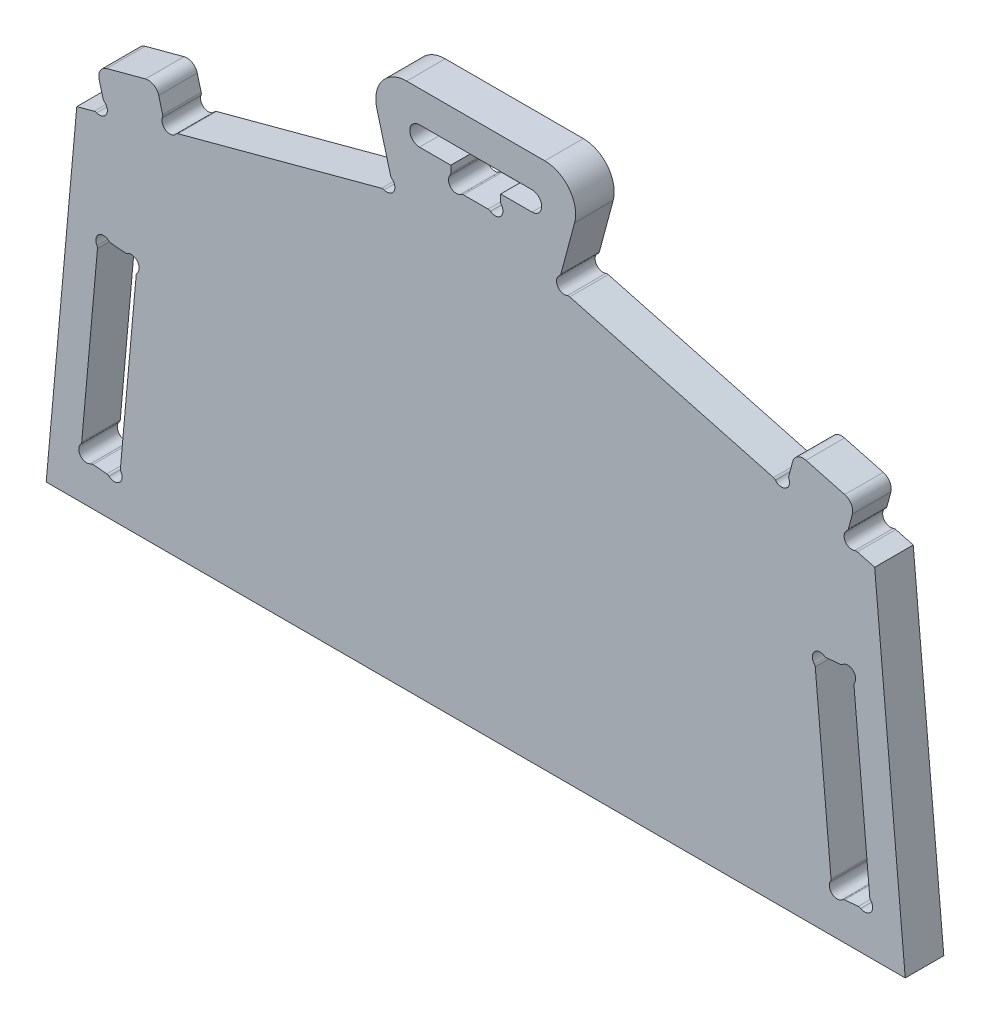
ISO-10303-21;
HEADER;
FILE_DESCRIPTION(('STEP AP214'),'2;1');
FILE_NAME('part.step','',(''),(''),'','','');
FILE_SCHEMA(('AUTOMOTIVE_DESIGN { 1 0 10303 214 1 1 1 1 }'));
ENDSEC;
DATA;
#1=APPLICATION_CONTEXT('core data for automotive mechanical design processes');
#2=APPLICATION_PROTOCOL_DEFINITION('international standard','automotive_design',2000,#1);
#3=PRODUCT_CONTEXT('',#1,'mechanical');
#4=PRODUCT('Part','Part','',(#3));
#5=PRODUCT_RELATED_PRODUCT_CATEGORY('part','',(#4));
#6=PRODUCT_DEFINITION_FORMATION('','',#4);
#7=PRODUCT_DEFINITION_CONTEXT('part definition',#1,'design');
#8=PRODUCT_DEFINITION('design','',#6,#7);
#9=PRODUCT_DEFINITION_SHAPE('','',#8);
#10=(LENGTH_UNIT() NAMED_UNIT(*) SI_UNIT(.MILLI.,.METRE.));
#11=(NAMED_UNIT(*) PLANE_ANGLE_UNIT() SI_UNIT($,.RADIAN.));
#12=(NAMED_UNIT(*) SI_UNIT($,.STERADIAN.) SOLID_ANGLE_UNIT());
#13=UNCERTAINTY_MEASURE_WITH_UNIT(LENGTH_MEASURE(1.E-05),#10,'distance_accuracy_value','');
#14=(GEOMETRIC_REPRESENTATION_CONTEXT(3) GLOBAL_UNCERTAINTY_ASSIGNED_CONTEXT((#13)) GLOBAL_UNIT_ASSIGNED_CONTEXT((#10,
#11,#12)) REPRESENTATION_CONTEXT('',''));
#15=CARTESIAN_POINT('',(0.,0.,0.));
#16=DIRECTION('',(0.,0.,1.));
#17=DIRECTION('',(1.,0.,0.));
#18=AXIS2_PLACEMENT_3D('',#15,#16,#17);
#19=CARTESIAN_POINT('',(31.7656382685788,221.332571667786,25.));
#20=DIRECTION('',(0.,0.,1.));
#21=DIRECTION('',(1.,0.,0.));
#22=AXIS2_PLACEMENT_3D('',#19,#20,#21);
#23=PLANE('',#22);
#24=DIRECTION('',(-1.,0.,0.));
#25=VECTOR('',#24,1.);
#26=CARTESIAN_POINT('',(278.5,0.,25.));
#27=LINE('',#26,#25);
#28=CARTESIAN_POINT('',(557.,1.060081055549E-13,25.));
#29=VERTEX_POINT('',#28);
#30=CARTESIAN_POINT('',(0.,0.,25.));
#31=VERTEX_POINT('',#30);
#32=EDGE_CURVE('E1028',#29,#31,#27,.T.);
#33=ORIENTED_EDGE('',*,*,#32,.F.);
#34=DIRECTION('',(-0.0894867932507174,0.99598800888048,0.));
#35=VECTOR('',#34,1.);
#36=CARTESIAN_POINT('',(557.,1.060081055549E-13,25.));
#37=LINE('',#36,#35);
#38=CARTESIAN_POINT('',(537.168645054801,220.722980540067,25.));
#39=VERTEX_POINT('',#38);
#40=EDGE_CURVE('E705',#29,#39,#37,.T.);
#41=ORIENTED_EDGE('',*,*,#40,.T.);
#42=DIRECTION('',(-0.965925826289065,0.258819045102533,0.));
#43=VECTOR('',#42,1.);
#44=CARTESIAN_POINT('',(537.168645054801,220.722980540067,25.));
#45=LINE('',#44,#43);
#46=CARTESIAN_POINT('',(525.881409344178,223.747386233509,25.));
#47=VERTEX_POINT('',#46);
#48=EDGE_CURVE('E708',#39,#47,#45,.T.);
#49=ORIENTED_EDGE('',*,*,#48,.T.);
#50=CARTESIAN_POINT('',(525.234361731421,221.332571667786,25.));
#51=DIRECTION('',(0.,0.,-1.));
#52=DIRECTION('',(-1.,0.,0.));
#53=AXIS2_PLACEMENT_3D('',#50,#51,#52);
#54=CIRCLE('',#53,2.50000000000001);
#55=CARTESIAN_POINT('',(524.31653122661,223.657993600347,25.));
#56=VERTEX_POINT('',#55);
#57=EDGE_CURVE('E712',#56,#47,#54,.T.);
#58=ORIENTED_EDGE('',*,*,#57,.F.);
#59=CARTESIAN_POINT('',(522.444156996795,228.401854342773,25.));
#60=DIRECTION('',(0.,0.,-1.));
#61=DIRECTION('',(-1.,0.,0.));
#62=AXIS2_PLACEMENT_3D('',#59,#60,#61);
#63=CIRCLE('',#62,5.10000000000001);
#64=CARTESIAN_POINT('',(519.272040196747,232.395308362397,25.));
#65=VERTEX_POINT('',#64);
#66=EDGE_CURVE('E715',#56,#65,#63,.T.);
#67=ORIENTED_EDGE('',*,*,#66,.T.);
#68=CARTESIAN_POINT('',(517.717080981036,234.352883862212,25.));
#69=DIRECTION('',(0.,0.,1.));
#70=DIRECTION('',(1.,0.,0.));
#71=AXIS2_PLACEMENT_3D('',#68,#69,#70);
#72=CIRCLE('',#71,2.50000000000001);
#73=CARTESIAN_POINT('',(520.131895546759,233.705836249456,25.));
#74=VERTEX_POINT('',#73);
#75=EDGE_CURVE('E718',#65,#74,#72,.T.);
#76=ORIENTED_EDGE('',*,*,#75,.T.);
#77=DIRECTION('',(-0.258819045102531,-0.965925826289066,0.));
#78=VECTOR('',#77,1.);
#79=CARTESIAN_POINT('',(524.497903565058,250.,25.));
#80=LINE('',#79,#78);
#81=CARTESIAN_POINT('',(522.68617024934,243.238519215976,25.));
#82=VERTEX_POINT('',#81);
#83=EDGE_CURVE('E721',#82,#74,#80,.T.);
#84=ORIENTED_EDGE('',*,*,#83,.F.);
#85=CARTESIAN_POINT('',(515.924689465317,245.050252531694,25.));
#86=DIRECTION('',(0.,0.,-1.));
#87=DIRECTION('',(-1.,0.,0.));
#88=AXIS2_PLACEMENT_3D('',#85,#86,#87);
#89=CIRCLE('',#88,7.);
#90=CARTESIAN_POINT('',(517.736422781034,251.811733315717,25.));
#91=VERTEX_POINT('',#90);
#92=EDGE_CURVE('E907',#91,#82,#89,.T.);
#93=ORIENTED_EDGE('',*,*,#92,.F.);
#94=DIRECTION('',(0.965925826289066,-0.25881904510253,0.));
#95=VECTOR('',#94,1.);
#96=CARTESIAN_POINT('',(485.860870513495,260.352761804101,25.));
#97=LINE('',#96,#95);
#98=CARTESIAN_POINT('',(492.622351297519,258.541028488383,25.));
#99=VERTEX_POINT('',#98);
#100=EDGE_CURVE('E724',#99,#91,#97,.T.);
#101=ORIENTED_EDGE('',*,*,#100,.F.);
#102=CARTESIAN_POINT('',(490.810617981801,251.77954770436,25.));
#103=DIRECTION('',(0.,0.,-1.));
#104=DIRECTION('',(-1.,0.,0.));
#105=AXIS2_PLACEMENT_3D('',#102,#103,#104);
#106=CIRCLE('',#105,7.);
#107=CARTESIAN_POINT('',(484.049137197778,253.591281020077,25.));
#108=VERTEX_POINT('',#107);
#109=EDGE_CURVE('E904',#108,#99,#106,.T.);
#110=ORIENTED_EDGE('',*,*,#109,.F.);
#111=DIRECTION('',(-0.25881904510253,-0.965925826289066,0.));
#112=VECTOR('',#111,1.);
#113=CARTESIAN_POINT('',(485.860870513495,260.352761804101,25.));
#114=LINE('',#113,#112);
#115=CARTESIAN_POINT('',(481.494862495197,244.058598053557,25.));
#116=VERTEX_POINT('',#115);
#117=EDGE_CURVE('E727',#108,#116,#114,.T.);
#118=ORIENTED_EDGE('',*,*,#117,.T.);
#119=CARTESIAN_POINT('',(483.909677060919,243.411550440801,25.));
#120=DIRECTION('',(0.,0.,-1.));
#121=DIRECTION('',(-1.,0.,0.));
#122=AXIS2_PLACEMENT_3D('',#119,#120,#121);
#123=CIRCLE('',#122,2.49999999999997);
#124=CARTESIAN_POINT('',(481.584255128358,242.49371993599,25.));
#125=VERTEX_POINT('',#124);
#126=EDGE_CURVE('E730',#125,#116,#123,.T.);
#127=ORIENTED_EDGE('',*,*,#126,.F.);
#128=CARTESIAN_POINT('',(476.840394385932,240.621345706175,25.));
#129=DIRECTION('',(0.,0.,-1.));
#130=DIRECTION('',(-1.,0.,0.));
#131=AXIS2_PLACEMENT_3D('',#128,#129,#130);
#132=CIRCLE('',#131,5.1);
#133=CARTESIAN_POINT('',(472.846940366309,237.449228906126,25.));
#134=VERTEX_POINT('',#133);
#135=EDGE_CURVE('E733',#125,#134,#132,.T.);
#136=ORIENTED_EDGE('',*,*,#135,.T.);
#137=CARTESIAN_POINT('',(470.889364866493,235.894269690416,25.));
#138=DIRECTION('',(0.,0.,1.));
#139=DIRECTION('',(1.,0.,0.));
#140=AXIS2_PLACEMENT_3D('',#137,#138,#139);
#141=CIRCLE('',#140,2.50000000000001);
#142=CARTESIAN_POINT('',(471.536412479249,238.309084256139,25.));
#143=VERTEX_POINT('',#142);
#144=EDGE_CURVE('E736',#134,#143,#141,.T.);
#145=ORIENTED_EDGE('',*,*,#144,.T.);
#146=DIRECTION('',(-0.965925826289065,0.258819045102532,0.));
#147=VECTOR('',#146,1.);
#148=CARTESIAN_POINT('',(471.536412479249,238.309084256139,25.));
#149=LINE('',#148,#147);
#150=CARTESIAN_POINT('',(339.457724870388,273.699461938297,25.));
#151=VERTEX_POINT('',#150);
#152=EDGE_CURVE('E739',#143,#151,#149,.T.);
#153=ORIENTED_EDGE('',*,*,#152,.T.);
#154=CARTESIAN_POINT('',(338.810677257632,271.284647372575,25.));
#155=DIRECTION('',(0.,0.,-1.));
#156=DIRECTION('',(-1.,0.,0.));
#157=AXIS2_PLACEMENT_3D('',#154,#155,#156);
#158=CIRCLE('',#157,2.50000000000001);
#159=CARTESIAN_POINT('',(337.89284675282,273.610069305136,25.));
#160=VERTEX_POINT('',#159);
#161=EDGE_CURVE('E742',#160,#151,#158,.T.);
#162=ORIENTED_EDGE('',*,*,#161,.F.);
#163=CARTESIAN_POINT('',(336.020472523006,278.353930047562,25.));
#164=DIRECTION('',(0.,0.,1.));
#165=DIRECTION('',(1.,0.,0.));
#166=AXIS2_PLACEMENT_3D('',#163,#164,#165);
#167=CIRCLE('',#166,5.09999999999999);
#168=CARTESIAN_POINT('',(332.848355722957,282.347384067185,25.));
#169=VERTEX_POINT('',#168);
#170=EDGE_CURVE('E745',#169,#160,#167,.T.);
#171=ORIENTED_EDGE('',*,*,#170,.F.);
#172=CARTESIAN_POINT('',(331.293396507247,284.304959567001,25.));
#173=DIRECTION('',(0.,0.,1.));
#174=DIRECTION('',(1.,0.,0.));
#175=AXIS2_PLACEMENT_3D('',#172,#173,#174);
#176=CIRCLE('',#175,2.49999999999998);
#177=CARTESIAN_POINT('',(333.70821107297,283.657911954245,25.));
#178=VERTEX_POINT('',#177);
#179=EDGE_CURVE('E748',#169,#178,#176,.T.);
#180=ORIENTED_EDGE('',*,*,#179,.T.);
#181=DIRECTION('',(0.258819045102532,0.965925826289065,0.));
#182=VECTOR('',#181,1.);
#183=CARTESIAN_POINT('',(333.708211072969,283.657911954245,25.));
#184=LINE('',#183,#182);
#185=CARTESIAN_POINT('',(342.594935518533,316.82361909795,25.));
#186=VERTEX_POINT('',#185);
#187=EDGE_CURVE('E751',#178,#186,#184,.T.);
#188=ORIENTED_EDGE('',*,*,#187,.T.);
#189=CARTESIAN_POINT('',(323.276418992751,322.,25.));
#190=DIRECTION('',(0.,0.,1.));
#191=DIRECTION('',(1.,0.,0.));
#192=AXIS2_PLACEMENT_3D('',#189,#190,#191);
#193=CIRCLE('',#192,20.);
#194=CARTESIAN_POINT('',(323.276418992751,342.,25.));
#195=VERTEX_POINT('',#194);
#196=EDGE_CURVE('E754',#186,#195,#193,.T.);
#197=ORIENTED_EDGE('',*,*,#196,.T.);
#198=DIRECTION('',(1.,0.,0.));
#199=VECTOR('',#198,1.);
#200=CARTESIAN_POINT('',(233.723581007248,342.,25.));
#201=LINE('',#200,#199);
#202=CARTESIAN_POINT('',(233.723581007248,342.,25.));
#203=VERTEX_POINT('',#202);
#204=EDGE_CURVE('E1077',#203,#195,#201,.T.);
#205=ORIENTED_EDGE('',*,*,#204,.F.);
#206=CARTESIAN_POINT('',(233.723581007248,322.,25.));
#207=DIRECTION('',(0.,0.,-1.));
#208=DIRECTION('',(-1.,0.,0.));
#209=AXIS2_PLACEMENT_3D('',#206,#207,#208);
#210=CIRCLE('',#209,20.);
#211=CARTESIAN_POINT('',(214.405064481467,316.82361909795,25.));
#212=VERTEX_POINT('',#211);
#213=EDGE_CURVE('E1074',#212,#203,#210,.T.);
#214=ORIENTED_EDGE('',*,*,#213,.F.);
#215=DIRECTION('',(-0.258819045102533,0.965925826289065,0.));
#216=VECTOR('',#215,1.);
#217=CARTESIAN_POINT('',(223.29178892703,283.657911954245,25.));
#218=LINE('',#217,#216);
#219=CARTESIAN_POINT('',(223.29178892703,283.657911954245,25.));
#220=VERTEX_POINT('',#219);
#221=EDGE_CURVE('E1071',#220,#212,#218,.T.);
#222=ORIENTED_EDGE('',*,*,#221,.F.);
#223=CARTESIAN_POINT('',(225.706603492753,284.304959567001,25.));
#224=DIRECTION('',(0.,0.,-1.));
#225=DIRECTION('',(-1.,0.,0.));
#226=AXIS2_PLACEMENT_3D('',#223,#224,#225);
#227=CIRCLE('',#226,2.49999999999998);
#228=CARTESIAN_POINT('',(224.151644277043,282.347384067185,25.));
#229=VERTEX_POINT('',#228);
#230=EDGE_CURVE('E1068',#229,#220,#227,.T.);
#231=ORIENTED_EDGE('',*,*,#230,.F.);
#232=CARTESIAN_POINT('',(220.979527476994,278.353930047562,25.));
#233=DIRECTION('',(0.,0.,-1.));
#234=DIRECTION('',(-1.,0.,0.));
#235=AXIS2_PLACEMENT_3D('',#232,#233,#234);
#236=CIRCLE('',#235,5.09999999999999);
#237=CARTESIAN_POINT('',(219.10715324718,273.610069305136,25.));
#238=VERTEX_POINT('',#237);
#239=EDGE_CURVE('E1066',#229,#238,#236,.T.);
#240=ORIENTED_EDGE('',*,*,#239,.T.);
#241=CARTESIAN_POINT('',(218.189322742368,271.284647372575,25.));
#242=DIRECTION('',(0.,0.,1.));
#243=DIRECTION('',(1.,0.,0.));
#244=AXIS2_PLACEMENT_3D('',#241,#242,#243);
#245=CIRCLE('',#244,2.50000000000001);
#246=CARTESIAN_POINT('',(217.542275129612,273.699461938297,25.));
#247=VERTEX_POINT('',#246);
#248=EDGE_CURVE('E1064',#238,#247,#245,.T.);
#249=ORIENTED_EDGE('',*,*,#248,.T.);
#250=DIRECTION('',(0.965925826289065,0.258819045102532,0.));
#251=VECTOR('',#250,1.);
#252=CARTESIAN_POINT('',(85.4635875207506,238.309084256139,25.));
#253=LINE('',#252,#251);
#254=CARTESIAN_POINT('',(85.4635875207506,238.309084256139,25.));
#255=VERTEX_POINT('',#254);
#256=EDGE_CURVE('E1061',#255,#247,#253,.T.);
#257=ORIENTED_EDGE('',*,*,#256,.F.);
#258=CARTESIAN_POINT('',(86.110635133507,235.894269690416,25.));
#259=DIRECTION('',(0.,0.,-1.));
#260=DIRECTION('',(-1.,0.,0.));
#261=AXIS2_PLACEMENT_3D('',#258,#259,#260);
#262=CIRCLE('',#261,2.50000000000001);
#263=CARTESIAN_POINT('',(84.1530596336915,237.449228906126,25.));
#264=VERTEX_POINT('',#263);
#265=EDGE_CURVE('E1058',#264,#255,#262,.T.);
#266=ORIENTED_EDGE('',*,*,#265,.F.);
#267=CARTESIAN_POINT('',(80.1596056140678,240.621345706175,25.));
#268=DIRECTION('',(0.,0.,1.));
#269=DIRECTION('',(1.,0.,0.));
#270=AXIS2_PLACEMENT_3D('',#267,#268,#269);
#271=CIRCLE('',#270,5.1);
#272=CARTESIAN_POINT('',(75.4157448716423,242.49371993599,25.));
#273=VERTEX_POINT('',#272);
#274=EDGE_CURVE('E1055',#273,#264,#271,.T.);
#275=ORIENTED_EDGE('',*,*,#274,.F.);
#276=CARTESIAN_POINT('',(73.0903229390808,243.411550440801,25.));
#277=DIRECTION('',(0.,0.,1.));
#278=DIRECTION('',(1.,0.,0.));
#279=AXIS2_PLACEMENT_3D('',#276,#277,#278);
#280=CIRCLE('',#279,2.49999999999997);
#281=CARTESIAN_POINT('',(75.5051375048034,244.058598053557,25.));
#282=VERTEX_POINT('',#281);
#283=EDGE_CURVE('E1052',#273,#282,#280,.T.);
#284=ORIENTED_EDGE('',*,*,#283,.T.);
#285=DIRECTION('',(0.25881904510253,-0.965925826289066,0.));
#286=VECTOR('',#285,1.);
#287=CARTESIAN_POINT('',(71.1391294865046,260.352761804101,25.));
#288=LINE('',#287,#286);
#289=CARTESIAN_POINT('',(72.9508628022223,253.591281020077,25.));
#290=VERTEX_POINT('',#289);
#291=EDGE_CURVE('E1050',#290,#282,#288,.T.);
#292=ORIENTED_EDGE('',*,*,#291,.F.);
#293=CARTESIAN_POINT('',(66.1893820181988,251.77954770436,25.));
#294=DIRECTION('',(0.,0.,1.));
#295=DIRECTION('',(1.,0.,0.));
#296=AXIS2_PLACEMENT_3D('',#293,#294,#295);
#297=CIRCLE('',#296,7.);
#298=CARTESIAN_POINT('',(64.3776487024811,258.541028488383,25.));
#299=VERTEX_POINT('',#298);
#300=EDGE_CURVE('E1234',#290,#299,#297,.T.);
#301=ORIENTED_EDGE('',*,*,#300,.T.);
#302=DIRECTION('',(-0.965925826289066,-0.258819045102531,0.));
#303=VECTOR('',#302,1.);
#304=CARTESIAN_POINT('',(71.1391294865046,260.352761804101,25.));
#305=LINE('',#304,#303);
#306=CARTESIAN_POINT('',(39.2635772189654,251.811733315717,25.));
#307=VERTEX_POINT('',#306);
#308=EDGE_CURVE('E1048',#299,#307,#305,.T.);
#309=ORIENTED_EDGE('',*,*,#308,.T.);
#310=CARTESIAN_POINT('',(41.0753105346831,245.050252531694,25.));
#311=DIRECTION('',(0.,0.,1.));
#312=DIRECTION('',(1.,0.,0.));
#313=AXIS2_PLACEMENT_3D('',#310,#311,#312);
#314=CIRCLE('',#313,7.);
#315=CARTESIAN_POINT('',(34.3138297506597,243.238519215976,25.));
#316=VERTEX_POINT('',#315);
#317=EDGE_CURVE('E41',#307,#316,#314,.T.);
#318=ORIENTED_EDGE('',*,*,#317,.T.);
#319=DIRECTION('',(0.258819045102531,-0.965925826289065,0.));
#320=VECTOR('',#319,1.);
#321=CARTESIAN_POINT('',(32.502096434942,249.999999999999,25.));
#322=LINE('',#321,#320);
#323=CARTESIAN_POINT('',(36.8681044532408,233.705836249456,25.));
#324=VERTEX_POINT('',#323);
#325=EDGE_CURVE('E1046',#316,#324,#322,.T.);
#326=ORIENTED_EDGE('',*,*,#325,.T.);
#327=CARTESIAN_POINT('',(39.2829190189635,234.352883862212,25.));
#328=DIRECTION('',(0.,0.,-1.));
#329=DIRECTION('',(-1.,0.,0.));
#330=AXIS2_PLACEMENT_3D('',#327,#328,#329);
#331=CIRCLE('',#330,2.50000000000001);
#332=CARTESIAN_POINT('',(37.7279598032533,232.395308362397,25.));
#333=VERTEX_POINT('',#332);
#334=EDGE_CURVE('E1043',#333,#324,#331,.T.);
#335=ORIENTED_EDGE('',*,*,#334,.F.);
#336=CARTESIAN_POINT('',(34.5558430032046,228.401854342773,25.));
#337=DIRECTION('',(0.,0.,1.));
#338=DIRECTION('',(1.,0.,0.));
#339=AXIS2_PLACEMENT_3D('',#336,#337,#338);
#340=CIRCLE('',#339,5.10000000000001);
#341=CARTESIAN_POINT('',(32.6834687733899,223.657993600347,25.));
#342=VERTEX_POINT('',#341);
#343=EDGE_CURVE('E1040',#342,#333,#340,.T.);
#344=ORIENTED_EDGE('',*,*,#343,.F.);
#345=CARTESIAN_POINT('',(31.7656382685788,221.332571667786,25.));
#346=DIRECTION('',(0.,0.,1.));
#347=DIRECTION('',(1.,0.,0.));
#348=AXIS2_PLACEMENT_3D('',#345,#346,#347);
#349=CIRCLE('',#348,2.50000000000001);
#350=CARTESIAN_POINT('',(31.1185906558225,223.747386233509,25.));
#351=VERTEX_POINT('',#350);
#352=EDGE_CURVE('E1038',#342,#351,#349,.T.);
#353=ORIENTED_EDGE('',*,*,#352,.T.);
#354=DIRECTION('',(0.965925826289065,0.258819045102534,0.));
#355=VECTOR('',#354,1.);
#356=CARTESIAN_POINT('',(19.8313549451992,220.722980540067,25.));
#357=LINE('',#356,#355);
#358=CARTESIAN_POINT('',(19.8313549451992,220.722980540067,25.));
#359=VERTEX_POINT('',#358);
#360=EDGE_CURVE('E1035',#359,#351,#357,.T.);
#361=ORIENTED_EDGE('',*,*,#360,.F.);
#362=DIRECTION('',(0.089486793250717,0.99598800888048,0.));
#363=VECTOR('',#362,1.);
#364=CARTESIAN_POINT('',(0.,0.,25.));
#365=LINE('',#364,#363);
#366=EDGE_CURVE('E1031',#31,#359,#365,.T.);
#367=ORIENTED_EDGE('',*,*,#366,.F.);
#368=EDGE_LOOP('',(#33,#41,#49,#58,#67,#76,#84,#93,#101,#110,#118,#127,#136,#145,#153,#162,#171,
#180,#188,#197,#205,#214,#222,#231,#240,#249,#257,#266,#275,#284,#292,#301,#309,#318,#326,#335,
#344,#353,#361,#367));
#369=FACE_BOUND('',#368,.T.);
#370=CARTESIAN_POINT('',(286.544248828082,294.025447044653,25.));
#371=DIRECTION('',(0.,0.,1.));
#372=DIRECTION('',(1.,0.,0.));
#373=AXIS2_PLACEMENT_3D('',#370,#371,#372);
#374=CIRCLE('',#373,2.5);
#375=CARTESIAN_POINT('',(288.032668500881,296.034080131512,25.));
#376=VERTEX_POINT('',#375);
#377=CARTESIAN_POINT('',(286.544248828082,296.525447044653,25.));
#378=VERTEX_POINT('',#377);
#379=EDGE_CURVE('E772',#376,#378,#374,.T.);
#380=ORIENTED_EDGE('',*,*,#379,.T.);
#381=DIRECTION('',(1.,0.,0.));
#382=VECTOR('',#381,1.);
#383=CARTESIAN_POINT('',(270.455751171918,296.525447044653,25.));
#384=LINE('',#383,#382);
#385=CARTESIAN_POINT('',(270.455751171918,296.525447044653,25.));
#386=VERTEX_POINT('',#385);
#387=EDGE_CURVE('E1099',#386,#378,#384,.T.);
#388=ORIENTED_EDGE('',*,*,#387,.F.);
#389=CARTESIAN_POINT('',(270.455751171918,294.025447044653,25.));
#390=DIRECTION('',(0.,0.,-1.));
#391=DIRECTION('',(-1.,0.,0.));
#392=AXIS2_PLACEMENT_3D('',#389,#390,#391);
#393=CIRCLE('',#392,2.5);
#394=CARTESIAN_POINT('',(268.967331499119,296.034080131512,25.));
#395=VERTEX_POINT('',#394);
#396=EDGE_CURVE('E1096',#395,#386,#393,.T.);
#397=ORIENTED_EDGE('',*,*,#396,.F.);
#398=CARTESIAN_POINT('',(265.930955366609,300.131691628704,25.));
#399=DIRECTION('',(0.,0.,1.));
#400=DIRECTION('',(1.,0.,0.));
#401=AXIS2_PLACEMENT_3D('',#398,#399,#400);
#402=CIRCLE('',#401,5.1);
#403=CARTESIAN_POINT('',(261.833343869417,303.168067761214,25.));
#404=VERTEX_POINT('',#403);
#405=EDGE_CURVE('E1093',#404,#395,#402,.T.);
#406=ORIENTED_EDGE('',*,*,#405,.F.);
#407=CARTESIAN_POINT('',(259.824710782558,304.656487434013,25.));
#408=DIRECTION('',(0.,0.,1.));
#409=DIRECTION('',(1.,0.,0.));
#410=AXIS2_PLACEMENT_3D('',#407,#408,#409);
#411=CIRCLE('',#410,2.50000000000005);
#412=CARTESIAN_POINT('',(262.324710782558,304.656487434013,25.));
#413=VERTEX_POINT('',#412);
#414=EDGE_CURVE('E1091',#404,#413,#411,.T.);
#415=ORIENTED_EDGE('',*,*,#414,.T.);
#416=DIRECTION('',(0.,-1.,0.));
#417=VECTOR('',#416,1.);
#418=CARTESIAN_POINT('',(262.324710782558,309.075447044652,25.));
#419=LINE('',#418,#417);
#420=CARTESIAN_POINT('',(262.324710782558,309.075447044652,25.));
#421=VERTEX_POINT('',#420);
#422=EDGE_CURVE('E1088',#421,#413,#419,.T.);
#423=ORIENTED_EDGE('',*,*,#422,.F.);
#424=DIRECTION('',(1.,0.,0.));
#425=VECTOR('',#424,1.);
#426=CARTESIAN_POINT('',(242.001681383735,309.075447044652,25.));
#427=LINE('',#426,#425);
#428=CARTESIAN_POINT('',(242.001681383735,309.075447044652,25.));
#429=VERTEX_POINT('',#428);
#430=EDGE_CURVE('E1085',#429,#421,#427,.T.);
#431=ORIENTED_EDGE('',*,*,#430,.F.);
#432=CARTESIAN_POINT('',(242.001681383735,315.350447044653,25.));
#433=DIRECTION('',(0.,0.,1.));
#434=DIRECTION('',(1.,0.,0.));
#435=AXIS2_PLACEMENT_3D('',#432,#433,#434);
#436=CIRCLE('',#435,6.275);
#437=CARTESIAN_POINT('',(242.001681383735,321.625447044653,25.));
#438=VERTEX_POINT('',#437);
#439=EDGE_CURVE('E1082',#438,#429,#436,.T.);
#440=ORIENTED_EDGE('',*,*,#439,.F.);
#441=DIRECTION('',(-1.,0.,0.));
#442=VECTOR('',#441,1.);
#443=CARTESIAN_POINT('',(278.5,321.625447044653,25.));
#444=LINE('',#443,#442);
#445=CARTESIAN_POINT('',(314.998318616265,321.625447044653,25.));
#446=VERTEX_POINT('',#445);
#447=EDGE_CURVE('E1079',#446,#438,#444,.T.);
#448=ORIENTED_EDGE('',*,*,#447,.F.);
#449=CARTESIAN_POINT('',(314.998318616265,315.350447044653,25.));
#450=DIRECTION('',(0.,0.,-1.));
#451=DIRECTION('',(-1.,0.,0.));
#452=AXIS2_PLACEMENT_3D('',#449,#450,#451);
#453=CIRCLE('',#452,6.275);
#454=CARTESIAN_POINT('',(314.998318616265,309.075447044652,25.));
#455=VERTEX_POINT('',#454);
#456=EDGE_CURVE('E757',#446,#455,#453,.T.);
#457=ORIENTED_EDGE('',*,*,#456,.T.);
#458=DIRECTION('',(-1.,0.,0.));
#459=VECTOR('',#458,1.);
#460=CARTESIAN_POINT('',(314.998318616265,309.075447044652,25.));
#461=LINE('',#460,#459);
#462=CARTESIAN_POINT('',(294.675289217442,309.075447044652,25.));
#463=VERTEX_POINT('',#462);
#464=EDGE_CURVE('E760',#455,#463,#461,.T.);
#465=ORIENTED_EDGE('',*,*,#464,.T.);
#466=DIRECTION('',(0.,-1.,0.));
#467=VECTOR('',#466,1.);
#468=CARTESIAN_POINT('',(294.675289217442,309.075447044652,25.));
#469=LINE('',#468,#467);
#470=CARTESIAN_POINT('',(294.675289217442,304.656487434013,25.));
#471=VERTEX_POINT('',#470);
#472=EDGE_CURVE('E763',#463,#471,#469,.T.);
#473=ORIENTED_EDGE('',*,*,#472,.T.);
#474=CARTESIAN_POINT('',(297.175289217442,304.656487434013,25.));
#475=DIRECTION('',(0.,0.,-1.));
#476=DIRECTION('',(-1.,0.,0.));
#477=AXIS2_PLACEMENT_3D('',#474,#475,#476);
#478=CIRCLE('',#477,2.50000000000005);
#479=CARTESIAN_POINT('',(295.166656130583,303.168067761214,25.));
#480=VERTEX_POINT('',#479);
#481=EDGE_CURVE('E766',#480,#471,#478,.T.);
#482=ORIENTED_EDGE('',*,*,#481,.F.);
#483=CARTESIAN_POINT('',(291.069044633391,300.131691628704,25.));
#484=DIRECTION('',(0.,0.,-1.));
#485=DIRECTION('',(-1.,0.,0.));
#486=AXIS2_PLACEMENT_3D('',#483,#484,#485);
#487=CIRCLE('',#486,5.1);
#488=EDGE_CURVE('E769',#480,#376,#487,.T.);
#489=ORIENTED_EDGE('',*,*,#488,.T.);
#490=EDGE_LOOP('',(#380,#388,#397,#406,#415,#423,#431,#440,#448,#457,#465,#473,#482,#489));
#491=FACE_BOUND('',#490,.T.);
#492=CARTESIAN_POINT('',(26.2084702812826,29.0219087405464,25.));
#493=DIRECTION('',(0.,0.,1.));
#494=DIRECTION('',(1.,0.,0.));
#495=AXIS2_PLACEMENT_3D('',#492,#493,#494);
#496=CIRCLE('',#495,5.1);
#497=CARTESIAN_POINT('',(22.3990139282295,32.4127850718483,25.));
#498=VERTEX_POINT('',#497);
#499=CARTESIAN_POINT('',(28.8659823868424,24.6690212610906,25.));
#500=VERTEX_POINT('',#499);
#501=EDGE_CURVE('E915',#498,#500,#496,.T.);
#502=ORIENTED_EDGE('',*,*,#501,.F.);
#503=CARTESIAN_POINT('',(20.5316333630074,34.0749793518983,25.));
#504=DIRECTION('',(0.,0.,-1.));
#505=DIRECTION('',(1.,0.,0.));
#506=AXIS2_PLACEMENT_3D('',#503,#504,#505);
#507=CIRCLE('',#506,2.5);
#508=CARTESIAN_POINT('',(23.0216033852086,33.8512623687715,25.));
#509=VERTEX_POINT('',#508);
#510=EDGE_CURVE('E913',#509,#498,#507,.T.);
#511=ORIENTED_EDGE('',*,*,#510,.F.);
#512=DIRECTION('',(-0.0894867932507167,-0.99598800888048,0.));
#513=VECTOR('',#512,1.);
#514=CARTESIAN_POINT('',(33.2533371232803,147.73045887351,25.));
#515=LINE('',#514,#513);
#516=CARTESIAN_POINT('',(33.2533371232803,147.73045887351,25.));
#517=VERTEX_POINT('',#516);
#518=EDGE_CURVE('E945',#517,#509,#515,.T.);
#519=ORIENTED_EDGE('',*,*,#518,.F.);
#520=CARTESIAN_POINT('',(30.7633671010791,147.954175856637,25.));
#521=DIRECTION('',(0.,0.,-1.));
#522=DIRECTION('',(-1.,0.,0.));
#523=AXIS2_PLACEMENT_3D('',#520,#521,#522);
#524=CIRCLE('',#523,2.49999999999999);
#525=CARTESIAN_POINT('',(32.8971354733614,149.256877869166,25.));
#526=VERTEX_POINT('',#525);
#527=EDGE_CURVE('E942',#526,#517,#524,.T.);
#528=ORIENTED_EDGE('',*,*,#527,.F.);
#529=CARTESIAN_POINT('',(37.2500229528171,151.914389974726,25.));
#530=DIRECTION('',(0.,0.,1.));
#531=DIRECTION('',(-1.,0.,0.));
#532=AXIS2_PLACEMENT_3D('',#529,#530,#531);
#533=CIRCLE('',#532,5.09999999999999);
#534=CARTESIAN_POINT('',(40.640899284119,155.723846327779,25.));
#535=VERTEX_POINT('',#534);
#536=EDGE_CURVE('E940',#535,#526,#533,.T.);
#537=ORIENTED_EDGE('',*,*,#536,.F.);
#538=CARTESIAN_POINT('',(42.303093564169,157.591226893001,25.));
#539=DIRECTION('',(0.,0.,-1.));
#540=DIRECTION('',(1.,0.,0.));
#541=AXIS2_PLACEMENT_3D('',#538,#539,#540);
#542=CIRCLE('',#541,2.50000000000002);
#543=CARTESIAN_POINT('',(42.0793765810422,155.1012568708,25.));
#544=VERTEX_POINT('',#543);
#545=EDGE_CURVE('E938',#544,#535,#542,.T.);
#546=ORIENTED_EDGE('',*,*,#545,.F.);
#547=DIRECTION('',(-0.99598800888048,0.0894867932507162,0.));
#548=VECTOR('',#547,1.);
#549=CARTESIAN_POINT('',(42.0793765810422,155.1012568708,25.));
#550=LINE('',#549,#548);
#551=CARTESIAN_POINT('',(50.9814369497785,154.301431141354,25.));
#552=VERTEX_POINT('',#551);
#553=EDGE_CURVE('E936',#552,#544,#550,.T.);
#554=ORIENTED_EDGE('',*,*,#553,.F.);
#555=CARTESIAN_POINT('',(51.2051539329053,156.791401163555,25.));
#556=DIRECTION('',(0.,0.,-1.));
#557=DIRECTION('',(-1.,0.,0.));
#558=AXIS2_PLACEMENT_3D('',#555,#556,#557);
#559=CIRCLE('',#558,2.50000000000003);
#560=CARTESIAN_POINT('',(52.5078559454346,154.657632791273,25.));
#561=VERTEX_POINT('',#560);
#562=EDGE_CURVE('E934',#561,#552,#559,.T.);
#563=ORIENTED_EDGE('',*,*,#562,.F.);
#564=CARTESIAN_POINT('',(55.1653680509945,150.304745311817,25.));
#565=DIRECTION('',(0.,0.,1.));
#566=DIRECTION('',(1.,0.,0.));
#567=AXIS2_PLACEMENT_3D('',#564,#565,#566);
#568=CIRCLE('',#567,5.09999999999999);
#569=CARTESIAN_POINT('',(58.9748244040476,146.913868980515,25.));
#570=VERTEX_POINT('',#569);
#571=EDGE_CURVE('E932',#570,#561,#568,.T.);
#572=ORIENTED_EDGE('',*,*,#571,.F.);
#573=CARTESIAN_POINT('',(60.8422049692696,145.251674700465,25.));
#574=DIRECTION('',(0.,0.,-1.));
#575=DIRECTION('',(1.,0.,0.));
#576=AXIS2_PLACEMENT_3D('',#573,#574,#575);
#577=CIRCLE('',#576,2.49999999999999);
#578=CARTESIAN_POINT('',(58.3522349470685,145.475391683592,25.));
#579=VERTEX_POINT('',#578);
#580=EDGE_CURVE('E930',#579,#570,#577,.T.);
#581=ORIENTED_EDGE('',*,*,#580,.F.);
#582=DIRECTION('',(0.0894867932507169,0.99598800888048,0.));
#583=VECTOR('',#582,1.);
#584=CARTESIAN_POINT('',(58.3522349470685,145.475391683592,25.));
#585=LINE('',#584,#583);
#586=CARTESIAN_POINT('',(48.1205012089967,31.5961951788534,25.));
#587=VERTEX_POINT('',#586);
#588=EDGE_CURVE('E928',#587,#579,#585,.T.);
#589=ORIENTED_EDGE('',*,*,#588,.F.);
#590=CARTESIAN_POINT('',(50.6104712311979,31.3724781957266,25.));
#591=DIRECTION('',(0.,0.,-1.));
#592=DIRECTION('',(-1.,0.,0.));
#593=AXIS2_PLACEMENT_3D('',#590,#591,#592);
#594=CIRCLE('',#593,2.49999999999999);
#595=CARTESIAN_POINT('',(48.4767028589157,30.0697761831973,25.));
#596=VERTEX_POINT('',#595);
#597=EDGE_CURVE('E926',#596,#587,#594,.T.);
#598=ORIENTED_EDGE('',*,*,#597,.F.);
#599=CARTESIAN_POINT('',(44.1238153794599,27.4122640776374,25.));
#600=DIRECTION('',(0.,0.,1.));
#601=DIRECTION('',(-1.,0.,0.));
#602=AXIS2_PLACEMENT_3D('',#599,#600,#601);
#603=CIRCLE('',#602,5.1);
#604=CARTESIAN_POINT('',(40.732939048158,23.6028077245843,25.));
#605=VERTEX_POINT('',#604);
#606=EDGE_CURVE('E924',#605,#596,#603,.T.);
#607=ORIENTED_EDGE('',*,*,#606,.F.);
#608=CARTESIAN_POINT('',(39.0707447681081,21.7354271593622,25.));
#609=DIRECTION('',(0.,0.,-1.));
#610=DIRECTION('',(1.,0.,0.));
#611=AXIS2_PLACEMENT_3D('',#608,#609,#610);
#612=CIRCLE('',#611,2.5);
#613=CARTESIAN_POINT('',(39.2944617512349,24.2253971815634,25.));
#614=VERTEX_POINT('',#613);
#615=EDGE_CURVE('E922',#614,#605,#612,.T.);
#616=ORIENTED_EDGE('',*,*,#615,.F.);
#617=DIRECTION('',(0.99598800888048,-0.0894867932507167,0.));
#618=VECTOR('',#617,1.);
#619=CARTESIAN_POINT('',(30.3924013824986,25.0252229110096,25.));
#620=LINE('',#619,#618);
#621=CARTESIAN_POINT('',(30.3924013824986,25.0252229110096,25.));
#622=VERTEX_POINT('',#621);
#623=EDGE_CURVE('E920',#622,#614,#620,.T.);
#624=ORIENTED_EDGE('',*,*,#623,.F.);
#625=CARTESIAN_POINT('',(30.1686843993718,22.5352528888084,25.));
#626=DIRECTION('',(0.,0.,-1.));
#627=DIRECTION('',(-1.,0.,0.));
#628=AXIS2_PLACEMENT_3D('',#625,#626,#627);
#629=CIRCLE('',#628,2.5);
#630=EDGE_CURVE('E918',#500,#622,#629,.T.);
#631=ORIENTED_EDGE('',*,*,#630,.F.);
#632=EDGE_LOOP('',(#502,#511,#519,#528,#537,#546,#554,#563,#572,#581,#589,#598,#607,#616,#624,#631));
#633=FACE_BOUND('',#632,.T.);
#634=CARTESIAN_POINT('',(530.791529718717,29.0219087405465,25.));
#635=DIRECTION('',(0.,0.,-1.));
#636=DIRECTION('',(-1.,0.,0.));
#637=AXIS2_PLACEMENT_3D('',#634,#635,#636);
#638=CIRCLE('',#637,5.1);
#639=CARTESIAN_POINT('',(534.600986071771,32.4127850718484,25.));
#640=VERTEX_POINT('',#639);
#641=CARTESIAN_POINT('',(528.134017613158,24.6690212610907,25.));
#642=VERTEX_POINT('',#641);
#643=EDGE_CURVE('E584',#640,#642,#638,.T.);
#644=ORIENTED_EDGE('',*,*,#643,.T.);
#645=CARTESIAN_POINT('',(526.831315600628,22.5352528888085,25.));
#646=DIRECTION('',(0.,0.,1.));
#647=DIRECTION('',(1.,0.,0.));
#648=AXIS2_PLACEMENT_3D('',#645,#646,#647);
#649=CIRCLE('',#648,2.5);
#650=CARTESIAN_POINT('',(526.607598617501,25.0252229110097,25.));
#651=VERTEX_POINT('',#650);
#652=EDGE_CURVE('E592',#642,#651,#649,.T.);
#653=ORIENTED_EDGE('',*,*,#652,.T.);
#654=DIRECTION('',(-0.99598800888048,-0.0894867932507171,0.));
#655=VECTOR('',#654,1.);
#656=CARTESIAN_POINT('',(526.607598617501,25.0252229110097,25.));
#657=LINE('',#656,#655);
#658=CARTESIAN_POINT('',(517.705538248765,24.2253971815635,25.));
#659=VERTEX_POINT('',#658);
#660=EDGE_CURVE('E594',#651,#659,#657,.T.);
#661=ORIENTED_EDGE('',*,*,#660,.T.);
#662=CARTESIAN_POINT('',(517.929255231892,21.7354271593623,25.));
#663=DIRECTION('',(0.,0.,1.));
#664=DIRECTION('',(-1.,0.,0.));
#665=AXIS2_PLACEMENT_3D('',#662,#663,#664);
#666=CIRCLE('',#665,2.5);
#667=CARTESIAN_POINT('',(516.267060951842,23.6028077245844,25.));
#668=VERTEX_POINT('',#667);
#669=EDGE_CURVE('E599',#659,#668,#666,.T.);
#670=ORIENTED_EDGE('',*,*,#669,.T.);
#671=CARTESIAN_POINT('',(512.87618462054,27.4122640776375,25.));
#672=DIRECTION('',(0.,0.,-1.));
#673=DIRECTION('',(1.,0.,0.));
#674=AXIS2_PLACEMENT_3D('',#671,#672,#673);
#675=CIRCLE('',#674,5.1);
#676=CARTESIAN_POINT('',(508.523297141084,30.0697761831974,25.));
#677=VERTEX_POINT('',#676);
#678=EDGE_CURVE('E602',#668,#677,#675,.T.);
#679=ORIENTED_EDGE('',*,*,#678,.T.);
#680=CARTESIAN_POINT('',(506.389528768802,31.3724781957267,25.));
#681=DIRECTION('',(0.,0.,1.));
#682=DIRECTION('',(1.,0.,0.));
#683=AXIS2_PLACEMENT_3D('',#680,#681,#682);
#684=CIRCLE('',#683,2.49999999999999);
#685=CARTESIAN_POINT('',(508.879498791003,31.5961951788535,25.));
#686=VERTEX_POINT('',#685);
#687=EDGE_CURVE('E605',#677,#686,#684,.T.);
#688=ORIENTED_EDGE('',*,*,#687,.T.);
#689=DIRECTION('',(-0.0894867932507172,0.99598800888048,0.));
#690=VECTOR('',#689,1.);
#691=CARTESIAN_POINT('',(498.647765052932,145.475391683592,25.));
#692=LINE('',#691,#690);
#693=CARTESIAN_POINT('',(498.647765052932,145.475391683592,25.));
#694=VERTEX_POINT('',#693);
#695=EDGE_CURVE('E608',#686,#694,#692,.T.);
#696=ORIENTED_EDGE('',*,*,#695,.T.);
#697=CARTESIAN_POINT('',(496.15779503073,145.251674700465,25.));
#698=DIRECTION('',(0.,0.,1.));
#699=DIRECTION('',(-1.,0.,0.));
#700=AXIS2_PLACEMENT_3D('',#697,#698,#699);
#701=CIRCLE('',#700,2.49999999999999);
#702=CARTESIAN_POINT('',(498.025175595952,146.913868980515,25.));
#703=VERTEX_POINT('',#702);
#704=EDGE_CURVE('E611',#694,#703,#701,.T.);
#705=ORIENTED_EDGE('',*,*,#704,.T.);
#706=CARTESIAN_POINT('',(501.834631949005,150.304745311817,25.));
#707=DIRECTION('',(0.,0.,-1.));
#708=DIRECTION('',(-1.,0.,0.));
#709=AXIS2_PLACEMENT_3D('',#706,#707,#708);
#710=CIRCLE('',#709,5.09999999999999);
#711=CARTESIAN_POINT('',(504.492144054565,154.657632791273,25.));
#712=VERTEX_POINT('',#711);
#713=EDGE_CURVE('E614',#703,#712,#710,.T.);
#714=ORIENTED_EDGE('',*,*,#713,.T.);
#715=CARTESIAN_POINT('',(505.794846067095,156.791401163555,25.));
#716=DIRECTION('',(0.,0.,1.));
#717=DIRECTION('',(1.,0.,0.));
#718=AXIS2_PLACEMENT_3D('',#715,#716,#717);
#719=CIRCLE('',#718,2.50000000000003);
#720=CARTESIAN_POINT('',(506.018563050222,154.301431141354,25.));
#721=VERTEX_POINT('',#720);
#722=EDGE_CURVE('E617',#712,#721,#719,.T.);
#723=ORIENTED_EDGE('',*,*,#722,.T.);
#724=DIRECTION('',(0.99598800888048,0.0894867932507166,0.));
#725=VECTOR('',#724,1.);
#726=CARTESIAN_POINT('',(514.920623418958,155.1012568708,25.));
#727=LINE('',#726,#725);
#728=CARTESIAN_POINT('',(514.920623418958,155.1012568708,25.));
#729=VERTEX_POINT('',#728);
#730=EDGE_CURVE('E620',#721,#729,#727,.T.);
#731=ORIENTED_EDGE('',*,*,#730,.T.);
#732=CARTESIAN_POINT('',(514.696906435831,157.591226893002,25.));
#733=DIRECTION('',(0.,0.,1.));
#734=DIRECTION('',(-1.,0.,0.));
#735=AXIS2_PLACEMENT_3D('',#732,#733,#734);
#736=CIRCLE('',#735,2.50000000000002);
#737=CARTESIAN_POINT('',(516.359100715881,155.723846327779,25.));
#738=VERTEX_POINT('',#737);
#739=EDGE_CURVE('E623',#729,#738,#736,.T.);
#740=ORIENTED_EDGE('',*,*,#739,.T.);
#741=CARTESIAN_POINT('',(519.749977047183,151.914389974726,25.));
#742=DIRECTION('',(0.,0.,-1.));
#743=DIRECTION('',(1.,0.,0.));
#744=AXIS2_PLACEMENT_3D('',#741,#742,#743);
#745=CIRCLE('',#744,5.09999999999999);
#746=CARTESIAN_POINT('',(524.102864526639,149.256877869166,25.));
#747=VERTEX_POINT('',#746);
#748=EDGE_CURVE('E626',#738,#747,#745,.T.);
#749=ORIENTED_EDGE('',*,*,#748,.T.);
#750=CARTESIAN_POINT('',(526.236632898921,147.954175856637,25.));
#751=DIRECTION('',(0.,0.,1.));
#752=DIRECTION('',(1.,0.,0.));
#753=AXIS2_PLACEMENT_3D('',#750,#751,#752);
#754=CIRCLE('',#753,2.49999999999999);
#755=CARTESIAN_POINT('',(523.74666287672,147.73045887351,25.));
#756=VERTEX_POINT('',#755);
#757=EDGE_CURVE('E629',#747,#756,#754,.T.);
#758=ORIENTED_EDGE('',*,*,#757,.T.);
#759=DIRECTION('',(0.0894867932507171,-0.99598800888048,0.));
#760=VECTOR('',#759,1.);
#761=CARTESIAN_POINT('',(523.74666287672,147.73045887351,25.));
#762=LINE('',#761,#760);
#763=CARTESIAN_POINT('',(533.978396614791,33.8512623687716,25.));
#764=VERTEX_POINT('',#763);
#765=EDGE_CURVE('E587',#756,#764,#762,.T.);
#766=ORIENTED_EDGE('',*,*,#765,.T.);
#767=CARTESIAN_POINT('',(536.468366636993,34.0749793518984,25.));
#768=DIRECTION('',(0.,0.,1.));
#769=DIRECTION('',(-1.,0.,0.));
#770=AXIS2_PLACEMENT_3D('',#767,#768,#769);
#771=CIRCLE('',#770,2.5);
#772=EDGE_CURVE('E570',#764,#640,#771,.T.);
#773=ORIENTED_EDGE('',*,*,#772,.T.);
#774=EDGE_LOOP('',(#644,#653,#661,#670,#679,#688,#696,#705,#714,#723,#731,#740,#749,#758,#766,#773));
#775=FACE_BOUND('',#774,.T.);
#776=ADVANCED_FACE('F33',(#369,#491,#633,#775),#23,.T.);
#777=CARTESIAN_POINT('',(31.7656382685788,221.332571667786,0.));
#778=DIRECTION('',(0.,0.,1.));
#779=DIRECTION('',(1.,0.,0.));
#780=AXIS2_PLACEMENT_3D('',#777,#778,#779);
#781=PLANE('',#780);
#782=DIRECTION('',(-0.0894867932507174,0.99598800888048,0.));
#783=VECTOR('',#782,1.);
#784=CARTESIAN_POINT('',(557.,1.060081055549E-13,0.));
#785=LINE('',#784,#783);
#786=CARTESIAN_POINT('',(557.,1.060081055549E-13,0.));
#787=VERTEX_POINT('',#786);
#788=CARTESIAN_POINT('',(537.168645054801,220.722980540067,0.));
#789=VERTEX_POINT('',#788);
#790=EDGE_CURVE('E578',#787,#789,#785,.T.);
#791=ORIENTED_EDGE('',*,*,#790,.F.);
#792=DIRECTION('',(-1.,0.,0.));
#793=VECTOR('',#792,1.);
#794=CARTESIAN_POINT('',(278.5,0.,0.));
#795=LINE('',#794,#793);
#796=CARTESIAN_POINT('',(0.,0.,0.));
#797=VERTEX_POINT('',#796);
#798=EDGE_CURVE('E1027',#787,#797,#795,.T.);
#799=ORIENTED_EDGE('',*,*,#798,.T.);
#800=DIRECTION('',(0.089486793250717,0.99598800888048,0.));
#801=VECTOR('',#800,1.);
#802=CARTESIAN_POINT('',(0.,0.,0.));
#803=LINE('',#802,#801);
#804=CARTESIAN_POINT('',(19.8313549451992,220.722980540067,0.));
#805=VERTEX_POINT('',#804);
#806=EDGE_CURVE('E1104',#797,#805,#803,.T.);
#807=ORIENTED_EDGE('',*,*,#806,.T.);
#808=DIRECTION('',(0.965925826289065,0.258819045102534,0.));
#809=VECTOR('',#808,1.);
#810=CARTESIAN_POINT('',(19.8313549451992,220.722980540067,0.));
#811=LINE('',#810,#809);
#812=CARTESIAN_POINT('',(31.1185906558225,223.747386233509,0.));
#813=VERTEX_POINT('',#812);
#814=EDGE_CURVE('E1107',#805,#813,#811,.T.);
#815=ORIENTED_EDGE('',*,*,#814,.T.);
#816=CARTESIAN_POINT('',(31.7656382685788,221.332571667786,0.));
#817=DIRECTION('',(0.,0.,1.));
#818=DIRECTION('',(1.,0.,0.));
#819=AXIS2_PLACEMENT_3D('',#816,#817,#818);
#820=CIRCLE('',#819,2.50000000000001);
#821=CARTESIAN_POINT('',(32.6834687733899,223.657993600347,0.));
#822=VERTEX_POINT('',#821);
#823=EDGE_CURVE('E1110',#822,#813,#820,.T.);
#824=ORIENTED_EDGE('',*,*,#823,.F.);
#825=CARTESIAN_POINT('',(34.5558430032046,228.401854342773,0.));
#826=DIRECTION('',(0.,0.,1.));
#827=DIRECTION('',(1.,0.,0.));
#828=AXIS2_PLACEMENT_3D('',#825,#826,#827);
#829=CIRCLE('',#828,5.10000000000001);
#830=CARTESIAN_POINT('',(37.7279598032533,232.395308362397,0.));
#831=VERTEX_POINT('',#830);
#832=EDGE_CURVE('E1113',#822,#831,#829,.T.);
#833=ORIENTED_EDGE('',*,*,#832,.T.);
#834=CARTESIAN_POINT('',(39.2829190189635,234.352883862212,0.));
#835=DIRECTION('',(0.,0.,-1.));
#836=DIRECTION('',(-1.,0.,0.));
#837=AXIS2_PLACEMENT_3D('',#834,#835,#836);
#838=CIRCLE('',#837,2.50000000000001);
#839=CARTESIAN_POINT('',(36.8681044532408,233.705836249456,0.));
#840=VERTEX_POINT('',#839);
#841=EDGE_CURVE('E1116',#831,#840,#838,.T.);
#842=ORIENTED_EDGE('',*,*,#841,.T.);
#843=DIRECTION('',(0.258819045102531,-0.965925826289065,0.));
#844=VECTOR('',#843,1.);
#845=CARTESIAN_POINT('',(32.502096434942,249.999999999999,0.));
#846=LINE('',#845,#844);
#847=CARTESIAN_POINT('',(34.3138297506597,243.238519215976,0.));
#848=VERTEX_POINT('',#847);
#849=EDGE_CURVE('E1119',#848,#840,#846,.T.);
#850=ORIENTED_EDGE('',*,*,#849,.F.);
#851=CARTESIAN_POINT('',(41.0753105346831,245.050252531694,0.));
#852=DIRECTION('',(0.,0.,1.));
#853=DIRECTION('',(1.,0.,0.));
#854=AXIS2_PLACEMENT_3D('',#851,#852,#853);
#855=CIRCLE('',#854,7.);
#856=CARTESIAN_POINT('',(39.2635772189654,251.811733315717,0.));
#857=VERTEX_POINT('',#856);
#858=EDGE_CURVE('E1228',#848,#857,#855,.F.);
#859=ORIENTED_EDGE('',*,*,#858,.T.);
#860=DIRECTION('',(-0.965925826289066,-0.258819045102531,0.));
#861=VECTOR('',#860,1.);
#862=CARTESIAN_POINT('',(71.1391294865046,260.352761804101,0.));
#863=LINE('',#862,#861);
#864=CARTESIAN_POINT('',(64.3776487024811,258.541028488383,0.));
#865=VERTEX_POINT('',#864);
#866=EDGE_CURVE('E1121',#865,#857,#863,.T.);
#867=ORIENTED_EDGE('',*,*,#866,.F.);
#868=CARTESIAN_POINT('',(66.1893820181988,251.77954770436,0.));
#869=DIRECTION('',(0.,0.,1.));
#870=DIRECTION('',(1.,0.,0.));
#871=AXIS2_PLACEMENT_3D('',#868,#869,#870);
#872=CIRCLE('',#871,7.);
#873=CARTESIAN_POINT('',(72.9508628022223,253.591281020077,0.));
#874=VERTEX_POINT('',#873);
#875=EDGE_CURVE('E1226',#865,#874,#872,.F.);
#876=ORIENTED_EDGE('',*,*,#875,.T.);
#877=DIRECTION('',(0.25881904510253,-0.965925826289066,0.));
#878=VECTOR('',#877,1.);
#879=CARTESIAN_POINT('',(71.1391294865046,260.352761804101,0.));
#880=LINE('',#879,#878);
#881=CARTESIAN_POINT('',(75.5051375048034,244.058598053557,0.));
#882=VERTEX_POINT('',#881);
#883=EDGE_CURVE('E1123',#874,#882,#880,.T.);
#884=ORIENTED_EDGE('',*,*,#883,.T.);
#885=CARTESIAN_POINT('',(73.0903229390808,243.411550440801,0.));
#886=DIRECTION('',(0.,0.,1.));
#887=DIRECTION('',(1.,0.,0.));
#888=AXIS2_PLACEMENT_3D('',#885,#886,#887);
#889=CIRCLE('',#888,2.49999999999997);
#890=CARTESIAN_POINT('',(75.4157448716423,242.49371993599,0.));
#891=VERTEX_POINT('',#890);
#892=EDGE_CURVE('E1125',#891,#882,#889,.T.);
#893=ORIENTED_EDGE('',*,*,#892,.F.);
#894=CARTESIAN_POINT('',(80.1596056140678,240.621345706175,0.));
#895=DIRECTION('',(0.,0.,1.));
#896=DIRECTION('',(1.,0.,0.));
#897=AXIS2_PLACEMENT_3D('',#894,#895,#896);
#898=CIRCLE('',#897,5.1);
#899=CARTESIAN_POINT('',(84.1530596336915,237.449228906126,0.));
#900=VERTEX_POINT('',#899);
#901=EDGE_CURVE('E1128',#891,#900,#898,.T.);
#902=ORIENTED_EDGE('',*,*,#901,.T.);
#903=CARTESIAN_POINT('',(86.110635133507,235.894269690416,0.));
#904=DIRECTION('',(0.,0.,-1.));
#905=DIRECTION('',(-1.,0.,0.));
#906=AXIS2_PLACEMENT_3D('',#903,#904,#905);
#907=CIRCLE('',#906,2.50000000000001);
#908=CARTESIAN_POINT('',(85.4635875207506,238.309084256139,0.));
#909=VERTEX_POINT('',#908);
#910=EDGE_CURVE('E1131',#900,#909,#907,.T.);
#911=ORIENTED_EDGE('',*,*,#910,.T.);
#912=DIRECTION('',(0.965925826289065,0.258819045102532,0.));
#913=VECTOR('',#912,1.);
#914=CARTESIAN_POINT('',(85.4635875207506,238.309084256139,0.));
#915=LINE('',#914,#913);
#916=CARTESIAN_POINT('',(217.542275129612,273.699461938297,0.));
#917=VERTEX_POINT('',#916);
#918=EDGE_CURVE('E1134',#909,#917,#915,.T.);
#919=ORIENTED_EDGE('',*,*,#918,.T.);
#920=CARTESIAN_POINT('',(218.189322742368,271.284647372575,0.));
#921=DIRECTION('',(0.,0.,1.));
#922=DIRECTION('',(1.,0.,0.));
#923=AXIS2_PLACEMENT_3D('',#920,#921,#922);
#924=CIRCLE('',#923,2.50000000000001);
#925=CARTESIAN_POINT('',(219.10715324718,273.610069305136,0.));
#926=VERTEX_POINT('',#925);
#927=EDGE_CURVE('E1137',#926,#917,#924,.T.);
#928=ORIENTED_EDGE('',*,*,#927,.F.);
#929=CARTESIAN_POINT('',(220.979527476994,278.353930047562,0.));
#930=DIRECTION('',(0.,0.,-1.));
#931=DIRECTION('',(-1.,0.,0.));
#932=AXIS2_PLACEMENT_3D('',#929,#930,#931);
#933=CIRCLE('',#932,5.09999999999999);
#934=CARTESIAN_POINT('',(224.151644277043,282.347384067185,0.));
#935=VERTEX_POINT('',#934);
#936=EDGE_CURVE('E1140',#935,#926,#933,.T.);
#937=ORIENTED_EDGE('',*,*,#936,.F.);
#938=CARTESIAN_POINT('',(225.706603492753,284.304959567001,0.));
#939=DIRECTION('',(0.,0.,-1.));
#940=DIRECTION('',(-1.,0.,0.));
#941=AXIS2_PLACEMENT_3D('',#938,#939,#940);
#942=CIRCLE('',#941,2.49999999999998);
#943=CARTESIAN_POINT('',(223.29178892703,283.657911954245,0.));
#944=VERTEX_POINT('',#943);
#945=EDGE_CURVE('E1142',#935,#944,#942,.T.);
#946=ORIENTED_EDGE('',*,*,#945,.T.);
#947=DIRECTION('',(-0.258819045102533,0.965925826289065,0.));
#948=VECTOR('',#947,1.);
#949=CARTESIAN_POINT('',(223.29178892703,283.657911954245,0.));
#950=LINE('',#949,#948);
#951=CARTESIAN_POINT('',(214.405064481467,316.82361909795,0.));
#952=VERTEX_POINT('',#951);
#953=EDGE_CURVE('E1145',#944,#952,#950,.T.);
#954=ORIENTED_EDGE('',*,*,#953,.T.);
#955=CARTESIAN_POINT('',(233.723581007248,322.,0.));
#956=DIRECTION('',(0.,0.,-1.));
#957=DIRECTION('',(-1.,0.,0.));
#958=AXIS2_PLACEMENT_3D('',#955,#956,#957);
#959=CIRCLE('',#958,20.);
#960=CARTESIAN_POINT('',(233.723581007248,342.,0.));
#961=VERTEX_POINT('',#960);
#962=EDGE_CURVE('E1148',#952,#961,#959,.T.);
#963=ORIENTED_EDGE('',*,*,#962,.T.);
#964=DIRECTION('',(1.,0.,0.));
#965=VECTOR('',#964,1.);
#966=CARTESIAN_POINT('',(233.723581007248,342.,0.));
#967=LINE('',#966,#965);
#968=CARTESIAN_POINT('',(323.276418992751,342.,0.));
#969=VERTEX_POINT('',#968);
#970=EDGE_CURVE('E1151',#961,#969,#967,.T.);
#971=ORIENTED_EDGE('',*,*,#970,.T.);
#972=CARTESIAN_POINT('',(323.276418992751,322.,0.));
#973=DIRECTION('',(0.,0.,1.));
#974=DIRECTION('',(1.,0.,0.));
#975=AXIS2_PLACEMENT_3D('',#972,#973,#974);
#976=CIRCLE('',#975,20.);
#977=CARTESIAN_POINT('',(342.594935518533,316.82361909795,0.));
#978=VERTEX_POINT('',#977);
#979=EDGE_CURVE('E823',#978,#969,#976,.T.);
#980=ORIENTED_EDGE('',*,*,#979,.F.);
#981=DIRECTION('',(0.258819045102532,0.965925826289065,0.));
#982=VECTOR('',#981,1.);
#983=CARTESIAN_POINT('',(333.708211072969,283.657911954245,0.));
#984=LINE('',#983,#982);
#985=CARTESIAN_POINT('',(333.70821107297,283.657911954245,0.));
#986=VERTEX_POINT('',#985);
#987=EDGE_CURVE('E820',#986,#978,#984,.T.);
#988=ORIENTED_EDGE('',*,*,#987,.F.);
#989=CARTESIAN_POINT('',(331.293396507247,284.304959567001,0.));
#990=DIRECTION('',(0.,0.,1.));
#991=DIRECTION('',(1.,0.,0.));
#992=AXIS2_PLACEMENT_3D('',#989,#990,#991);
#993=CIRCLE('',#992,2.49999999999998);
#994=CARTESIAN_POINT('',(332.848355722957,282.347384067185,0.));
#995=VERTEX_POINT('',#994);
#996=EDGE_CURVE('E817',#995,#986,#993,.T.);
#997=ORIENTED_EDGE('',*,*,#996,.F.);
#998=CARTESIAN_POINT('',(336.020472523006,278.353930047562,0.));
#999=DIRECTION('',(0.,0.,1.));
#1000=DIRECTION('',(1.,0.,0.));
#1001=AXIS2_PLACEMENT_3D('',#998,#999,#1000);
#1002=CIRCLE('',#1001,5.09999999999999);
#1003=CARTESIAN_POINT('',(337.89284675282,273.610069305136,0.));
#1004=VERTEX_POINT('',#1003);
#1005=EDGE_CURVE('E814',#995,#1004,#1002,.T.);
#1006=ORIENTED_EDGE('',*,*,#1005,.T.);
#1007=CARTESIAN_POINT('',(338.810677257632,271.284647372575,0.));
#1008=DIRECTION('',(0.,0.,-1.));
#1009=DIRECTION('',(-1.,0.,0.));
#1010=AXIS2_PLACEMENT_3D('',#1007,#1008,#1009);
#1011=CIRCLE('',#1010,2.50000000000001);
#1012=CARTESIAN_POINT('',(339.457724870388,273.699461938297,0.));
#1013=VERTEX_POINT('',#1012);
#1014=EDGE_CURVE('E811',#1004,#1013,#1011,.T.);
#1015=ORIENTED_EDGE('',*,*,#1014,.T.);
#1016=DIRECTION('',(-0.965925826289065,0.258819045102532,0.));
#1017=VECTOR('',#1016,1.);
#1018=CARTESIAN_POINT('',(471.536412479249,238.309084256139,0.));
#1019=LINE('',#1018,#1017);
#1020=CARTESIAN_POINT('',(471.536412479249,238.309084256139,0.));
#1021=VERTEX_POINT('',#1020);
#1022=EDGE_CURVE('E808',#1021,#1013,#1019,.T.);
#1023=ORIENTED_EDGE('',*,*,#1022,.F.);
#1024=CARTESIAN_POINT('',(470.889364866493,235.894269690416,0.));
#1025=DIRECTION('',(0.,0.,1.));
#1026=DIRECTION('',(1.,0.,0.));
#1027=AXIS2_PLACEMENT_3D('',#1024,#1025,#1026);
#1028=CIRCLE('',#1027,2.50000000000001);
#1029=CARTESIAN_POINT('',(472.846940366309,237.449228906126,0.));
#1030=VERTEX_POINT('',#1029);
#1031=EDGE_CURVE('E805',#1030,#1021,#1028,.T.);
#1032=ORIENTED_EDGE('',*,*,#1031,.F.);
#1033=CARTESIAN_POINT('',(476.840394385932,240.621345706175,0.));
#1034=DIRECTION('',(0.,0.,-1.));
#1035=DIRECTION('',(-1.,0.,0.));
#1036=AXIS2_PLACEMENT_3D('',#1033,#1034,#1035);
#1037=CIRCLE('',#1036,5.1);
#1038=CARTESIAN_POINT('',(481.584255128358,242.49371993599,0.));
#1039=VERTEX_POINT('',#1038);
#1040=EDGE_CURVE('E802',#1039,#1030,#1037,.T.);
#1041=ORIENTED_EDGE('',*,*,#1040,.F.);
#1042=CARTESIAN_POINT('',(483.909677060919,243.411550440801,0.));
#1043=DIRECTION('',(0.,0.,-1.));
#1044=DIRECTION('',(-1.,0.,0.));
#1045=AXIS2_PLACEMENT_3D('',#1042,#1043,#1044);
#1046=CIRCLE('',#1045,2.49999999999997);
#1047=CARTESIAN_POINT('',(481.494862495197,244.058598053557,0.));
#1048=VERTEX_POINT('',#1047);
#1049=EDGE_CURVE('E799',#1039,#1048,#1046,.T.);
#1050=ORIENTED_EDGE('',*,*,#1049,.T.);
#1051=DIRECTION('',(-0.25881904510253,-0.965925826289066,0.));
#1052=VECTOR('',#1051,1.);
#1053=CARTESIAN_POINT('',(485.860870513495,260.352761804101,0.));
#1054=LINE('',#1053,#1052);
#1055=CARTESIAN_POINT('',(484.049137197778,253.591281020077,0.));
#1056=VERTEX_POINT('',#1055);
#1057=EDGE_CURVE('E796',#1056,#1048,#1054,.T.);
#1058=ORIENTED_EDGE('',*,*,#1057,.F.);
#1059=CARTESIAN_POINT('',(490.810617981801,251.77954770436,0.));
#1060=DIRECTION('',(0.,0.,-1.));
#1061=DIRECTION('',(-1.,0.,0.));
#1062=AXIS2_PLACEMENT_3D('',#1059,#1060,#1061);
#1063=CIRCLE('',#1062,7.);
#1064=CARTESIAN_POINT('',(492.622351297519,258.541028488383,0.));
#1065=VERTEX_POINT('',#1064);
#1066=EDGE_CURVE('E894',#1065,#1056,#1063,.F.);
#1067=ORIENTED_EDGE('',*,*,#1066,.F.);
#1068=DIRECTION('',(0.965925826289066,-0.25881904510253,0.));
#1069=VECTOR('',#1068,1.);
#1070=CARTESIAN_POINT('',(485.860870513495,260.352761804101,0.));
#1071=LINE('',#1070,#1069);
#1072=CARTESIAN_POINT('',(517.736422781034,251.811733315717,0.));
#1073=VERTEX_POINT('',#1072);
#1074=EDGE_CURVE('E793',#1065,#1073,#1071,.T.);
#1075=ORIENTED_EDGE('',*,*,#1074,.T.);
#1076=CARTESIAN_POINT('',(515.924689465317,245.050252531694,0.));
#1077=DIRECTION('',(0.,0.,-1.));
#1078=DIRECTION('',(-1.,0.,0.));
#1079=AXIS2_PLACEMENT_3D('',#1076,#1077,#1078);
#1080=CIRCLE('',#1079,7.);
#1081=CARTESIAN_POINT('',(522.68617024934,243.238519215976,0.));
#1082=VERTEX_POINT('',#1081);
#1083=EDGE_CURVE('E897',#1082,#1073,#1080,.F.);
#1084=ORIENTED_EDGE('',*,*,#1083,.F.);
#1085=DIRECTION('',(-0.258819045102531,-0.965925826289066,0.));
#1086=VECTOR('',#1085,1.);
#1087=CARTESIAN_POINT('',(524.497903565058,250.,0.));
#1088=LINE('',#1087,#1086);
#1089=CARTESIAN_POINT('',(520.131895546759,233.705836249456,0.));
#1090=VERTEX_POINT('',#1089);
#1091=EDGE_CURVE('E790',#1082,#1090,#1088,.T.);
#1092=ORIENTED_EDGE('',*,*,#1091,.T.);
#1093=CARTESIAN_POINT('',(517.717080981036,234.352883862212,0.));
#1094=DIRECTION('',(0.,0.,1.));
#1095=DIRECTION('',(1.,0.,0.));
#1096=AXIS2_PLACEMENT_3D('',#1093,#1094,#1095);
#1097=CIRCLE('',#1096,2.50000000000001);
#1098=CARTESIAN_POINT('',(519.272040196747,232.395308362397,0.));
#1099=VERTEX_POINT('',#1098);
#1100=EDGE_CURVE('E787',#1099,#1090,#1097,.T.);
#1101=ORIENTED_EDGE('',*,*,#1100,.F.);
#1102=CARTESIAN_POINT('',(522.444156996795,228.401854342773,0.));
#1103=DIRECTION('',(0.,0.,-1.));
#1104=DIRECTION('',(-1.,0.,0.));
#1105=AXIS2_PLACEMENT_3D('',#1102,#1103,#1104);
#1106=CIRCLE('',#1105,5.10000000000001);
#1107=CARTESIAN_POINT('',(524.31653122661,223.657993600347,0.));
#1108=VERTEX_POINT('',#1107);
#1109=EDGE_CURVE('E784',#1108,#1099,#1106,.T.);
#1110=ORIENTED_EDGE('',*,*,#1109,.F.);
#1111=CARTESIAN_POINT('',(525.234361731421,221.332571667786,0.));
#1112=DIRECTION('',(0.,0.,-1.));
#1113=DIRECTION('',(-1.,0.,0.));
#1114=AXIS2_PLACEMENT_3D('',#1111,#1112,#1113);
#1115=CIRCLE('',#1114,2.50000000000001);
#1116=CARTESIAN_POINT('',(525.881409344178,223.747386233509,0.));
#1117=VERTEX_POINT('',#1116);
#1118=EDGE_CURVE('E781',#1108,#1117,#1115,.T.);
#1119=ORIENTED_EDGE('',*,*,#1118,.T.);
#1120=DIRECTION('',(-0.965925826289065,0.258819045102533,0.));
#1121=VECTOR('',#1120,1.);
#1122=CARTESIAN_POINT('',(537.168645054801,220.722980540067,0.));
#1123=LINE('',#1122,#1121);
#1124=EDGE_CURVE('E778',#789,#1117,#1123,.T.);
#1125=ORIENTED_EDGE('',*,*,#1124,.F.);
#1126=EDGE_LOOP('',(#791,#799,#807,#815,#824,#833,#842,#850,#859,#867,#876,#884,#893,#902,#911,
#919,#928,#937,#946,#954,#963,#971,#980,#988,#997,#1006,#1015,#1023,#1032,#1041,#1050,#1058,
#1067,#1075,#1084,#1092,#1101,#1110,#1119,#1125));
#1127=FACE_BOUND('',#1126,.T.);
#1128=DIRECTION('',(1.,0.,0.));
#1129=VECTOR('',#1128,1.);
#1130=CARTESIAN_POINT('',(270.455751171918,296.525447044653,0.));
#1131=LINE('',#1130,#1129);
#1132=CARTESIAN_POINT('',(270.455751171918,296.525447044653,0.));
#1133=VERTEX_POINT('',#1132);
#1134=CARTESIAN_POINT('',(286.544248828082,296.525447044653,0.));
#1135=VERTEX_POINT('',#1134);
#1136=EDGE_CURVE('E1032',#1133,#1135,#1131,.T.);
#1137=ORIENTED_EDGE('',*,*,#1136,.T.);
#1138=CARTESIAN_POINT('',(286.544248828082,294.025447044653,0.));
#1139=DIRECTION('',(0.,0.,1.));
#1140=DIRECTION('',(1.,0.,0.));
#1141=AXIS2_PLACEMENT_3D('',#1138,#1139,#1140);
#1142=CIRCLE('',#1141,2.5);
#1143=CARTESIAN_POINT('',(288.032668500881,296.034080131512,0.));
#1144=VERTEX_POINT('',#1143);
#1145=EDGE_CURVE('E709',#1144,#1135,#1142,.T.);
#1146=ORIENTED_EDGE('',*,*,#1145,.F.);
#1147=CARTESIAN_POINT('',(291.069044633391,300.131691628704,0.));
#1148=DIRECTION('',(0.,0.,-1.));
#1149=DIRECTION('',(-1.,0.,0.));
#1150=AXIS2_PLACEMENT_3D('',#1147,#1148,#1149);
#1151=CIRCLE('',#1150,5.1);
#1152=CARTESIAN_POINT('',(295.166656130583,303.168067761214,0.));
#1153=VERTEX_POINT('',#1152);
#1154=EDGE_CURVE('E838',#1153,#1144,#1151,.T.);
#1155=ORIENTED_EDGE('',*,*,#1154,.F.);
#1156=CARTESIAN_POINT('',(297.175289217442,304.656487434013,0.));
#1157=DIRECTION('',(0.,0.,-1.));
#1158=DIRECTION('',(-1.,0.,0.));
#1159=AXIS2_PLACEMENT_3D('',#1156,#1157,#1158);
#1160=CIRCLE('',#1159,2.50000000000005);
#1161=CARTESIAN_POINT('',(294.675289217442,304.656487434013,0.));
#1162=VERTEX_POINT('',#1161);
#1163=EDGE_CURVE('E835',#1153,#1162,#1160,.T.);
#1164=ORIENTED_EDGE('',*,*,#1163,.T.);
#1165=DIRECTION('',(0.,-1.,0.));
#1166=VECTOR('',#1165,1.);
#1167=CARTESIAN_POINT('',(294.675289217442,309.075447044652,0.));
#1168=LINE('',#1167,#1166);
#1169=CARTESIAN_POINT('',(294.675289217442,309.075447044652,0.));
#1170=VERTEX_POINT('',#1169);
#1171=EDGE_CURVE('E832',#1170,#1162,#1168,.T.);
#1172=ORIENTED_EDGE('',*,*,#1171,.F.);
#1173=DIRECTION('',(-1.,0.,0.));
#1174=VECTOR('',#1173,1.);
#1175=CARTESIAN_POINT('',(314.998318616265,309.075447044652,0.));
#1176=LINE('',#1175,#1174);
#1177=CARTESIAN_POINT('',(314.998318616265,309.075447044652,0.));
#1178=VERTEX_POINT('',#1177);
#1179=EDGE_CURVE('E829',#1178,#1170,#1176,.T.);
#1180=ORIENTED_EDGE('',*,*,#1179,.F.);
#1181=CARTESIAN_POINT('',(314.998318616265,315.350447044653,0.));
#1182=DIRECTION('',(0.,0.,-1.));
#1183=DIRECTION('',(-1.,0.,0.));
#1184=AXIS2_PLACEMENT_3D('',#1181,#1182,#1183);
#1185=CIRCLE('',#1184,6.275);
#1186=CARTESIAN_POINT('',(314.998318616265,321.625447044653,0.));
#1187=VERTEX_POINT('',#1186);
#1188=EDGE_CURVE('E826',#1187,#1178,#1185,.T.);
#1189=ORIENTED_EDGE('',*,*,#1188,.F.);
#1190=DIRECTION('',(-1.,0.,0.));
#1191=VECTOR('',#1190,1.);
#1192=CARTESIAN_POINT('',(278.5,321.625447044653,0.));
#1193=LINE('',#1192,#1191);
#1194=CARTESIAN_POINT('',(242.001681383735,321.625447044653,0.));
#1195=VERTEX_POINT('',#1194);
#1196=EDGE_CURVE('E1153',#1187,#1195,#1193,.T.);
#1197=ORIENTED_EDGE('',*,*,#1196,.T.);
#1198=CARTESIAN_POINT('',(242.001681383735,315.350447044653,0.));
#1199=DIRECTION('',(0.,0.,1.));
#1200=DIRECTION('',(1.,0.,0.));
#1201=AXIS2_PLACEMENT_3D('',#1198,#1199,#1200);
#1202=CIRCLE('',#1201,6.275);
#1203=CARTESIAN_POINT('',(242.001681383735,309.075447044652,0.));
#1204=VERTEX_POINT('',#1203);
#1205=EDGE_CURVE('E1156',#1195,#1204,#1202,.T.);
#1206=ORIENTED_EDGE('',*,*,#1205,.T.);
#1207=DIRECTION('',(1.,0.,0.));
#1208=VECTOR('',#1207,1.);
#1209=CARTESIAN_POINT('',(242.001681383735,309.075447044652,0.));
#1210=LINE('',#1209,#1208);
#1211=CARTESIAN_POINT('',(262.324710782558,309.075447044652,0.));
#1212=VERTEX_POINT('',#1211);
#1213=EDGE_CURVE('E1159',#1204,#1212,#1210,.T.);
#1214=ORIENTED_EDGE('',*,*,#1213,.T.);
#1215=DIRECTION('',(0.,-1.,0.));
#1216=VECTOR('',#1215,1.);
#1217=CARTESIAN_POINT('',(262.324710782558,309.075447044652,0.));
#1218=LINE('',#1217,#1216);
#1219=CARTESIAN_POINT('',(262.324710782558,304.656487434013,0.));
#1220=VERTEX_POINT('',#1219);
#1221=EDGE_CURVE('E1162',#1212,#1220,#1218,.T.);
#1222=ORIENTED_EDGE('',*,*,#1221,.T.);
#1223=CARTESIAN_POINT('',(259.824710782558,304.656487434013,0.));
#1224=DIRECTION('',(0.,0.,1.));
#1225=DIRECTION('',(1.,0.,0.));
#1226=AXIS2_PLACEMENT_3D('',#1223,#1224,#1225);
#1227=CIRCLE('',#1226,2.50000000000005);
#1228=CARTESIAN_POINT('',(261.833343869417,303.168067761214,0.));
#1229=VERTEX_POINT('',#1228);
#1230=EDGE_CURVE('E1165',#1229,#1220,#1227,.T.);
#1231=ORIENTED_EDGE('',*,*,#1230,.F.);
#1232=CARTESIAN_POINT('',(265.930955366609,300.131691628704,0.));
#1233=DIRECTION('',(0.,0.,1.));
#1234=DIRECTION('',(1.,0.,0.));
#1235=AXIS2_PLACEMENT_3D('',#1232,#1233,#1234);
#1236=CIRCLE('',#1235,5.1);
#1237=CARTESIAN_POINT('',(268.967331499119,296.034080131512,0.));
#1238=VERTEX_POINT('',#1237);
#1239=EDGE_CURVE('E1168',#1229,#1238,#1236,.T.);
#1240=ORIENTED_EDGE('',*,*,#1239,.T.);
#1241=CARTESIAN_POINT('',(270.455751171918,294.025447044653,0.));
#1242=DIRECTION('',(0.,0.,-1.));
#1243=DIRECTION('',(-1.,0.,0.));
#1244=AXIS2_PLACEMENT_3D('',#1241,#1242,#1243);
#1245=CIRCLE('',#1244,2.5);
#1246=EDGE_CURVE('E1171',#1238,#1133,#1245,.T.);
#1247=ORIENTED_EDGE('',*,*,#1246,.T.);
#1248=EDGE_LOOP('',(#1137,#1146,#1155,#1164,#1172,#1180,#1189,#1197,#1206,#1214,#1222,#1231,
#1240,#1247));
#1249=FACE_BOUND('',#1248,.T.);
#1250=CARTESIAN_POINT('',(20.5316333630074,34.0749793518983,0.));
#1251=DIRECTION('',(0.,0.,-1.));
#1252=DIRECTION('',(1.,0.,0.));
#1253=AXIS2_PLACEMENT_3D('',#1250,#1251,#1252);
#1254=CIRCLE('',#1253,2.5);
#1255=CARTESIAN_POINT('',(23.0216033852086,33.8512623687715,0.));
#1256=VERTEX_POINT('',#1255);
#1257=CARTESIAN_POINT('',(22.3990139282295,32.4127850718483,0.));
#1258=VERTEX_POINT('',#1257);
#1259=EDGE_CURVE('E912',#1256,#1258,#1254,.T.);
#1260=ORIENTED_EDGE('',*,*,#1259,.T.);
#1261=CARTESIAN_POINT('',(26.2084702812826,29.0219087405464,0.));
#1262=DIRECTION('',(0.,0.,1.));
#1263=DIRECTION('',(1.,0.,0.));
#1264=AXIS2_PLACEMENT_3D('',#1261,#1262,#1263);
#1265=CIRCLE('',#1264,5.1);
#1266=CARTESIAN_POINT('',(28.8659823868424,24.6690212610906,0.));
#1267=VERTEX_POINT('',#1266);
#1268=EDGE_CURVE('E950',#1258,#1267,#1265,.T.);
#1269=ORIENTED_EDGE('',*,*,#1268,.T.);
#1270=CARTESIAN_POINT('',(30.1686843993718,22.5352528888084,0.));
#1271=DIRECTION('',(0.,0.,-1.));
#1272=DIRECTION('',(-1.,0.,0.));
#1273=AXIS2_PLACEMENT_3D('',#1270,#1271,#1272);
#1274=CIRCLE('',#1273,2.5);
#1275=CARTESIAN_POINT('',(30.3924013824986,25.0252229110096,0.));
#1276=VERTEX_POINT('',#1275);
#1277=EDGE_CURVE('E953',#1267,#1276,#1274,.T.);
#1278=ORIENTED_EDGE('',*,*,#1277,.T.);
#1279=DIRECTION('',(0.99598800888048,-0.0894867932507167,0.));
#1280=VECTOR('',#1279,1.);
#1281=CARTESIAN_POINT('',(30.3924013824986,25.0252229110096,0.));
#1282=LINE('',#1281,#1280);
#1283=CARTESIAN_POINT('',(39.2944617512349,24.2253971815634,0.));
#1284=VERTEX_POINT('',#1283);
#1285=EDGE_CURVE('E956',#1276,#1284,#1282,.T.);
#1286=ORIENTED_EDGE('',*,*,#1285,.T.);
#1287=CARTESIAN_POINT('',(39.0707447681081,21.7354271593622,0.));
#1288=DIRECTION('',(0.,0.,-1.));
#1289=DIRECTION('',(1.,0.,0.));
#1290=AXIS2_PLACEMENT_3D('',#1287,#1288,#1289);
#1291=CIRCLE('',#1290,2.5);
#1292=CARTESIAN_POINT('',(40.732939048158,23.6028077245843,0.));
#1293=VERTEX_POINT('',#1292);
#1294=EDGE_CURVE('E959',#1284,#1293,#1291,.T.);
#1295=ORIENTED_EDGE('',*,*,#1294,.T.);
#1296=CARTESIAN_POINT('',(44.1238153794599,27.4122640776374,0.));
#1297=DIRECTION('',(0.,0.,1.));
#1298=DIRECTION('',(-1.,0.,0.));
#1299=AXIS2_PLACEMENT_3D('',#1296,#1297,#1298);
#1300=CIRCLE('',#1299,5.1);
#1301=CARTESIAN_POINT('',(48.4767028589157,30.0697761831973,0.));
#1302=VERTEX_POINT('',#1301);
#1303=EDGE_CURVE('E962',#1293,#1302,#1300,.T.);
#1304=ORIENTED_EDGE('',*,*,#1303,.T.);
#1305=CARTESIAN_POINT('',(50.6104712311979,31.3724781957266,0.));
#1306=DIRECTION('',(0.,0.,-1.));
#1307=DIRECTION('',(-1.,0.,0.));
#1308=AXIS2_PLACEMENT_3D('',#1305,#1306,#1307);
#1309=CIRCLE('',#1308,2.49999999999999);
#1310=CARTESIAN_POINT('',(48.1205012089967,31.5961951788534,0.));
#1311=VERTEX_POINT('',#1310);
#1312=EDGE_CURVE('E965',#1302,#1311,#1309,.T.);
#1313=ORIENTED_EDGE('',*,*,#1312,.T.);
#1314=DIRECTION('',(0.0894867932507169,0.99598800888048,0.));
#1315=VECTOR('',#1314,1.);
#1316=CARTESIAN_POINT('',(58.3522349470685,145.475391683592,0.));
#1317=LINE('',#1316,#1315);
#1318=CARTESIAN_POINT('',(58.3522349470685,145.475391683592,0.));
#1319=VERTEX_POINT('',#1318);
#1320=EDGE_CURVE('E968',#1311,#1319,#1317,.T.);
#1321=ORIENTED_EDGE('',*,*,#1320,.T.);
#1322=CARTESIAN_POINT('',(60.8422049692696,145.251674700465,0.));
#1323=DIRECTION('',(0.,0.,-1.));
#1324=DIRECTION('',(1.,0.,0.));
#1325=AXIS2_PLACEMENT_3D('',#1322,#1323,#1324);
#1326=CIRCLE('',#1325,2.49999999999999);
#1327=CARTESIAN_POINT('',(58.9748244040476,146.913868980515,0.));
#1328=VERTEX_POINT('',#1327);
#1329=EDGE_CURVE('E971',#1319,#1328,#1326,.T.);
#1330=ORIENTED_EDGE('',*,*,#1329,.T.);
#1331=CARTESIAN_POINT('',(55.1653680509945,150.304745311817,0.));
#1332=DIRECTION('',(0.,0.,1.));
#1333=DIRECTION('',(1.,0.,0.));
#1334=AXIS2_PLACEMENT_3D('',#1331,#1332,#1333);
#1335=CIRCLE('',#1334,5.09999999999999);
#1336=CARTESIAN_POINT('',(52.5078559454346,154.657632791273,0.));
#1337=VERTEX_POINT('',#1336);
#1338=EDGE_CURVE('E974',#1328,#1337,#1335,.T.);
#1339=ORIENTED_EDGE('',*,*,#1338,.T.);
#1340=CARTESIAN_POINT('',(51.2051539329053,156.791401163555,0.));
#1341=DIRECTION('',(0.,0.,-1.));
#1342=DIRECTION('',(-1.,0.,0.));
#1343=AXIS2_PLACEMENT_3D('',#1340,#1341,#1342);
#1344=CIRCLE('',#1343,2.50000000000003);
#1345=CARTESIAN_POINT('',(50.9814369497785,154.301431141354,0.));
#1346=VERTEX_POINT('',#1345);
#1347=EDGE_CURVE('E977',#1337,#1346,#1344,.T.);
#1348=ORIENTED_EDGE('',*,*,#1347,.T.);
#1349=DIRECTION('',(-0.99598800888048,0.0894867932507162,0.));
#1350=VECTOR('',#1349,1.);
#1351=CARTESIAN_POINT('',(42.0793765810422,155.1012568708,0.));
#1352=LINE('',#1351,#1350);
#1353=CARTESIAN_POINT('',(42.0793765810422,155.1012568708,0.));
#1354=VERTEX_POINT('',#1353);
#1355=EDGE_CURVE('E980',#1346,#1354,#1352,.T.);
#1356=ORIENTED_EDGE('',*,*,#1355,.T.);
#1357=CARTESIAN_POINT('',(42.303093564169,157.591226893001,0.));
#1358=DIRECTION('',(0.,0.,-1.));
#1359=DIRECTION('',(1.,0.,0.));
#1360=AXIS2_PLACEMENT_3D('',#1357,#1358,#1359);
#1361=CIRCLE('',#1360,2.50000000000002);
#1362=CARTESIAN_POINT('',(40.640899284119,155.723846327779,0.));
#1363=VERTEX_POINT('',#1362);
#1364=EDGE_CURVE('E983',#1354,#1363,#1361,.T.);
#1365=ORIENTED_EDGE('',*,*,#1364,.T.);
#1366=CARTESIAN_POINT('',(37.2500229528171,151.914389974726,0.));
#1367=DIRECTION('',(0.,0.,1.));
#1368=DIRECTION('',(-1.,0.,0.));
#1369=AXIS2_PLACEMENT_3D('',#1366,#1367,#1368);
#1370=CIRCLE('',#1369,5.09999999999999);
#1371=CARTESIAN_POINT('',(32.8971354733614,149.256877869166,0.));
#1372=VERTEX_POINT('',#1371);
#1373=EDGE_CURVE('E986',#1363,#1372,#1370,.T.);
#1374=ORIENTED_EDGE('',*,*,#1373,.T.);
#1375=CARTESIAN_POINT('',(30.7633671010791,147.954175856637,0.));
#1376=DIRECTION('',(0.,0.,-1.));
#1377=DIRECTION('',(-1.,0.,0.));
#1378=AXIS2_PLACEMENT_3D('',#1375,#1376,#1377);
#1379=CIRCLE('',#1378,2.49999999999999);
#1380=CARTESIAN_POINT('',(33.2533371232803,147.73045887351,0.));
#1381=VERTEX_POINT('',#1380);
#1382=EDGE_CURVE('E989',#1372,#1381,#1379,.T.);
#1383=ORIENTED_EDGE('',*,*,#1382,.T.);
#1384=DIRECTION('',(-0.0894867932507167,-0.99598800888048,0.));
#1385=VECTOR('',#1384,1.);
#1386=CARTESIAN_POINT('',(33.2533371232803,147.73045887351,0.));
#1387=LINE('',#1386,#1385);
#1388=EDGE_CURVE('E916',#1381,#1256,#1387,.T.);
#1389=ORIENTED_EDGE('',*,*,#1388,.T.);
#1390=EDGE_LOOP('',(#1260,#1269,#1278,#1286,#1295,#1304,#1313,#1321,#1330,#1339,#1348,#1356,
#1365,#1374,#1383,#1389));
#1391=FACE_BOUND('',#1390,.T.);
#1392=CARTESIAN_POINT('',(536.468366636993,34.0749793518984,0.));
#1393=DIRECTION('',(0.,0.,1.));
#1394=DIRECTION('',(-1.,0.,0.));
#1395=AXIS2_PLACEMENT_3D('',#1392,#1393,#1394);
#1396=CIRCLE('',#1395,2.5);
#1397=CARTESIAN_POINT('',(533.978396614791,33.8512623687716,0.));
#1398=VERTEX_POINT('',#1397);
#1399=CARTESIAN_POINT('',(534.600986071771,32.4127850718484,0.));
#1400=VERTEX_POINT('',#1399);
#1401=EDGE_CURVE('E573',#1398,#1400,#1396,.T.);
#1402=ORIENTED_EDGE('',*,*,#1401,.F.);
#1403=DIRECTION('',(0.0894867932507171,-0.99598800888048,0.));
#1404=VECTOR('',#1403,1.);
#1405=CARTESIAN_POINT('',(523.74666287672,147.73045887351,0.));
#1406=LINE('',#1405,#1404);
#1407=CARTESIAN_POINT('',(523.74666287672,147.73045887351,0.));
#1408=VERTEX_POINT('',#1407);
#1409=EDGE_CURVE('E588',#1408,#1398,#1406,.T.);
#1410=ORIENTED_EDGE('',*,*,#1409,.F.);
#1411=CARTESIAN_POINT('',(526.236632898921,147.954175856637,0.));
#1412=DIRECTION('',(0.,0.,1.));
#1413=DIRECTION('',(1.,0.,0.));
#1414=AXIS2_PLACEMENT_3D('',#1411,#1412,#1413);
#1415=CIRCLE('',#1414,2.49999999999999);
#1416=CARTESIAN_POINT('',(524.102864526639,149.256877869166,0.));
#1417=VERTEX_POINT('',#1416);
#1418=EDGE_CURVE('E672',#1417,#1408,#1415,.T.);
#1419=ORIENTED_EDGE('',*,*,#1418,.F.);
#1420=CARTESIAN_POINT('',(519.749977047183,151.914389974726,0.));
#1421=DIRECTION('',(0.,0.,-1.));
#1422=DIRECTION('',(1.,0.,0.));
#1423=AXIS2_PLACEMENT_3D('',#1420,#1421,#1422);
#1424=CIRCLE('',#1423,5.09999999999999);
#1425=CARTESIAN_POINT('',(516.359100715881,155.723846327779,0.));
#1426=VERTEX_POINT('',#1425);
#1427=EDGE_CURVE('E669',#1426,#1417,#1424,.T.);
#1428=ORIENTED_EDGE('',*,*,#1427,.F.);
#1429=CARTESIAN_POINT('',(514.696906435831,157.591226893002,0.));
#1430=DIRECTION('',(0.,0.,1.));
#1431=DIRECTION('',(-1.,0.,0.));
#1432=AXIS2_PLACEMENT_3D('',#1429,#1430,#1431);
#1433=CIRCLE('',#1432,2.50000000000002);
#1434=CARTESIAN_POINT('',(514.920623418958,155.1012568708,0.));
#1435=VERTEX_POINT('',#1434);
#1436=EDGE_CURVE('E666',#1435,#1426,#1433,.T.);
#1437=ORIENTED_EDGE('',*,*,#1436,.F.);
#1438=DIRECTION('',(0.99598800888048,0.0894867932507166,0.));
#1439=VECTOR('',#1438,1.);
#1440=CARTESIAN_POINT('',(514.920623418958,155.1012568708,0.));
#1441=LINE('',#1440,#1439);
#1442=CARTESIAN_POINT('',(506.018563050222,154.301431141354,0.));
#1443=VERTEX_POINT('',#1442);
#1444=EDGE_CURVE('E663',#1443,#1435,#1441,.T.);
#1445=ORIENTED_EDGE('',*,*,#1444,.F.);
#1446=CARTESIAN_POINT('',(505.794846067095,156.791401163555,0.));
#1447=DIRECTION('',(0.,0.,1.));
#1448=DIRECTION('',(1.,0.,0.));
#1449=AXIS2_PLACEMENT_3D('',#1446,#1447,#1448);
#1450=CIRCLE('',#1449,2.50000000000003);
#1451=CARTESIAN_POINT('',(504.492144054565,154.657632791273,0.));
#1452=VERTEX_POINT('',#1451);
#1453=EDGE_CURVE('E660',#1452,#1443,#1450,.T.);
#1454=ORIENTED_EDGE('',*,*,#1453,.F.);
#1455=CARTESIAN_POINT('',(501.834631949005,150.304745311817,0.));
#1456=DIRECTION('',(0.,0.,-1.));
#1457=DIRECTION('',(-1.,0.,0.));
#1458=AXIS2_PLACEMENT_3D('',#1455,#1456,#1457);
#1459=CIRCLE('',#1458,5.09999999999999);
#1460=CARTESIAN_POINT('',(498.025175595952,146.913868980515,0.));
#1461=VERTEX_POINT('',#1460);
#1462=EDGE_CURVE('E657',#1461,#1452,#1459,.T.);
#1463=ORIENTED_EDGE('',*,*,#1462,.F.);
#1464=CARTESIAN_POINT('',(496.15779503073,145.251674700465,0.));
#1465=DIRECTION('',(0.,0.,1.));
#1466=DIRECTION('',(-1.,0.,0.));
#1467=AXIS2_PLACEMENT_3D('',#1464,#1465,#1466);
#1468=CIRCLE('',#1467,2.49999999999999);
#1469=CARTESIAN_POINT('',(498.647765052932,145.475391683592,0.));
#1470=VERTEX_POINT('',#1469);
#1471=EDGE_CURVE('E654',#1470,#1461,#1468,.T.);
#1472=ORIENTED_EDGE('',*,*,#1471,.F.);
#1473=DIRECTION('',(-0.0894867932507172,0.99598800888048,0.));
#1474=VECTOR('',#1473,1.);
#1475=CARTESIAN_POINT('',(498.647765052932,145.475391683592,0.));
#1476=LINE('',#1475,#1474);
#1477=CARTESIAN_POINT('',(508.879498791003,31.5961951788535,0.));
#1478=VERTEX_POINT('',#1477);
#1479=EDGE_CURVE('E651',#1478,#1470,#1476,.T.);
#1480=ORIENTED_EDGE('',*,*,#1479,.F.);
#1481=CARTESIAN_POINT('',(506.389528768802,31.3724781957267,0.));
#1482=DIRECTION('',(0.,0.,1.));
#1483=DIRECTION('',(1.,0.,0.));
#1484=AXIS2_PLACEMENT_3D('',#1481,#1482,#1483);
#1485=CIRCLE('',#1484,2.49999999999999);
#1486=CARTESIAN_POINT('',(508.523297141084,30.0697761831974,0.));
#1487=VERTEX_POINT('',#1486);
#1488=EDGE_CURVE('E648',#1487,#1478,#1485,.T.);
#1489=ORIENTED_EDGE('',*,*,#1488,.F.);
#1490=CARTESIAN_POINT('',(512.87618462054,27.4122640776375,0.));
#1491=DIRECTION('',(0.,0.,-1.));
#1492=DIRECTION('',(1.,0.,0.));
#1493=AXIS2_PLACEMENT_3D('',#1490,#1491,#1492);
#1494=CIRCLE('',#1493,5.1);
#1495=CARTESIAN_POINT('',(516.267060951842,23.6028077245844,0.));
#1496=VERTEX_POINT('',#1495);
#1497=EDGE_CURVE('E645',#1496,#1487,#1494,.T.);
#1498=ORIENTED_EDGE('',*,*,#1497,.F.);
#1499=CARTESIAN_POINT('',(517.929255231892,21.7354271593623,0.));
#1500=DIRECTION('',(0.,0.,1.));
#1501=DIRECTION('',(-1.,0.,0.));
#1502=AXIS2_PLACEMENT_3D('',#1499,#1500,#1501);
#1503=CIRCLE('',#1502,2.5);
#1504=CARTESIAN_POINT('',(517.705538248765,24.2253971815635,0.));
#1505=VERTEX_POINT('',#1504);
#1506=EDGE_CURVE('E642',#1505,#1496,#1503,.T.);
#1507=ORIENTED_EDGE('',*,*,#1506,.F.);
#1508=DIRECTION('',(-0.99598800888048,-0.0894867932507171,0.));
#1509=VECTOR('',#1508,1.);
#1510=CARTESIAN_POINT('',(526.607598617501,25.0252229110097,0.));
#1511=LINE('',#1510,#1509);
#1512=CARTESIAN_POINT('',(526.607598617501,25.0252229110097,0.));
#1513=VERTEX_POINT('',#1512);
#1514=EDGE_CURVE('E639',#1513,#1505,#1511,.T.);
#1515=ORIENTED_EDGE('',*,*,#1514,.F.);
#1516=CARTESIAN_POINT('',(526.831315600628,22.5352528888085,0.));
#1517=DIRECTION('',(0.,0.,1.));
#1518=DIRECTION('',(1.,0.,0.));
#1519=AXIS2_PLACEMENT_3D('',#1516,#1517,#1518);
#1520=CIRCLE('',#1519,2.5);
#1521=CARTESIAN_POINT('',(528.134017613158,24.6690212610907,0.));
#1522=VERTEX_POINT('',#1521);
#1523=EDGE_CURVE('E636',#1522,#1513,#1520,.T.);
#1524=ORIENTED_EDGE('',*,*,#1523,.F.);
#1525=CARTESIAN_POINT('',(530.791529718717,29.0219087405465,0.));
#1526=DIRECTION('',(0.,0.,-1.));
#1527=DIRECTION('',(-1.,0.,0.));
#1528=AXIS2_PLACEMENT_3D('',#1525,#1526,#1527);
#1529=CIRCLE('',#1528,5.1);
#1530=EDGE_CURVE('E634',#1400,#1522,#1529,.T.);
#1531=ORIENTED_EDGE('',*,*,#1530,.F.);
#1532=EDGE_LOOP('',(#1402,#1410,#1419,#1428,#1437,#1445,#1454,#1463,#1472,#1480,#1489,#1498,
#1507,#1515,#1524,#1531));
#1533=FACE_BOUND('',#1532,.T.);
#1534=ADVANCED_FACE('F1250',(#1127,#1249,#1391,#1533),#781,.F.);
#1535=CARTESIAN_POINT('',(278.5,0.,25.));
#1536=DIRECTION('',(0.,-1.,0.));
#1537=DIRECTION('',(1.,0.,0.));
#1538=AXIS2_PLACEMENT_3D('',#1535,#1536,#1537);
#1539=PLANE('',#1538);
#1540=ORIENTED_EDGE('',*,*,#798,.F.);
#1541=DIRECTION('',(0.,0.,-1.));
#1542=VECTOR('',#1541,1.);
#1543=CARTESIAN_POINT('',(557.,1.060081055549E-13,25.));
#1544=LINE('',#1543,#1542);
#1545=EDGE_CURVE('E775',#29,#787,#1544,.T.);
#1546=ORIENTED_EDGE('',*,*,#1545,.F.);
#1547=ORIENTED_EDGE('',*,*,#32,.T.);
#1548=DIRECTION('',(0.,0.,-1.));
#1549=VECTOR('',#1548,1.);
#1550=CARTESIAN_POINT('',(0.,0.,25.));
#1551=LINE('',#1550,#1549);
#1552=EDGE_CURVE('E1101',#31,#797,#1551,.T.);
#1553=ORIENTED_EDGE('',*,*,#1552,.T.);
#1554=EDGE_LOOP('',(#1540,#1546,#1547,#1553));
#1555=FACE_BOUND('',#1554,.T.);
#1556=ADVANCED_FACE('F1378',(#1555),#1539,.T.);
#1557=CARTESIAN_POINT('',(270.455751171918,296.525447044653,25.));
#1558=DIRECTION('',(0.,1.,0.));
#1559=DIRECTION('',(-1.,0.,0.));
#1560=AXIS2_PLACEMENT_3D('',#1557,#1558,#1559);
#1561=PLANE('',#1560);
#1562=ORIENTED_EDGE('',*,*,#1136,.F.);
#1563=DIRECTION('',(0.,0.,-1.));
#1564=VECTOR('',#1563,1.);
#1565=CARTESIAN_POINT('',(270.455751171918,296.525447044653,25.));
#1566=LINE('',#1565,#1564);
#1567=EDGE_CURVE('E1175',#386,#1133,#1566,.T.);
#1568=ORIENTED_EDGE('',*,*,#1567,.F.);
#1569=ORIENTED_EDGE('',*,*,#387,.T.);
#1570=DIRECTION('',(0.,0.,-1.));
#1571=VECTOR('',#1570,1.);
#1572=CARTESIAN_POINT('',(286.544248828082,296.525447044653,25.));
#1573=LINE('',#1572,#1571);
#1574=EDGE_CURVE('E843',#378,#1135,#1573,.T.);
#1575=ORIENTED_EDGE('',*,*,#1574,.T.);
#1576=EDGE_LOOP('',(#1562,#1568,#1569,#1575));
#1577=FACE_BOUND('',#1576,.T.);
#1578=ADVANCED_FACE('F1417',(#1577),#1561,.T.);
#1579=CARTESIAN_POINT('',(270.455751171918,294.025447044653,25.));
#1580=DIRECTION('',(0.,0.,-1.));
#1581=DIRECTION('',(-1.,0.,0.));
#1582=AXIS2_PLACEMENT_3D('',#1579,#1580,#1581);
#1583=CYLINDRICAL_SURFACE('',#1582,2.5);
#1584=ORIENTED_EDGE('',*,*,#1246,.F.);
#1585=DIRECTION('',(0.,0.,-1.));
#1586=VECTOR('',#1585,1.);
#1587=CARTESIAN_POINT('',(268.967331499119,296.034080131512,25.));
#1588=LINE('',#1587,#1586);
#1589=EDGE_CURVE('E1178',#395,#1238,#1588,.T.);
#1590=ORIENTED_EDGE('',*,*,#1589,.F.);
#1591=ORIENTED_EDGE('',*,*,#396,.T.);
#1592=ORIENTED_EDGE('',*,*,#1567,.T.);
#1593=EDGE_LOOP('',(#1584,#1590,#1591,#1592));
#1594=FACE_BOUND('',#1593,.T.);
#1595=ADVANCED_FACE('F1420',(#1594),#1583,.T.);
#1596=CARTESIAN_POINT('',(265.930955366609,300.131691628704,25.));
#1597=DIRECTION('',(0.,0.,-1.));
#1598=DIRECTION('',(-1.,0.,0.));
#1599=AXIS2_PLACEMENT_3D('',#1596,#1597,#1598);
#1600=CYLINDRICAL_SURFACE('',#1599,5.1);
#1601=ORIENTED_EDGE('',*,*,#1239,.F.);
#1602=DIRECTION('',(0.,0.,-1.));
#1603=VECTOR('',#1602,1.);
#1604=CARTESIAN_POINT('',(261.833343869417,303.168067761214,25.));
#1605=LINE('',#1604,#1603);
#1606=EDGE_CURVE('E1180',#404,#1229,#1605,.T.);
#1607=ORIENTED_EDGE('',*,*,#1606,.F.);
#1608=ORIENTED_EDGE('',*,*,#405,.T.);
#1609=ORIENTED_EDGE('',*,*,#1589,.T.);
#1610=EDGE_LOOP('',(#1601,#1607,#1608,#1609));
#1611=FACE_BOUND('',#1610,.T.);
#1612=ADVANCED_FACE('F1424',(#1611),#1600,.F.);
#1613=CARTESIAN_POINT('',(259.824710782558,304.656487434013,25.));
#1614=DIRECTION('',(0.,0.,-1.));
#1615=DIRECTION('',(-1.,0.,0.));
#1616=AXIS2_PLACEMENT_3D('',#1613,#1614,#1615);
#1617=CYLINDRICAL_SURFACE('',#1616,2.50000000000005);
#1618=ORIENTED_EDGE('',*,*,#1230,.T.);
#1619=DIRECTION('',(0.,0.,-1.));
#1620=VECTOR('',#1619,1.);
#1621=CARTESIAN_POINT('',(262.324710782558,304.656487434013,25.));
#1622=LINE('',#1621,#1620);
#1623=EDGE_CURVE('E1182',#413,#1220,#1622,.T.);
#1624=ORIENTED_EDGE('',*,*,#1623,.F.);
#1625=ORIENTED_EDGE('',*,*,#414,.F.);
#1626=ORIENTED_EDGE('',*,*,#1606,.T.);
#1627=EDGE_LOOP('',(#1618,#1624,#1625,#1626));
#1628=FACE_BOUND('',#1627,.T.);
#1629=ADVANCED_FACE('F1428',(#1628),#1617,.T.);
#1630=CARTESIAN_POINT('',(262.324710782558,309.075447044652,25.));
#1631=DIRECTION('',(1.,0.,0.));
#1632=DIRECTION('',(0.,1.,0.));
#1633=AXIS2_PLACEMENT_3D('',#1630,#1631,#1632);
#1634=PLANE('',#1633);
#1635=ORIENTED_EDGE('',*,*,#1221,.F.);
#1636=DIRECTION('',(0.,0.,-1.));
#1637=VECTOR('',#1636,1.);
#1638=CARTESIAN_POINT('',(262.324710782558,309.075447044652,25.));
#1639=LINE('',#1638,#1637);
#1640=EDGE_CURVE('E1184',#421,#1212,#1639,.T.);
#1641=ORIENTED_EDGE('',*,*,#1640,.F.);
#1642=ORIENTED_EDGE('',*,*,#422,.T.);
#1643=ORIENTED_EDGE('',*,*,#1623,.T.);
#1644=EDGE_LOOP('',(#1635,#1641,#1642,#1643));
#1645=FACE_BOUND('',#1644,.T.);
#1646=ADVANCED_FACE('F1432',(#1645),#1634,.T.);
#1647=CARTESIAN_POINT('',(242.001681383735,309.075447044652,25.));
#1648=DIRECTION('',(0.,1.,0.));
#1649=DIRECTION('',(0.,0.,1.));
#1650=AXIS2_PLACEMENT_3D('',#1647,#1648,#1649);
#1651=PLANE('',#1650);
#1652=ORIENTED_EDGE('',*,*,#1213,.F.);
#1653=DIRECTION('',(0.,0.,-1.));
#1654=VECTOR('',#1653,1.);
#1655=CARTESIAN_POINT('',(242.001681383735,309.075447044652,25.));
#1656=LINE('',#1655,#1654);
#1657=EDGE_CURVE('E1186',#429,#1204,#1656,.T.);
#1658=ORIENTED_EDGE('',*,*,#1657,.F.);
#1659=ORIENTED_EDGE('',*,*,#430,.T.);
#1660=ORIENTED_EDGE('',*,*,#1640,.T.);
#1661=EDGE_LOOP('',(#1652,#1658,#1659,#1660));
#1662=FACE_BOUND('',#1661,.T.);
#1663=ADVANCED_FACE('F1436',(#1662),#1651,.T.);
#1664=CARTESIAN_POINT('',(242.001681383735,315.350447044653,25.));
#1665=DIRECTION('',(0.,0.,-1.));
#1666=DIRECTION('',(-1.,0.,0.));
#1667=AXIS2_PLACEMENT_3D('',#1664,#1665,#1666);
#1668=CYLINDRICAL_SURFACE('',#1667,6.275);
#1669=ORIENTED_EDGE('',*,*,#1205,.F.);
#1670=DIRECTION('',(0.,0.,-1.));
#1671=VECTOR('',#1670,1.);
#1672=CARTESIAN_POINT('',(242.001681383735,321.625447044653,25.));
#1673=LINE('',#1672,#1671);
#1674=EDGE_CURVE('E1188',#438,#1195,#1673,.T.);
#1675=ORIENTED_EDGE('',*,*,#1674,.F.);
#1676=ORIENTED_EDGE('',*,*,#439,.T.);
#1677=ORIENTED_EDGE('',*,*,#1657,.T.);
#1678=EDGE_LOOP('',(#1669,#1675,#1676,#1677));
#1679=FACE_BOUND('',#1678,.T.);
#1680=ADVANCED_FACE('F1440',(#1679),#1668,.F.);
#1681=CARTESIAN_POINT('',(278.5,321.625447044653,25.));
#1682=DIRECTION('',(0.,-1.,0.));
#1683=DIRECTION('',(0.,0.,-1.));
#1684=AXIS2_PLACEMENT_3D('',#1681,#1682,#1683);
#1685=PLANE('',#1684);
#1686=ORIENTED_EDGE('',*,*,#1196,.F.);
#1687=DIRECTION('',(0.,0.,-1.));
#1688=VECTOR('',#1687,1.);
#1689=CARTESIAN_POINT('',(314.998318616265,321.625447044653,25.));
#1690=LINE('',#1689,#1688);
#1691=EDGE_CURVE('E857',#446,#1187,#1690,.T.);
#1692=ORIENTED_EDGE('',*,*,#1691,.F.);
#1693=ORIENTED_EDGE('',*,*,#447,.T.);
#1694=ORIENTED_EDGE('',*,*,#1674,.T.);
#1695=EDGE_LOOP('',(#1686,#1692,#1693,#1694));
#1696=FACE_BOUND('',#1695,.T.);
#1697=ADVANCED_FACE('F1444',(#1696),#1685,.T.);
#1698=CARTESIAN_POINT('',(233.723581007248,342.,25.));
#1699=DIRECTION('',(0.,1.,0.));
#1700=DIRECTION('',(0.,0.,1.));
#1701=AXIS2_PLACEMENT_3D('',#1698,#1699,#1700);
#1702=PLANE('',#1701);
#1703=ORIENTED_EDGE('',*,*,#970,.F.);
#1704=DIRECTION('',(0.,0.,-1.));
#1705=VECTOR('',#1704,1.);
#1706=CARTESIAN_POINT('',(233.723581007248,342.,25.));
#1707=LINE('',#1706,#1705);
#1708=EDGE_CURVE('E1190',#203,#961,#1707,.T.);
#1709=ORIENTED_EDGE('',*,*,#1708,.F.);
#1710=ORIENTED_EDGE('',*,*,#204,.T.);
#1711=DIRECTION('',(0.,0.,-1.));
#1712=VECTOR('',#1711,1.);
#1713=CARTESIAN_POINT('',(323.276418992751,342.,25.));
#1714=LINE('',#1713,#1712);
#1715=EDGE_CURVE('E860',#195,#969,#1714,.T.);
#1716=ORIENTED_EDGE('',*,*,#1715,.T.);
#1717=EDGE_LOOP('',(#1703,#1709,#1710,#1716));
#1718=FACE_BOUND('',#1717,.T.);
#1719=ADVANCED_FACE('F1300',(#1718),#1702,.T.);
#1720=CARTESIAN_POINT('',(233.723581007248,322.,25.));
#1721=DIRECTION('',(0.,0.,-1.));
#1722=DIRECTION('',(-1.,0.,0.));
#1723=AXIS2_PLACEMENT_3D('',#1720,#1721,#1722);
#1724=CYLINDRICAL_SURFACE('',#1723,20.);
#1725=ORIENTED_EDGE('',*,*,#962,.F.);
#1726=DIRECTION('',(0.,0.,-1.));
#1727=VECTOR('',#1726,1.);
#1728=CARTESIAN_POINT('',(214.405064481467,316.82361909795,25.));
#1729=LINE('',#1728,#1727);
#1730=EDGE_CURVE('E1192',#212,#952,#1729,.T.);
#1731=ORIENTED_EDGE('',*,*,#1730,.F.);
#1732=ORIENTED_EDGE('',*,*,#213,.T.);
#1733=ORIENTED_EDGE('',*,*,#1708,.T.);
#1734=EDGE_LOOP('',(#1725,#1731,#1732,#1733));
#1735=FACE_BOUND('',#1734,.T.);
#1736=ADVANCED_FACE('F1296',(#1735),#1724,.T.);
#1737=CARTESIAN_POINT('',(223.29178892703,283.657911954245,25.));
#1738=DIRECTION('',(-0.965925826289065,-0.258819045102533,0.));
#1739=DIRECTION('',(0.258819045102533,-0.965925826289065,0.));
#1740=AXIS2_PLACEMENT_3D('',#1737,#1738,#1739);
#1741=PLANE('',#1740);
#1742=ORIENTED_EDGE('',*,*,#953,.F.);
#1743=DIRECTION('',(0.,0.,-1.));
#1744=VECTOR('',#1743,1.);
#1745=CARTESIAN_POINT('',(223.29178892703,283.657911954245,25.));
#1746=LINE('',#1745,#1744);
#1747=EDGE_CURVE('E1194',#220,#944,#1746,.T.);
#1748=ORIENTED_EDGE('',*,*,#1747,.F.);
#1749=ORIENTED_EDGE('',*,*,#221,.T.);
#1750=ORIENTED_EDGE('',*,*,#1730,.T.);
#1751=EDGE_LOOP('',(#1742,#1748,#1749,#1750));
#1752=FACE_BOUND('',#1751,.T.);
#1753=ADVANCED_FACE('F1291',(#1752),#1741,.T.);
#1754=CARTESIAN_POINT('',(225.706603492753,284.304959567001,25.));
#1755=DIRECTION('',(0.,0.,-1.));
#1756=DIRECTION('',(-1.,0.,0.));
#1757=AXIS2_PLACEMENT_3D('',#1754,#1755,#1756);
#1758=CYLINDRICAL_SURFACE('',#1757,2.49999999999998);
#1759=ORIENTED_EDGE('',*,*,#945,.F.);
#1760=DIRECTION('',(0.,0.,-1.));
#1761=VECTOR('',#1760,1.);
#1762=CARTESIAN_POINT('',(224.151644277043,282.347384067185,25.));
#1763=LINE('',#1762,#1761);
#1764=EDGE_CURVE('E1196',#229,#935,#1763,.T.);
#1765=ORIENTED_EDGE('',*,*,#1764,.F.);
#1766=ORIENTED_EDGE('',*,*,#230,.T.);
#1767=ORIENTED_EDGE('',*,*,#1747,.T.);
#1768=EDGE_LOOP('',(#1759,#1765,#1766,#1767));
#1769=FACE_BOUND('',#1768,.T.);
#1770=ADVANCED_FACE('F1287',(#1769),#1758,.T.);
#1771=CARTESIAN_POINT('',(220.979527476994,278.353930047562,25.));
#1772=DIRECTION('',(0.,0.,-1.));
#1773=DIRECTION('',(-1.,0.,0.));
#1774=AXIS2_PLACEMENT_3D('',#1771,#1772,#1773);
#1775=CYLINDRICAL_SURFACE('',#1774,5.09999999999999);
#1776=ORIENTED_EDGE('',*,*,#936,.T.);
#1777=DIRECTION('',(0.,0.,-1.));
#1778=VECTOR('',#1777,1.);
#1779=CARTESIAN_POINT('',(219.10715324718,273.610069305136,25.));
#1780=LINE('',#1779,#1778);
#1781=EDGE_CURVE('E1198',#238,#926,#1780,.T.);
#1782=ORIENTED_EDGE('',*,*,#1781,.F.);
#1783=ORIENTED_EDGE('',*,*,#239,.F.);
#1784=ORIENTED_EDGE('',*,*,#1764,.T.);
#1785=EDGE_LOOP('',(#1776,#1782,#1783,#1784));
#1786=FACE_BOUND('',#1785,.T.);
#1787=ADVANCED_FACE('F1283',(#1786),#1775,.F.);
#1788=CARTESIAN_POINT('',(218.189322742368,271.284647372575,25.));
#1789=DIRECTION('',(0.,0.,-1.));
#1790=DIRECTION('',(-1.,0.,0.));
#1791=AXIS2_PLACEMENT_3D('',#1788,#1789,#1790);
#1792=CYLINDRICAL_SURFACE('',#1791,2.50000000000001);
#1793=ORIENTED_EDGE('',*,*,#927,.T.);
#1794=DIRECTION('',(0.,0.,-1.));
#1795=VECTOR('',#1794,1.);
#1796=CARTESIAN_POINT('',(217.542275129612,273.699461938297,25.));
#1797=LINE('',#1796,#1795);
#1798=EDGE_CURVE('E1201',#247,#917,#1797,.T.);
#1799=ORIENTED_EDGE('',*,*,#1798,.F.);
#1800=ORIENTED_EDGE('',*,*,#248,.F.);
#1801=ORIENTED_EDGE('',*,*,#1781,.T.);
#1802=EDGE_LOOP('',(#1793,#1799,#1800,#1801));
#1803=FACE_BOUND('',#1802,.T.);
#1804=ADVANCED_FACE('F1279',(#1803),#1792,.T.);
#1805=CARTESIAN_POINT('',(85.4635875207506,238.309084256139,25.));
#1806=DIRECTION('',(-0.258819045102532,0.965925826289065,0.));
#1807=DIRECTION('',(-0.965925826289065,-0.258819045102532,0.));
#1808=AXIS2_PLACEMENT_3D('',#1805,#1806,#1807);
#1809=PLANE('',#1808);
#1810=ORIENTED_EDGE('',*,*,#918,.F.);
#1811=DIRECTION('',(0.,0.,-1.));
#1812=VECTOR('',#1811,1.);
#1813=CARTESIAN_POINT('',(85.4635875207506,238.309084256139,25.));
#1814=LINE('',#1813,#1812);
#1815=EDGE_CURVE('E1203',#255,#909,#1814,.T.);
#1816=ORIENTED_EDGE('',*,*,#1815,.F.);
#1817=ORIENTED_EDGE('',*,*,#256,.T.);
#1818=ORIENTED_EDGE('',*,*,#1798,.T.);
#1819=EDGE_LOOP('',(#1810,#1816,#1817,#1818));
#1820=FACE_BOUND('',#1819,.T.);
#1821=ADVANCED_FACE('F1274',(#1820),#1809,.T.);
#1822=CARTESIAN_POINT('',(86.110635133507,235.894269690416,25.));
#1823=DIRECTION('',(0.,0.,-1.));
#1824=DIRECTION('',(-1.,0.,0.));
#1825=AXIS2_PLACEMENT_3D('',#1822,#1823,#1824);
#1826=CYLINDRICAL_SURFACE('',#1825,2.50000000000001);
#1827=ORIENTED_EDGE('',*,*,#910,.F.);
#1828=DIRECTION('',(0.,0.,-1.));
#1829=VECTOR('',#1828,1.);
#1830=CARTESIAN_POINT('',(84.1530596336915,237.449228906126,25.));
#1831=LINE('',#1830,#1829);
#1832=EDGE_CURVE('E1205',#264,#900,#1831,.T.);
#1833=ORIENTED_EDGE('',*,*,#1832,.F.);
#1834=ORIENTED_EDGE('',*,*,#265,.T.);
#1835=ORIENTED_EDGE('',*,*,#1815,.T.);
#1836=EDGE_LOOP('',(#1827,#1833,#1834,#1835));
#1837=FACE_BOUND('',#1836,.T.);
#1838=ADVANCED_FACE('F1269',(#1837),#1826,.T.);
#1839=CARTESIAN_POINT('',(80.1596056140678,240.621345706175,25.));
#1840=DIRECTION('',(0.,0.,-1.));
#1841=DIRECTION('',(-1.,0.,0.));
#1842=AXIS2_PLACEMENT_3D('',#1839,#1840,#1841);
#1843=CYLINDRICAL_SURFACE('',#1842,5.1);
#1844=ORIENTED_EDGE('',*,*,#901,.F.);
#1845=DIRECTION('',(0.,0.,-1.));
#1846=VECTOR('',#1845,1.);
#1847=CARTESIAN_POINT('',(75.4157448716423,242.49371993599,25.));
#1848=LINE('',#1847,#1846);
#1849=EDGE_CURVE('E1207',#273,#891,#1848,.T.);
#1850=ORIENTED_EDGE('',*,*,#1849,.F.);
#1851=ORIENTED_EDGE('',*,*,#274,.T.);
#1852=ORIENTED_EDGE('',*,*,#1832,.T.);
#1853=EDGE_LOOP('',(#1844,#1850,#1851,#1852));
#1854=FACE_BOUND('',#1853,.T.);
#1855=ADVANCED_FACE('F1264',(#1854),#1843,.F.);
#1856=CARTESIAN_POINT('',(73.0903229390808,243.411550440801,25.));
#1857=DIRECTION('',(0.,0.,-1.));
#1858=DIRECTION('',(-1.,0.,0.));
#1859=AXIS2_PLACEMENT_3D('',#1856,#1857,#1858);
#1860=CYLINDRICAL_SURFACE('',#1859,2.49999999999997);
#1861=ORIENTED_EDGE('',*,*,#892,.T.);
#1862=DIRECTION('',(0.,0.,-1.));
#1863=VECTOR('',#1862,1.);
#1864=CARTESIAN_POINT('',(75.5051375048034,244.058598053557,25.));
#1865=LINE('',#1864,#1863);
#1866=EDGE_CURVE('E1209',#282,#882,#1865,.T.);
#1867=ORIENTED_EDGE('',*,*,#1866,.F.);
#1868=ORIENTED_EDGE('',*,*,#283,.F.);
#1869=ORIENTED_EDGE('',*,*,#1849,.T.);
#1870=EDGE_LOOP('',(#1861,#1867,#1868,#1869));
#1871=FACE_BOUND('',#1870,.T.);
#1872=ADVANCED_FACE('F1261',(#1871),#1860,.T.);
#1873=CARTESIAN_POINT('',(71.1391294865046,260.352761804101,25.));
#1874=DIRECTION('',(0.965925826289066,0.25881904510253,0.));
#1875=DIRECTION('',(-0.25881904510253,0.965925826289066,0.));
#1876=AXIS2_PLACEMENT_3D('',#1873,#1874,#1875);
#1877=PLANE('',#1876);
#1878=ORIENTED_EDGE('',*,*,#883,.F.);
#1879=DIRECTION('',(0.,0.,-1.));
#1880=VECTOR('',#1879,1.);
#1881=CARTESIAN_POINT('',(72.9508628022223,253.591281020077,25.));
#1882=LINE('',#1881,#1880);
#1883=EDGE_CURVE('E11',#874,#290,#1882,.F.);
#1884=ORIENTED_EDGE('',*,*,#1883,.T.);
#1885=ORIENTED_EDGE('',*,*,#291,.T.);
#1886=ORIENTED_EDGE('',*,*,#1866,.T.);
#1887=EDGE_LOOP('',(#1878,#1884,#1885,#1886));
#1888=FACE_BOUND('',#1887,.T.);
#1889=ADVANCED_FACE('F1257',(#1888),#1877,.T.);
#1890=CARTESIAN_POINT('',(71.1391294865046,260.352761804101,25.));
#1891=DIRECTION('',(0.258819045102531,-0.965925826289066,0.));
#1892=DIRECTION('',(0.965925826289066,0.258819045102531,0.));
#1893=AXIS2_PLACEMENT_3D('',#1890,#1891,#1892);
#1894=PLANE('',#1893);
#1895=ORIENTED_EDGE('',*,*,#866,.T.);
#1896=DIRECTION('',(0.,0.,-1.));
#1897=VECTOR('',#1896,1.);
#1898=CARTESIAN_POINT('',(39.2635772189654,251.811733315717,25.));
#1899=LINE('',#1898,#1897);
#1900=EDGE_CURVE('E54',#857,#307,#1899,.F.);
#1901=ORIENTED_EDGE('',*,*,#1900,.T.);
#1902=ORIENTED_EDGE('',*,*,#308,.F.);
#1903=DIRECTION('',(0.,0.,-1.));
#1904=VECTOR('',#1903,1.);
#1905=CARTESIAN_POINT('',(64.3776487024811,258.541028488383,0.));
#1906=LINE('',#1905,#1904);
#1907=EDGE_CURVE('E1230',#299,#865,#1906,.T.);
#1908=ORIENTED_EDGE('',*,*,#1907,.T.);
#1909=EDGE_LOOP('',(#1895,#1901,#1902,#1908));
#1910=FACE_BOUND('',#1909,.T.);
#1911=ADVANCED_FACE('F1252',(#1910),#1894,.F.);
#1912=CARTESIAN_POINT('',(32.502096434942,249.999999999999,25.));
#1913=DIRECTION('',(0.965925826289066,0.258819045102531,0.));
#1914=DIRECTION('',(-0.258819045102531,0.965925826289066,0.));
#1915=AXIS2_PLACEMENT_3D('',#1912,#1913,#1914);
#1916=PLANE('',#1915);
#1917=ORIENTED_EDGE('',*,*,#325,.F.);
#1918=DIRECTION('',(0.,0.,-1.));
#1919=VECTOR('',#1918,1.);
#1920=CARTESIAN_POINT('',(34.3138297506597,243.238519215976,25.));
#1921=LINE('',#1920,#1919);
#1922=EDGE_CURVE('E1177',#316,#848,#1921,.T.);
#1923=ORIENTED_EDGE('',*,*,#1922,.T.);
#1924=ORIENTED_EDGE('',*,*,#849,.T.);
#1925=DIRECTION('',(0.,0.,-1.));
#1926=VECTOR('',#1925,1.);
#1927=CARTESIAN_POINT('',(36.8681044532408,233.705836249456,25.));
#1928=LINE('',#1927,#1926);
#1929=EDGE_CURVE('E1212',#324,#840,#1928,.T.);
#1930=ORIENTED_EDGE('',*,*,#1929,.F.);
#1931=EDGE_LOOP('',(#1917,#1923,#1924,#1930));
#1932=FACE_BOUND('',#1931,.T.);
#1933=ADVANCED_FACE('F1244',(#1932),#1916,.F.);
#1934=CARTESIAN_POINT('',(39.2829190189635,234.352883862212,25.));
#1935=DIRECTION('',(0.,0.,-1.));
#1936=DIRECTION('',(-1.,0.,0.));
#1937=AXIS2_PLACEMENT_3D('',#1934,#1935,#1936);
#1938=CYLINDRICAL_SURFACE('',#1937,2.50000000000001);
#1939=ORIENTED_EDGE('',*,*,#841,.F.);
#1940=DIRECTION('',(0.,0.,-1.));
#1941=VECTOR('',#1940,1.);
#1942=CARTESIAN_POINT('',(37.7279598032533,232.395308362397,25.));
#1943=LINE('',#1942,#1941);
#1944=EDGE_CURVE('E1215',#333,#831,#1943,.T.);
#1945=ORIENTED_EDGE('',*,*,#1944,.F.);
#1946=ORIENTED_EDGE('',*,*,#334,.T.);
#1947=ORIENTED_EDGE('',*,*,#1929,.T.);
#1948=EDGE_LOOP('',(#1939,#1945,#1946,#1947));
#1949=FACE_BOUND('',#1948,.T.);
#1950=ADVANCED_FACE('F1398',(#1949),#1938,.T.);
#1951=CARTESIAN_POINT('',(34.5558430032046,228.401854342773,25.));
#1952=DIRECTION('',(0.,0.,-1.));
#1953=DIRECTION('',(-1.,0.,0.));
#1954=AXIS2_PLACEMENT_3D('',#1951,#1952,#1953);
#1955=CYLINDRICAL_SURFACE('',#1954,5.10000000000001);
#1956=ORIENTED_EDGE('',*,*,#832,.F.);
#1957=DIRECTION('',(0.,0.,-1.));
#1958=VECTOR('',#1957,1.);
#1959=CARTESIAN_POINT('',(32.6834687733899,223.657993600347,25.));
#1960=LINE('',#1959,#1958);
#1961=EDGE_CURVE('E1217',#342,#822,#1960,.T.);
#1962=ORIENTED_EDGE('',*,*,#1961,.F.);
#1963=ORIENTED_EDGE('',*,*,#343,.T.);
#1964=ORIENTED_EDGE('',*,*,#1944,.T.);
#1965=EDGE_LOOP('',(#1956,#1962,#1963,#1964));
#1966=FACE_BOUND('',#1965,.T.);
#1967=ADVANCED_FACE('F1395',(#1966),#1955,.F.);
#1968=CARTESIAN_POINT('',(31.7656382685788,221.332571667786,25.));
#1969=DIRECTION('',(0.,0.,-1.));
#1970=DIRECTION('',(-1.,0.,0.));
#1971=AXIS2_PLACEMENT_3D('',#1968,#1969,#1970);
#1972=CYLINDRICAL_SURFACE('',#1971,2.50000000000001);
#1973=ORIENTED_EDGE('',*,*,#823,.T.);
#1974=DIRECTION('',(0.,0.,-1.));
#1975=VECTOR('',#1974,1.);
#1976=CARTESIAN_POINT('',(31.1185906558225,223.747386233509,25.));
#1977=LINE('',#1976,#1975);
#1978=EDGE_CURVE('E1219',#351,#813,#1977,.T.);
#1979=ORIENTED_EDGE('',*,*,#1978,.F.);
#1980=ORIENTED_EDGE('',*,*,#352,.F.);
#1981=ORIENTED_EDGE('',*,*,#1961,.T.);
#1982=EDGE_LOOP('',(#1973,#1979,#1980,#1981));
#1983=FACE_BOUND('',#1982,.T.);
#1984=ADVANCED_FACE('F1392',(#1983),#1972,.T.);
#1985=CARTESIAN_POINT('',(19.8313549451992,220.722980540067,25.));
#1986=DIRECTION('',(-0.258819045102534,0.965925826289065,0.));
#1987=DIRECTION('',(-0.965925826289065,-0.258819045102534,0.));
#1988=AXIS2_PLACEMENT_3D('',#1985,#1986,#1987);
#1989=PLANE('',#1988);
#1990=ORIENTED_EDGE('',*,*,#814,.F.);
#1991=DIRECTION('',(0.,0.,-1.));
#1992=VECTOR('',#1991,1.);
#1993=CARTESIAN_POINT('',(19.8313549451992,220.722980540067,25.));
#1994=LINE('',#1993,#1992);
#1995=EDGE_CURVE('E1221',#359,#805,#1994,.T.);
#1996=ORIENTED_EDGE('',*,*,#1995,.F.);
#1997=ORIENTED_EDGE('',*,*,#360,.T.);
#1998=ORIENTED_EDGE('',*,*,#1978,.T.);
#1999=EDGE_LOOP('',(#1990,#1996,#1997,#1998));
#2000=FACE_BOUND('',#1999,.T.);
#2001=ADVANCED_FACE('F1387',(#2000),#1989,.T.);
#2002=CARTESIAN_POINT('',(0.,0.,25.));
#2003=DIRECTION('',(-0.99598800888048,0.089486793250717,0.));
#2004=DIRECTION('',(-0.089486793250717,-0.99598800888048,0.));
#2005=AXIS2_PLACEMENT_3D('',#2002,#2003,#2004);
#2006=PLANE('',#2005);
#2007=ORIENTED_EDGE('',*,*,#806,.F.);
#2008=ORIENTED_EDGE('',*,*,#1552,.F.);
#2009=ORIENTED_EDGE('',*,*,#366,.T.);
#2010=ORIENTED_EDGE('',*,*,#1995,.T.);
#2011=EDGE_LOOP('',(#2007,#2008,#2009,#2010));
#2012=FACE_BOUND('',#2011,.T.);
#2013=ADVANCED_FACE('F1382',(#2012),#2006,.T.);
#2014=CARTESIAN_POINT('',(20.5316333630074,34.0749793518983,25.));
#2015=DIRECTION('',(0.,0.,-1.));
#2016=DIRECTION('',(-1.,0.,0.));
#2017=AXIS2_PLACEMENT_3D('',#2014,#2015,#2016);
#2018=CYLINDRICAL_SURFACE('',#2017,2.5);
#2019=ORIENTED_EDGE('',*,*,#1259,.F.);
#2020=DIRECTION('',(0.,0.,-1.));
#2021=VECTOR('',#2020,1.);
#2022=CARTESIAN_POINT('',(23.0216033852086,33.8512623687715,25.));
#2023=LINE('',#2022,#2021);
#2024=EDGE_CURVE('E947',#509,#1256,#2023,.T.);
#2025=ORIENTED_EDGE('',*,*,#2024,.F.);
#2026=ORIENTED_EDGE('',*,*,#510,.T.);
#2027=DIRECTION('',(0.,0.,-1.));
#2028=VECTOR('',#2027,1.);
#2029=CARTESIAN_POINT('',(22.3990139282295,32.4127850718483,25.));
#2030=LINE('',#2029,#2028);
#2031=EDGE_CURVE('E1024',#498,#1258,#2030,.T.);
#2032=ORIENTED_EDGE('',*,*,#2031,.T.);
#2033=EDGE_LOOP('',(#2019,#2025,#2026,#2032));
#2034=FACE_BOUND('',#2033,.T.);
#2035=ADVANCED_FACE('F1414',(#2034),#2018,.T.);
#2036=CARTESIAN_POINT('',(26.2084702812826,29.0219087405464,25.));
#2037=DIRECTION('',(0.,0.,-1.));
#2038=DIRECTION('',(-1.,0.,0.));
#2039=AXIS2_PLACEMENT_3D('',#2036,#2037,#2038);
#2040=CYLINDRICAL_SURFACE('',#2039,5.1);
#2041=ORIENTED_EDGE('',*,*,#1268,.F.);
#2042=ORIENTED_EDGE('',*,*,#2031,.F.);
#2043=ORIENTED_EDGE('',*,*,#501,.T.);
#2044=DIRECTION('',(0.,0.,-1.));
#2045=VECTOR('',#2044,1.);
#2046=CARTESIAN_POINT('',(28.8659823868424,24.6690212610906,25.));
#2047=LINE('',#2046,#2045);
#2048=EDGE_CURVE('E1022',#500,#1267,#2047,.T.);
#2049=ORIENTED_EDGE('',*,*,#2048,.T.);
#2050=EDGE_LOOP('',(#2041,#2042,#2043,#2049));
#2051=FACE_BOUND('',#2050,.T.);
#2052=ADVANCED_FACE('F1504',(#2051),#2040,.F.);
#2053=CARTESIAN_POINT('',(30.1686843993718,22.5352528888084,25.));
#2054=DIRECTION('',(0.,0.,-1.));
#2055=DIRECTION('',(-1.,0.,0.));
#2056=AXIS2_PLACEMENT_3D('',#2053,#2054,#2055);
#2057=CYLINDRICAL_SURFACE('',#2056,2.5);
#2058=ORIENTED_EDGE('',*,*,#1277,.F.);
#2059=ORIENTED_EDGE('',*,*,#2048,.F.);
#2060=ORIENTED_EDGE('',*,*,#630,.T.);
#2061=DIRECTION('',(0.,0.,-1.));
#2062=VECTOR('',#2061,1.);
#2063=CARTESIAN_POINT('',(30.3924013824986,25.0252229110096,25.));
#2064=LINE('',#2063,#2062);
#2065=EDGE_CURVE('E1020',#622,#1276,#2064,.T.);
#2066=ORIENTED_EDGE('',*,*,#2065,.T.);
#2067=EDGE_LOOP('',(#2058,#2059,#2060,#2066));
#2068=FACE_BOUND('',#2067,.T.);
#2069=ADVANCED_FACE('F1513',(#2068),#2057,.T.);
#2070=CARTESIAN_POINT('',(30.3924013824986,25.0252229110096,25.));
#2071=DIRECTION('',(0.0894867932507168,0.99598800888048,0.));
#2072=DIRECTION('',(-0.99598800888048,0.0894867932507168,0.));
#2073=AXIS2_PLACEMENT_3D('',#2070,#2071,#2072);
#2074=PLANE('',#2073);
#2075=ORIENTED_EDGE('',*,*,#1285,.F.);
#2076=ORIENTED_EDGE('',*,*,#2065,.F.);
#2077=ORIENTED_EDGE('',*,*,#623,.T.);
#2078=DIRECTION('',(0.,0.,-1.));
#2079=VECTOR('',#2078,1.);
#2080=CARTESIAN_POINT('',(39.2944617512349,24.2253971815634,25.));
#2081=LINE('',#2080,#2079);
#2082=EDGE_CURVE('E1018',#614,#1284,#2081,.T.);
#2083=ORIENTED_EDGE('',*,*,#2082,.T.);
#2084=EDGE_LOOP('',(#2075,#2076,#2077,#2083));
#2085=FACE_BOUND('',#2084,.T.);
#2086=ADVANCED_FACE('F1522',(#2085),#2074,.T.);
#2087=CARTESIAN_POINT('',(39.0707447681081,21.7354271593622,25.));
#2088=DIRECTION('',(0.,0.,-1.));
#2089=DIRECTION('',(-1.,0.,0.));
#2090=AXIS2_PLACEMENT_3D('',#2087,#2088,#2089);
#2091=CYLINDRICAL_SURFACE('',#2090,2.5);
#2092=ORIENTED_EDGE('',*,*,#1294,.F.);
#2093=ORIENTED_EDGE('',*,*,#2082,.F.);
#2094=ORIENTED_EDGE('',*,*,#615,.T.);
#2095=DIRECTION('',(0.,0.,-1.));
#2096=VECTOR('',#2095,1.);
#2097=CARTESIAN_POINT('',(40.732939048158,23.6028077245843,25.));
#2098=LINE('',#2097,#2096);
#2099=EDGE_CURVE('E1016',#605,#1293,#2098,.T.);
#2100=ORIENTED_EDGE('',*,*,#2099,.T.);
#2101=EDGE_LOOP('',(#2092,#2093,#2094,#2100));
#2102=FACE_BOUND('',#2101,.T.);
#2103=ADVANCED_FACE('F1532',(#2102),#2091,.T.);
#2104=CARTESIAN_POINT('',(44.1238153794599,27.4122640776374,25.));
#2105=DIRECTION('',(0.,0.,-1.));
#2106=DIRECTION('',(-1.,0.,0.));
#2107=AXIS2_PLACEMENT_3D('',#2104,#2105,#2106);
#2108=CYLINDRICAL_SURFACE('',#2107,5.1);
#2109=ORIENTED_EDGE('',*,*,#1303,.F.);
#2110=ORIENTED_EDGE('',*,*,#2099,.F.);
#2111=ORIENTED_EDGE('',*,*,#606,.T.);
#2112=DIRECTION('',(0.,0.,-1.));
#2113=VECTOR('',#2112,1.);
#2114=CARTESIAN_POINT('',(48.4767028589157,30.0697761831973,25.));
#2115=LINE('',#2114,#2113);
#2116=EDGE_CURVE('E1014',#596,#1302,#2115,.T.);
#2117=ORIENTED_EDGE('',*,*,#2116,.T.);
#2118=EDGE_LOOP('',(#2109,#2110,#2111,#2117));
#2119=FACE_BOUND('',#2118,.T.);
#2120=ADVANCED_FACE('F1542',(#2119),#2108,.F.);
#2121=CARTESIAN_POINT('',(50.6104712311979,31.3724781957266,25.));
#2122=DIRECTION('',(0.,0.,-1.));
#2123=DIRECTION('',(-1.,0.,0.));
#2124=AXIS2_PLACEMENT_3D('',#2121,#2122,#2123);
#2125=CYLINDRICAL_SURFACE('',#2124,2.49999999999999);
#2126=ORIENTED_EDGE('',*,*,#1312,.F.);
#2127=ORIENTED_EDGE('',*,*,#2116,.F.);
#2128=ORIENTED_EDGE('',*,*,#597,.T.);
#2129=DIRECTION('',(0.,0.,-1.));
#2130=VECTOR('',#2129,1.);
#2131=CARTESIAN_POINT('',(48.1205012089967,31.5961951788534,25.));
#2132=LINE('',#2131,#2130);
#2133=EDGE_CURVE('E1012',#587,#1311,#2132,.T.);
#2134=ORIENTED_EDGE('',*,*,#2133,.T.);
#2135=EDGE_LOOP('',(#2126,#2127,#2128,#2134));
#2136=FACE_BOUND('',#2135,.T.);
#2137=ADVANCED_FACE('F1552',(#2136),#2125,.T.);
#2138=CARTESIAN_POINT('',(58.3522349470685,145.475391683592,25.));
#2139=DIRECTION('',(-0.99598800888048,0.0894867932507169,0.));
#2140=DIRECTION('',(-0.0894867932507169,-0.99598800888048,0.));
#2141=AXIS2_PLACEMENT_3D('',#2138,#2139,#2140);
#2142=PLANE('',#2141);
#2143=ORIENTED_EDGE('',*,*,#1320,.F.);
#2144=ORIENTED_EDGE('',*,*,#2133,.F.);
#2145=ORIENTED_EDGE('',*,*,#588,.T.);
#2146=DIRECTION('',(0.,0.,-1.));
#2147=VECTOR('',#2146,1.);
#2148=CARTESIAN_POINT('',(58.3522349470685,145.475391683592,25.));
#2149=LINE('',#2148,#2147);
#2150=EDGE_CURVE('E1010',#579,#1319,#2149,.T.);
#2151=ORIENTED_EDGE('',*,*,#2150,.T.);
#2152=EDGE_LOOP('',(#2143,#2144,#2145,#2151));
#2153=FACE_BOUND('',#2152,.T.);
#2154=ADVANCED_FACE('F1562',(#2153),#2142,.T.);
#2155=CARTESIAN_POINT('',(60.8422049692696,145.251674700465,25.));
#2156=DIRECTION('',(0.,0.,-1.));
#2157=DIRECTION('',(-1.,0.,0.));
#2158=AXIS2_PLACEMENT_3D('',#2155,#2156,#2157);
#2159=CYLINDRICAL_SURFACE('',#2158,2.49999999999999);
#2160=ORIENTED_EDGE('',*,*,#1329,.F.);
#2161=ORIENTED_EDGE('',*,*,#2150,.F.);
#2162=ORIENTED_EDGE('',*,*,#580,.T.);
#2163=DIRECTION('',(0.,0.,-1.));
#2164=VECTOR('',#2163,1.);
#2165=CARTESIAN_POINT('',(58.9748244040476,146.913868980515,25.));
#2166=LINE('',#2165,#2164);
#2167=EDGE_CURVE('E1008',#570,#1328,#2166,.T.);
#2168=ORIENTED_EDGE('',*,*,#2167,.T.);
#2169=EDGE_LOOP('',(#2160,#2161,#2162,#2168));
#2170=FACE_BOUND('',#2169,.T.);
#2171=ADVANCED_FACE('F1572',(#2170),#2159,.T.);
#2172=CARTESIAN_POINT('',(55.1653680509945,150.304745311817,25.));
#2173=DIRECTION('',(0.,0.,-1.));
#2174=DIRECTION('',(-1.,0.,0.));
#2175=AXIS2_PLACEMENT_3D('',#2172,#2173,#2174);
#2176=CYLINDRICAL_SURFACE('',#2175,5.09999999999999);
#2177=ORIENTED_EDGE('',*,*,#1338,.F.);
#2178=ORIENTED_EDGE('',*,*,#2167,.F.);
#2179=ORIENTED_EDGE('',*,*,#571,.T.);
#2180=DIRECTION('',(0.,0.,-1.));
#2181=VECTOR('',#2180,1.);
#2182=CARTESIAN_POINT('',(52.5078559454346,154.657632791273,25.));
#2183=LINE('',#2182,#2181);
#2184=EDGE_CURVE('E1006',#561,#1337,#2183,.T.);
#2185=ORIENTED_EDGE('',*,*,#2184,.T.);
#2186=EDGE_LOOP('',(#2177,#2178,#2179,#2185));
#2187=FACE_BOUND('',#2186,.T.);
#2188=ADVANCED_FACE('F1582',(#2187),#2176,.F.);
#2189=CARTESIAN_POINT('',(51.2051539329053,156.791401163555,25.));
#2190=DIRECTION('',(0.,0.,-1.));
#2191=DIRECTION('',(-1.,0.,0.));
#2192=AXIS2_PLACEMENT_3D('',#2189,#2190,#2191);
#2193=CYLINDRICAL_SURFACE('',#2192,2.50000000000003);
#2194=ORIENTED_EDGE('',*,*,#1347,.F.);
#2195=ORIENTED_EDGE('',*,*,#2184,.F.);
#2196=ORIENTED_EDGE('',*,*,#562,.T.);
#2197=DIRECTION('',(0.,0.,-1.));
#2198=VECTOR('',#2197,1.);
#2199=CARTESIAN_POINT('',(50.9814369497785,154.301431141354,25.));
#2200=LINE('',#2199,#2198);
#2201=EDGE_CURVE('E1004',#552,#1346,#2200,.T.);
#2202=ORIENTED_EDGE('',*,*,#2201,.T.);
#2203=EDGE_LOOP('',(#2194,#2195,#2196,#2202));
#2204=FACE_BOUND('',#2203,.T.);
#2205=ADVANCED_FACE('F1592',(#2204),#2193,.T.);
#2206=CARTESIAN_POINT('',(42.0793765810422,155.1012568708,25.));
#2207=DIRECTION('',(-0.0894867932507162,-0.99598800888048,0.));
#2208=DIRECTION('',(0.99598800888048,-0.0894867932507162,0.));
#2209=AXIS2_PLACEMENT_3D('',#2206,#2207,#2208);
#2210=PLANE('',#2209);
#2211=ORIENTED_EDGE('',*,*,#1355,.F.);
#2212=ORIENTED_EDGE('',*,*,#2201,.F.);
#2213=ORIENTED_EDGE('',*,*,#553,.T.);
#2214=DIRECTION('',(0.,0.,-1.));
#2215=VECTOR('',#2214,1.);
#2216=CARTESIAN_POINT('',(42.0793765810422,155.1012568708,25.));
#2217=LINE('',#2216,#2215);
#2218=EDGE_CURVE('E1002',#544,#1354,#2217,.T.);
#2219=ORIENTED_EDGE('',*,*,#2218,.T.);
#2220=EDGE_LOOP('',(#2211,#2212,#2213,#2219));
#2221=FACE_BOUND('',#2220,.T.);
#2222=ADVANCED_FACE('F1602',(#2221),#2210,.T.);
#2223=CARTESIAN_POINT('',(42.303093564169,157.591226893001,25.));
#2224=DIRECTION('',(0.,0.,-1.));
#2225=DIRECTION('',(-1.,0.,0.));
#2226=AXIS2_PLACEMENT_3D('',#2223,#2224,#2225);
#2227=CYLINDRICAL_SURFACE('',#2226,2.50000000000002);
#2228=ORIENTED_EDGE('',*,*,#1364,.F.);
#2229=ORIENTED_EDGE('',*,*,#2218,.F.);
#2230=ORIENTED_EDGE('',*,*,#545,.T.);
#2231=DIRECTION('',(0.,0.,-1.));
#2232=VECTOR('',#2231,1.);
#2233=CARTESIAN_POINT('',(40.640899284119,155.723846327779,25.));
#2234=LINE('',#2233,#2232);
#2235=EDGE_CURVE('E1000',#535,#1363,#2234,.T.);
#2236=ORIENTED_EDGE('',*,*,#2235,.T.);
#2237=EDGE_LOOP('',(#2228,#2229,#2230,#2236));
#2238=FACE_BOUND('',#2237,.T.);
#2239=ADVANCED_FACE('F1612',(#2238),#2227,.T.);
#2240=CARTESIAN_POINT('',(37.2500229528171,151.914389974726,25.));
#2241=DIRECTION('',(0.,0.,-1.));
#2242=DIRECTION('',(-1.,0.,0.));
#2243=AXIS2_PLACEMENT_3D('',#2240,#2241,#2242);
#2244=CYLINDRICAL_SURFACE('',#2243,5.09999999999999);
#2245=ORIENTED_EDGE('',*,*,#1373,.F.);
#2246=ORIENTED_EDGE('',*,*,#2235,.F.);
#2247=ORIENTED_EDGE('',*,*,#536,.T.);
#2248=DIRECTION('',(0.,0.,-1.));
#2249=VECTOR('',#2248,1.);
#2250=CARTESIAN_POINT('',(32.8971354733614,149.256877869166,25.));
#2251=LINE('',#2250,#2249);
#2252=EDGE_CURVE('E998',#526,#1372,#2251,.T.);
#2253=ORIENTED_EDGE('',*,*,#2252,.T.);
#2254=EDGE_LOOP('',(#2245,#2246,#2247,#2253));
#2255=FACE_BOUND('',#2254,.T.);
#2256=ADVANCED_FACE('F1622',(#2255),#2244,.F.);
#2257=CARTESIAN_POINT('',(30.7633671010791,147.954175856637,25.));
#2258=DIRECTION('',(0.,0.,-1.));
#2259=DIRECTION('',(-1.,0.,0.));
#2260=AXIS2_PLACEMENT_3D('',#2257,#2258,#2259);
#2261=CYLINDRICAL_SURFACE('',#2260,2.49999999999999);
#2262=ORIENTED_EDGE('',*,*,#1382,.F.);
#2263=ORIENTED_EDGE('',*,*,#2252,.F.);
#2264=ORIENTED_EDGE('',*,*,#527,.T.);
#2265=DIRECTION('',(0.,0.,-1.));
#2266=VECTOR('',#2265,1.);
#2267=CARTESIAN_POINT('',(33.2533371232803,147.73045887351,25.));
#2268=LINE('',#2267,#2266);
#2269=EDGE_CURVE('E996',#517,#1381,#2268,.T.);
#2270=ORIENTED_EDGE('',*,*,#2269,.T.);
#2271=EDGE_LOOP('',(#2262,#2263,#2264,#2270));
#2272=FACE_BOUND('',#2271,.T.);
#2273=ADVANCED_FACE('F1632',(#2272),#2261,.T.);
#2274=CARTESIAN_POINT('',(33.2533371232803,147.73045887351,25.));
#2275=DIRECTION('',(0.99598800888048,-0.0894867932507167,0.));
#2276=DIRECTION('',(0.0894867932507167,0.99598800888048,0.));
#2277=AXIS2_PLACEMENT_3D('',#2274,#2275,#2276);
#2278=PLANE('',#2277);
#2279=ORIENTED_EDGE('',*,*,#1388,.F.);
#2280=ORIENTED_EDGE('',*,*,#2269,.F.);
#2281=ORIENTED_EDGE('',*,*,#518,.T.);
#2282=ORIENTED_EDGE('',*,*,#2024,.T.);
#2283=EDGE_LOOP('',(#2279,#2280,#2281,#2282));
#2284=FACE_BOUND('',#2283,.T.);
#2285=ADVANCED_FACE('F1642',(#2284),#2278,.T.);
#2286=CARTESIAN_POINT('',(41.0753105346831,245.050252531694,25.));
#2287=DIRECTION('',(0.,0.,-1.));
#2288=DIRECTION('',(-1.,0.,0.));
#2289=AXIS2_PLACEMENT_3D('',#2286,#2287,#2288);
#2290=CYLINDRICAL_SURFACE('',#2289,7.);
#2291=ORIENTED_EDGE('',*,*,#317,.F.);
#2292=ORIENTED_EDGE('',*,*,#1900,.F.);
#2293=ORIENTED_EDGE('',*,*,#858,.F.);
#2294=ORIENTED_EDGE('',*,*,#1922,.F.);
#2295=EDGE_LOOP('',(#2291,#2292,#2293,#2294));
#2296=FACE_BOUND('',#2295,.T.);
#2297=ADVANCED_FACE('F1246',(#2296),#2290,.T.);
#2298=CARTESIAN_POINT('',(66.1893820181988,251.77954770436,25.));
#2299=DIRECTION('',(0.,0.,1.));
#2300=DIRECTION('',(1.,0.,0.));
#2301=AXIS2_PLACEMENT_3D('',#2298,#2299,#2300);
#2302=CYLINDRICAL_SURFACE('',#2301,7.);
#2303=ORIENTED_EDGE('',*,*,#300,.F.);
#2304=ORIENTED_EDGE('',*,*,#1883,.F.);
#2305=ORIENTED_EDGE('',*,*,#875,.F.);
#2306=ORIENTED_EDGE('',*,*,#1907,.F.);
#2307=EDGE_LOOP('',(#2303,#2304,#2305,#2306));
#2308=FACE_BOUND('',#2307,.T.);
#2309=ADVANCED_FACE('F35',(#2308),#2302,.T.);
#2310=CARTESIAN_POINT('',(286.544248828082,294.025447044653,25.));
#2311=DIRECTION('',(0.,0.,-1.));
#2312=DIRECTION('',(1.,0.,0.));
#2313=AXIS2_PLACEMENT_3D('',#2310,#2311,#2312);
#2314=CYLINDRICAL_SURFACE('',#2313,2.5);
#2315=ORIENTED_EDGE('',*,*,#1145,.T.);
#2316=ORIENTED_EDGE('',*,*,#1574,.F.);
#2317=ORIENTED_EDGE('',*,*,#379,.F.);
#2318=DIRECTION('',(0.,0.,-1.));
#2319=VECTOR('',#2318,1.);
#2320=CARTESIAN_POINT('',(288.032668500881,296.034080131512,25.));
#2321=LINE('',#2320,#2319);
#2322=EDGE_CURVE('E847',#376,#1144,#2321,.T.);
#2323=ORIENTED_EDGE('',*,*,#2322,.T.);
#2324=EDGE_LOOP('',(#2315,#2316,#2317,#2323));
#2325=FACE_BOUND('',#2324,.T.);
#2326=ADVANCED_FACE('F1668',(#2325),#2314,.T.);
#2327=CARTESIAN_POINT('',(291.069044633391,300.131691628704,25.));
#2328=DIRECTION('',(0.,0.,-1.));
#2329=DIRECTION('',(1.,0.,0.));
#2330=AXIS2_PLACEMENT_3D('',#2327,#2328,#2329);
#2331=CYLINDRICAL_SURFACE('',#2330,5.1);
#2332=ORIENTED_EDGE('',*,*,#1154,.T.);
#2333=ORIENTED_EDGE('',*,*,#2322,.F.);
#2334=ORIENTED_EDGE('',*,*,#488,.F.);
#2335=DIRECTION('',(0.,0.,-1.));
#2336=VECTOR('',#2335,1.);
#2337=CARTESIAN_POINT('',(295.166656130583,303.168067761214,25.));
#2338=LINE('',#2337,#2336);
#2339=EDGE_CURVE('E849',#480,#1153,#2338,.T.);
#2340=ORIENTED_EDGE('',*,*,#2339,.T.);
#2341=EDGE_LOOP('',(#2332,#2333,#2334,#2340));
#2342=FACE_BOUND('',#2341,.T.);
#2343=ADVANCED_FACE('F1724',(#2342),#2331,.F.);
#2344=CARTESIAN_POINT('',(297.175289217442,304.656487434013,25.));
#2345=DIRECTION('',(0.,0.,-1.));
#2346=DIRECTION('',(1.,0.,0.));
#2347=AXIS2_PLACEMENT_3D('',#2344,#2345,#2346);
#2348=CYLINDRICAL_SURFACE('',#2347,2.50000000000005);
#2349=ORIENTED_EDGE('',*,*,#1163,.F.);
#2350=ORIENTED_EDGE('',*,*,#2339,.F.);
#2351=ORIENTED_EDGE('',*,*,#481,.T.);
#2352=DIRECTION('',(0.,0.,-1.));
#2353=VECTOR('',#2352,1.);
#2354=CARTESIAN_POINT('',(294.675289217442,304.656487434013,25.));
#2355=LINE('',#2354,#2353);
#2356=EDGE_CURVE('E851',#471,#1162,#2355,.T.);
#2357=ORIENTED_EDGE('',*,*,#2356,.T.);
#2358=EDGE_LOOP('',(#2349,#2350,#2351,#2357));
#2359=FACE_BOUND('',#2358,.T.);
#2360=ADVANCED_FACE('F1734',(#2359),#2348,.T.);
#2361=CARTESIAN_POINT('',(294.675289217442,309.075447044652,25.));
#2362=DIRECTION('',(-1.,0.,0.));
#2363=DIRECTION('',(0.,1.,0.));
#2364=AXIS2_PLACEMENT_3D('',#2361,#2362,#2363);
#2365=PLANE('',#2364);
#2366=ORIENTED_EDGE('',*,*,#1171,.T.);
#2367=ORIENTED_EDGE('',*,*,#2356,.F.);
#2368=ORIENTED_EDGE('',*,*,#472,.F.);
#2369=DIRECTION('',(0.,0.,-1.));
#2370=VECTOR('',#2369,1.);
#2371=CARTESIAN_POINT('',(294.675289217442,309.075447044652,25.));
#2372=LINE('',#2371,#2370);
#2373=EDGE_CURVE('E853',#463,#1170,#2372,.T.);
#2374=ORIENTED_EDGE('',*,*,#2373,.T.);
#2375=EDGE_LOOP('',(#2366,#2367,#2368,#2374));
#2376=FACE_BOUND('',#2375,.T.);
#2377=ADVANCED_FACE('F1744',(#2376),#2365,.T.);
#2378=CARTESIAN_POINT('',(314.998318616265,309.075447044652,25.));
#2379=DIRECTION('',(0.,1.,0.));
#2380=DIRECTION('',(0.,0.,1.));
#2381=AXIS2_PLACEMENT_3D('',#2378,#2379,#2380);
#2382=PLANE('',#2381);
#2383=ORIENTED_EDGE('',*,*,#1179,.T.);
#2384=ORIENTED_EDGE('',*,*,#2373,.F.);
#2385=ORIENTED_EDGE('',*,*,#464,.F.);
#2386=DIRECTION('',(0.,0.,-1.));
#2387=VECTOR('',#2386,1.);
#2388=CARTESIAN_POINT('',(314.998318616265,309.075447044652,25.));
#2389=LINE('',#2388,#2387);
#2390=EDGE_CURVE('E855',#455,#1178,#2389,.T.);
#2391=ORIENTED_EDGE('',*,*,#2390,.T.);
#2392=EDGE_LOOP('',(#2383,#2384,#2385,#2391));
#2393=FACE_BOUND('',#2392,.T.);
#2394=ADVANCED_FACE('F1754',(#2393),#2382,.T.);
#2395=CARTESIAN_POINT('',(314.998318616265,315.350447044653,25.));
#2396=DIRECTION('',(0.,0.,-1.));
#2397=DIRECTION('',(1.,0.,0.));
#2398=AXIS2_PLACEMENT_3D('',#2395,#2396,#2397);
#2399=CYLINDRICAL_SURFACE('',#2398,6.275);
#2400=ORIENTED_EDGE('',*,*,#1188,.T.);
#2401=ORIENTED_EDGE('',*,*,#2390,.F.);
#2402=ORIENTED_EDGE('',*,*,#456,.F.);
#2403=ORIENTED_EDGE('',*,*,#1691,.T.);
#2404=EDGE_LOOP('',(#2400,#2401,#2402,#2403));
#2405=FACE_BOUND('',#2404,.T.);
#2406=ADVANCED_FACE('F1764',(#2405),#2399,.F.);
#2407=CARTESIAN_POINT('',(323.276418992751,322.,25.));
#2408=DIRECTION('',(0.,0.,-1.));
#2409=DIRECTION('',(1.,0.,0.));
#2410=AXIS2_PLACEMENT_3D('',#2407,#2408,#2409);
#2411=CYLINDRICAL_SURFACE('',#2410,20.);
#2412=ORIENTED_EDGE('',*,*,#979,.T.);
#2413=ORIENTED_EDGE('',*,*,#1715,.F.);
#2414=ORIENTED_EDGE('',*,*,#196,.F.);
#2415=DIRECTION('',(0.,0.,-1.));
#2416=VECTOR('',#2415,1.);
#2417=CARTESIAN_POINT('',(342.594935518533,316.82361909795,25.));
#2418=LINE('',#2417,#2416);
#2419=EDGE_CURVE('E863',#186,#978,#2418,.T.);
#2420=ORIENTED_EDGE('',*,*,#2419,.T.);
#2421=EDGE_LOOP('',(#2412,#2413,#2414,#2420));
#2422=FACE_BOUND('',#2421,.T.);
#2423=ADVANCED_FACE('F1304',(#2422),#2411,.T.);
#2424=CARTESIAN_POINT('',(333.708211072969,283.657911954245,25.));
#2425=DIRECTION('',(0.965925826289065,-0.258819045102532,0.));
#2426=DIRECTION('',(-0.258819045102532,-0.965925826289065,0.));
#2427=AXIS2_PLACEMENT_3D('',#2424,#2425,#2426);
#2428=PLANE('',#2427);
#2429=ORIENTED_EDGE('',*,*,#987,.T.);
#2430=ORIENTED_EDGE('',*,*,#2419,.F.);
#2431=ORIENTED_EDGE('',*,*,#187,.F.);
#2432=DIRECTION('',(0.,0.,-1.));
#2433=VECTOR('',#2432,1.);
#2434=CARTESIAN_POINT('',(333.70821107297,283.657911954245,25.));
#2435=LINE('',#2434,#2433);
#2436=EDGE_CURVE('E865',#178,#986,#2435,.T.);
#2437=ORIENTED_EDGE('',*,*,#2436,.T.);
#2438=EDGE_LOOP('',(#2429,#2430,#2431,#2437));
#2439=FACE_BOUND('',#2438,.T.);
#2440=ADVANCED_FACE('F1308',(#2439),#2428,.T.);
#2441=CARTESIAN_POINT('',(331.293396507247,284.304959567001,25.));
#2442=DIRECTION('',(0.,0.,-1.));
#2443=DIRECTION('',(1.,0.,0.));
#2444=AXIS2_PLACEMENT_3D('',#2441,#2442,#2443);
#2445=CYLINDRICAL_SURFACE('',#2444,2.49999999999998);
#2446=ORIENTED_EDGE('',*,*,#996,.T.);
#2447=ORIENTED_EDGE('',*,*,#2436,.F.);
#2448=ORIENTED_EDGE('',*,*,#179,.F.);
#2449=DIRECTION('',(0.,0.,-1.));
#2450=VECTOR('',#2449,1.);
#2451=CARTESIAN_POINT('',(332.848355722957,282.347384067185,25.));
#2452=LINE('',#2451,#2450);
#2453=EDGE_CURVE('E867',#169,#995,#2452,.T.);
#2454=ORIENTED_EDGE('',*,*,#2453,.T.);
#2455=EDGE_LOOP('',(#2446,#2447,#2448,#2454));
#2456=FACE_BOUND('',#2455,.T.);
#2457=ADVANCED_FACE('F1312',(#2456),#2445,.T.);
#2458=CARTESIAN_POINT('',(336.020472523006,278.353930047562,25.));
#2459=DIRECTION('',(0.,0.,-1.));
#2460=DIRECTION('',(1.,0.,0.));
#2461=AXIS2_PLACEMENT_3D('',#2458,#2459,#2460);
#2462=CYLINDRICAL_SURFACE('',#2461,5.09999999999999);
#2463=ORIENTED_EDGE('',*,*,#1005,.F.);
#2464=ORIENTED_EDGE('',*,*,#2453,.F.);
#2465=ORIENTED_EDGE('',*,*,#170,.T.);
#2466=DIRECTION('',(0.,0.,-1.));
#2467=VECTOR('',#2466,1.);
#2468=CARTESIAN_POINT('',(337.89284675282,273.610069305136,25.));
#2469=LINE('',#2468,#2467);
#2470=EDGE_CURVE('E869',#160,#1004,#2469,.T.);
#2471=ORIENTED_EDGE('',*,*,#2470,.T.);
#2472=EDGE_LOOP('',(#2463,#2464,#2465,#2471));
#2473=FACE_BOUND('',#2472,.T.);
#2474=ADVANCED_FACE('F1316',(#2473),#2462,.F.);
#2475=CARTESIAN_POINT('',(338.810677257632,271.284647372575,25.));
#2476=DIRECTION('',(0.,0.,-1.));
#2477=DIRECTION('',(1.,0.,0.));
#2478=AXIS2_PLACEMENT_3D('',#2475,#2476,#2477);
#2479=CYLINDRICAL_SURFACE('',#2478,2.50000000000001);
#2480=ORIENTED_EDGE('',*,*,#1014,.F.);
#2481=ORIENTED_EDGE('',*,*,#2470,.F.);
#2482=ORIENTED_EDGE('',*,*,#161,.T.);
#2483=DIRECTION('',(0.,0.,-1.));
#2484=VECTOR('',#2483,1.);
#2485=CARTESIAN_POINT('',(339.457724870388,273.699461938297,25.));
#2486=LINE('',#2485,#2484);
#2487=EDGE_CURVE('E871',#151,#1013,#2486,.T.);
#2488=ORIENTED_EDGE('',*,*,#2487,.T.);
#2489=EDGE_LOOP('',(#2480,#2481,#2482,#2488));
#2490=FACE_BOUND('',#2489,.T.);
#2491=ADVANCED_FACE('F1321',(#2490),#2479,.T.);
#2492=CARTESIAN_POINT('',(471.536412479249,238.309084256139,25.));
#2493=DIRECTION('',(0.258819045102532,0.965925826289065,0.));
#2494=DIRECTION('',(0.965925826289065,-0.258819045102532,0.));
#2495=AXIS2_PLACEMENT_3D('',#2492,#2493,#2494);
#2496=PLANE('',#2495);
#2497=ORIENTED_EDGE('',*,*,#1022,.T.);
#2498=ORIENTED_EDGE('',*,*,#2487,.F.);
#2499=ORIENTED_EDGE('',*,*,#152,.F.);
#2500=DIRECTION('',(0.,0.,-1.));
#2501=VECTOR('',#2500,1.);
#2502=CARTESIAN_POINT('',(471.536412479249,238.309084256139,25.));
#2503=LINE('',#2502,#2501);
#2504=EDGE_CURVE('E873',#143,#1021,#2503,.T.);
#2505=ORIENTED_EDGE('',*,*,#2504,.T.);
#2506=EDGE_LOOP('',(#2497,#2498,#2499,#2505));
#2507=FACE_BOUND('',#2506,.T.);
#2508=ADVANCED_FACE('F1325',(#2507),#2496,.T.);
#2509=CARTESIAN_POINT('',(470.889364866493,235.894269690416,25.));
#2510=DIRECTION('',(0.,0.,-1.));
#2511=DIRECTION('',(1.,0.,0.));
#2512=AXIS2_PLACEMENT_3D('',#2509,#2510,#2511);
#2513=CYLINDRICAL_SURFACE('',#2512,2.50000000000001);
#2514=ORIENTED_EDGE('',*,*,#1031,.T.);
#2515=ORIENTED_EDGE('',*,*,#2504,.F.);
#2516=ORIENTED_EDGE('',*,*,#144,.F.);
#2517=DIRECTION('',(0.,0.,-1.));
#2518=VECTOR('',#2517,1.);
#2519=CARTESIAN_POINT('',(472.846940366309,237.449228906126,25.));
#2520=LINE('',#2519,#2518);
#2521=EDGE_CURVE('E875',#134,#1030,#2520,.T.);
#2522=ORIENTED_EDGE('',*,*,#2521,.T.);
#2523=EDGE_LOOP('',(#2514,#2515,#2516,#2522));
#2524=FACE_BOUND('',#2523,.T.);
#2525=ADVANCED_FACE('F1328',(#2524),#2513,.T.);
#2526=CARTESIAN_POINT('',(476.840394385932,240.621345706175,25.));
#2527=DIRECTION('',(0.,0.,-1.));
#2528=DIRECTION('',(1.,0.,0.));
#2529=AXIS2_PLACEMENT_3D('',#2526,#2527,#2528);
#2530=CYLINDRICAL_SURFACE('',#2529,5.1);
#2531=ORIENTED_EDGE('',*,*,#1040,.T.);
#2532=ORIENTED_EDGE('',*,*,#2521,.F.);
#2533=ORIENTED_EDGE('',*,*,#135,.F.);
#2534=DIRECTION('',(0.,0.,-1.));
#2535=VECTOR('',#2534,1.);
#2536=CARTESIAN_POINT('',(481.584255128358,242.49371993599,25.));
#2537=LINE('',#2536,#2535);
#2538=EDGE_CURVE('E877',#125,#1039,#2537,.T.);
#2539=ORIENTED_EDGE('',*,*,#2538,.T.);
#2540=EDGE_LOOP('',(#2531,#2532,#2533,#2539));
#2541=FACE_BOUND('',#2540,.T.);
#2542=ADVANCED_FACE('F1333',(#2541),#2530,.F.);
#2543=CARTESIAN_POINT('',(483.909677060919,243.411550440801,25.));
#2544=DIRECTION('',(0.,0.,-1.));
#2545=DIRECTION('',(1.,0.,0.));
#2546=AXIS2_PLACEMENT_3D('',#2543,#2544,#2545);
#2547=CYLINDRICAL_SURFACE('',#2546,2.49999999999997);
#2548=ORIENTED_EDGE('',*,*,#1049,.F.);
#2549=ORIENTED_EDGE('',*,*,#2538,.F.);
#2550=ORIENTED_EDGE('',*,*,#126,.T.);
#2551=DIRECTION('',(0.,0.,-1.));
#2552=VECTOR('',#2551,1.);
#2553=CARTESIAN_POINT('',(481.494862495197,244.058598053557,25.));
#2554=LINE('',#2553,#2552);
#2555=EDGE_CURVE('E879',#116,#1048,#2554,.T.);
#2556=ORIENTED_EDGE('',*,*,#2555,.T.);
#2557=EDGE_LOOP('',(#2548,#2549,#2550,#2556));
#2558=FACE_BOUND('',#2557,.T.);
#2559=ADVANCED_FACE('F1337',(#2558),#2547,.T.);
#2560=CARTESIAN_POINT('',(485.860870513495,260.352761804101,25.));
#2561=DIRECTION('',(-0.965925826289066,0.25881904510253,0.));
#2562=DIRECTION('',(0.25881904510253,0.965925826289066,0.));
#2563=AXIS2_PLACEMENT_3D('',#2560,#2561,#2562);
#2564=PLANE('',#2563);
#2565=ORIENTED_EDGE('',*,*,#1057,.T.);
#2566=ORIENTED_EDGE('',*,*,#2555,.F.);
#2567=ORIENTED_EDGE('',*,*,#117,.F.);
#2568=DIRECTION('',(0.,0.,-1.));
#2569=VECTOR('',#2568,1.);
#2570=CARTESIAN_POINT('',(484.049137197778,253.591281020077,25.));
#2571=LINE('',#2570,#2569);
#2572=EDGE_CURVE('E910',#1056,#108,#2571,.F.);
#2573=ORIENTED_EDGE('',*,*,#2572,.F.);
#2574=EDGE_LOOP('',(#2565,#2566,#2567,#2573));
#2575=FACE_BOUND('',#2574,.T.);
#2576=ADVANCED_FACE('F1340',(#2575),#2564,.T.);
#2577=CARTESIAN_POINT('',(485.860870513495,260.352761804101,25.));
#2578=DIRECTION('',(-0.25881904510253,-0.965925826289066,0.));
#2579=DIRECTION('',(-0.965925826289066,0.25881904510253,0.));
#2580=AXIS2_PLACEMENT_3D('',#2577,#2578,#2579);
#2581=PLANE('',#2580);
#2582=ORIENTED_EDGE('',*,*,#1074,.F.);
#2583=DIRECTION('',(0.,0.,-1.));
#2584=VECTOR('',#2583,1.);
#2585=CARTESIAN_POINT('',(492.622351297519,258.541028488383,0.));
#2586=LINE('',#2585,#2584);
#2587=EDGE_CURVE('E900',#99,#1065,#2586,.T.);
#2588=ORIENTED_EDGE('',*,*,#2587,.F.);
#2589=ORIENTED_EDGE('',*,*,#100,.T.);
#2590=DIRECTION('',(0.,0.,-1.));
#2591=VECTOR('',#2590,1.);
#2592=CARTESIAN_POINT('',(517.736422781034,251.811733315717,25.));
#2593=LINE('',#2592,#2591);
#2594=EDGE_CURVE('E902',#1073,#91,#2593,.F.);
#2595=ORIENTED_EDGE('',*,*,#2594,.F.);
#2596=EDGE_LOOP('',(#2582,#2588,#2589,#2595));
#2597=FACE_BOUND('',#2596,.T.);
#2598=ADVANCED_FACE('F1349',(#2597),#2581,.F.);
#2599=CARTESIAN_POINT('',(524.497903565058,250.,25.));
#2600=DIRECTION('',(-0.965925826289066,0.258819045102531,0.));
#2601=DIRECTION('',(0.258819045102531,0.965925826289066,0.));
#2602=AXIS2_PLACEMENT_3D('',#2599,#2600,#2601);
#2603=PLANE('',#2602);
#2604=ORIENTED_EDGE('',*,*,#83,.T.);
#2605=DIRECTION('',(0.,0.,-1.));
#2606=VECTOR('',#2605,1.);
#2607=CARTESIAN_POINT('',(520.131895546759,233.705836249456,25.));
#2608=LINE('',#2607,#2606);
#2609=EDGE_CURVE('E881',#74,#1090,#2608,.T.);
#2610=ORIENTED_EDGE('',*,*,#2609,.T.);
#2611=ORIENTED_EDGE('',*,*,#1091,.F.);
#2612=DIRECTION('',(0.,0.,-1.));
#2613=VECTOR('',#2612,1.);
#2614=CARTESIAN_POINT('',(522.68617024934,243.238519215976,25.));
#2615=LINE('',#2614,#2613);
#2616=EDGE_CURVE('E846',#82,#1082,#2615,.T.);
#2617=ORIENTED_EDGE('',*,*,#2616,.F.);
#2618=EDGE_LOOP('',(#2604,#2610,#2611,#2617));
#2619=FACE_BOUND('',#2618,.T.);
#2620=ADVANCED_FACE('F1356',(#2619),#2603,.F.);
#2621=CARTESIAN_POINT('',(517.717080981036,234.352883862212,25.));
#2622=DIRECTION('',(0.,0.,-1.));
#2623=DIRECTION('',(1.,0.,0.));
#2624=AXIS2_PLACEMENT_3D('',#2621,#2622,#2623);
#2625=CYLINDRICAL_SURFACE('',#2624,2.50000000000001);
#2626=ORIENTED_EDGE('',*,*,#1100,.T.);
#2627=ORIENTED_EDGE('',*,*,#2609,.F.);
#2628=ORIENTED_EDGE('',*,*,#75,.F.);
#2629=DIRECTION('',(0.,0.,-1.));
#2630=VECTOR('',#2629,1.);
#2631=CARTESIAN_POINT('',(519.272040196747,232.395308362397,25.));
#2632=LINE('',#2631,#2630);
#2633=EDGE_CURVE('E883',#65,#1099,#2632,.T.);
#2634=ORIENTED_EDGE('',*,*,#2633,.T.);
#2635=EDGE_LOOP('',(#2626,#2627,#2628,#2634));
#2636=FACE_BOUND('',#2635,.T.);
#2637=ADVANCED_FACE('F1360',(#2636),#2625,.T.);
#2638=CARTESIAN_POINT('',(522.444156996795,228.401854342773,25.));
#2639=DIRECTION('',(0.,0.,-1.));
#2640=DIRECTION('',(1.,0.,0.));
#2641=AXIS2_PLACEMENT_3D('',#2638,#2639,#2640);
#2642=CYLINDRICAL_SURFACE('',#2641,5.10000000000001);
#2643=ORIENTED_EDGE('',*,*,#1109,.T.);
#2644=ORIENTED_EDGE('',*,*,#2633,.F.);
#2645=ORIENTED_EDGE('',*,*,#66,.F.);
#2646=DIRECTION('',(0.,0.,-1.));
#2647=VECTOR('',#2646,1.);
#2648=CARTESIAN_POINT('',(524.31653122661,223.657993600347,25.));
#2649=LINE('',#2648,#2647);
#2650=EDGE_CURVE('E885',#56,#1108,#2649,.T.);
#2651=ORIENTED_EDGE('',*,*,#2650,.T.);
#2652=EDGE_LOOP('',(#2643,#2644,#2645,#2651));
#2653=FACE_BOUND('',#2652,.T.);
#2654=ADVANCED_FACE('F1365',(#2653),#2642,.F.);
#2655=CARTESIAN_POINT('',(525.234361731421,221.332571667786,25.));
#2656=DIRECTION('',(0.,0.,-1.));
#2657=DIRECTION('',(1.,0.,0.));
#2658=AXIS2_PLACEMENT_3D('',#2655,#2656,#2657);
#2659=CYLINDRICAL_SURFACE('',#2658,2.50000000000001);
#2660=ORIENTED_EDGE('',*,*,#1118,.F.);
#2661=ORIENTED_EDGE('',*,*,#2650,.F.);
#2662=ORIENTED_EDGE('',*,*,#57,.T.);
#2663=DIRECTION('',(0.,0.,-1.));
#2664=VECTOR('',#2663,1.);
#2665=CARTESIAN_POINT('',(525.881409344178,223.747386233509,25.));
#2666=LINE('',#2665,#2664);
#2667=EDGE_CURVE('E887',#47,#1117,#2666,.T.);
#2668=ORIENTED_EDGE('',*,*,#2667,.T.);
#2669=EDGE_LOOP('',(#2660,#2661,#2662,#2668));
#2670=FACE_BOUND('',#2669,.T.);
#2671=ADVANCED_FACE('F1369',(#2670),#2659,.T.);
#2672=CARTESIAN_POINT('',(537.168645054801,220.722980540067,25.));
#2673=DIRECTION('',(0.258819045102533,0.965925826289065,0.));
#2674=DIRECTION('',(0.965925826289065,-0.258819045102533,0.));
#2675=AXIS2_PLACEMENT_3D('',#2672,#2673,#2674);
#2676=PLANE('',#2675);
#2677=ORIENTED_EDGE('',*,*,#1124,.T.);
#2678=ORIENTED_EDGE('',*,*,#2667,.F.);
#2679=ORIENTED_EDGE('',*,*,#48,.F.);
#2680=DIRECTION('',(0.,0.,-1.));
#2681=VECTOR('',#2680,1.);
#2682=CARTESIAN_POINT('',(537.168645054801,220.722980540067,25.));
#2683=LINE('',#2682,#2681);
#2684=EDGE_CURVE('E889',#39,#789,#2683,.T.);
#2685=ORIENTED_EDGE('',*,*,#2684,.T.);
#2686=EDGE_LOOP('',(#2677,#2678,#2679,#2685));
#2687=FACE_BOUND('',#2686,.T.);
#2688=ADVANCED_FACE('F1372',(#2687),#2676,.T.);
#2689=CARTESIAN_POINT('',(557.,1.060081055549E-13,25.));
#2690=DIRECTION('',(0.99598800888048,0.0894867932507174,0.));
#2691=DIRECTION('',(0.0894867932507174,-0.99598800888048,0.));
#2692=AXIS2_PLACEMENT_3D('',#2689,#2690,#2691);
#2693=PLANE('',#2692);
#2694=ORIENTED_EDGE('',*,*,#790,.T.);
#2695=ORIENTED_EDGE('',*,*,#2684,.F.);
#2696=ORIENTED_EDGE('',*,*,#40,.F.);
#2697=ORIENTED_EDGE('',*,*,#1545,.T.);
#2698=EDGE_LOOP('',(#2694,#2695,#2696,#2697));
#2699=FACE_BOUND('',#2698,.T.);
#2700=ADVANCED_FACE('F1374',(#2699),#2693,.T.);
#2701=CARTESIAN_POINT('',(536.468366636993,34.0749793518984,25.));
#2702=DIRECTION('',(0.,0.,-1.));
#2703=DIRECTION('',(1.,0.,0.));
#2704=AXIS2_PLACEMENT_3D('',#2701,#2702,#2703);
#2705=CYLINDRICAL_SURFACE('',#2704,2.5);
#2706=ORIENTED_EDGE('',*,*,#1401,.T.);
#2707=DIRECTION('',(0.,0.,-1.));
#2708=VECTOR('',#2707,1.);
#2709=CARTESIAN_POINT('',(534.600986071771,32.4127850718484,25.));
#2710=LINE('',#2709,#2708);
#2711=EDGE_CURVE('E567',#640,#1400,#2710,.T.);
#2712=ORIENTED_EDGE('',*,*,#2711,.F.);
#2713=ORIENTED_EDGE('',*,*,#772,.F.);
#2714=DIRECTION('',(0.,0.,-1.));
#2715=VECTOR('',#2714,1.);
#2716=CARTESIAN_POINT('',(533.978396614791,33.8512623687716,25.));
#2717=LINE('',#2716,#2715);
#2718=EDGE_CURVE('E632',#764,#1398,#2717,.T.);
#2719=ORIENTED_EDGE('',*,*,#2718,.T.);
#2720=EDGE_LOOP('',(#2706,#2712,#2713,#2719));
#2721=FACE_BOUND('',#2720,.T.);
#2722=ADVANCED_FACE('F569',(#2721),#2705,.T.);
#2723=CARTESIAN_POINT('',(530.791529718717,29.0219087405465,25.));
#2724=DIRECTION('',(0.,0.,-1.));
#2725=DIRECTION('',(1.,0.,0.));
#2726=AXIS2_PLACEMENT_3D('',#2723,#2724,#2725);
#2727=CYLINDRICAL_SURFACE('',#2726,5.1);
#2728=ORIENTED_EDGE('',*,*,#1530,.T.);
#2729=DIRECTION('',(0.,0.,-1.));
#2730=VECTOR('',#2729,1.);
#2731=CARTESIAN_POINT('',(528.134017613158,24.6690212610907,25.));
#2732=LINE('',#2731,#2730);
#2733=EDGE_CURVE('E579',#642,#1522,#2732,.T.);
#2734=ORIENTED_EDGE('',*,*,#2733,.F.);
#2735=ORIENTED_EDGE('',*,*,#643,.F.);
#2736=ORIENTED_EDGE('',*,*,#2711,.T.);
#2737=EDGE_LOOP('',(#2728,#2734,#2735,#2736));
#2738=FACE_BOUND('',#2737,.T.);
#2739=ADVANCED_FACE('F590',(#2738),#2727,.F.);
#2740=CARTESIAN_POINT('',(526.831315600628,22.5352528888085,25.));
#2741=DIRECTION('',(0.,0.,-1.));
#2742=DIRECTION('',(1.,0.,0.));
#2743=AXIS2_PLACEMENT_3D('',#2740,#2741,#2742);
#2744=CYLINDRICAL_SURFACE('',#2743,2.5);
#2745=ORIENTED_EDGE('',*,*,#1523,.T.);
#2746=DIRECTION('',(0.,0.,-1.));
#2747=VECTOR('',#2746,1.);
#2748=CARTESIAN_POINT('',(526.607598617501,25.0252229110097,25.));
#2749=LINE('',#2748,#2747);
#2750=EDGE_CURVE('E702',#651,#1513,#2749,.T.);
#2751=ORIENTED_EDGE('',*,*,#2750,.F.);
#2752=ORIENTED_EDGE('',*,*,#652,.F.);
#2753=ORIENTED_EDGE('',*,*,#2733,.T.);
#2754=EDGE_LOOP('',(#2745,#2751,#2752,#2753));
#2755=FACE_BOUND('',#2754,.T.);
#2756=ADVANCED_FACE('F1927',(#2755),#2744,.T.);
#2757=CARTESIAN_POINT('',(526.607598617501,25.0252229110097,25.));
#2758=DIRECTION('',(-0.0894867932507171,0.99598800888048,0.));
#2759=DIRECTION('',(0.99598800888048,0.0894867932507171,0.));
#2760=AXIS2_PLACEMENT_3D('',#2757,#2758,#2759);
#2761=PLANE('',#2760);
#2762=ORIENTED_EDGE('',*,*,#1514,.T.);
#2763=DIRECTION('',(0.,0.,-1.));
#2764=VECTOR('',#2763,1.);
#2765=CARTESIAN_POINT('',(517.705538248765,24.2253971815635,25.));
#2766=LINE('',#2765,#2764);
#2767=EDGE_CURVE('E700',#659,#1505,#2766,.T.);
#2768=ORIENTED_EDGE('',*,*,#2767,.F.);
#2769=ORIENTED_EDGE('',*,*,#660,.F.);
#2770=ORIENTED_EDGE('',*,*,#2750,.T.);
#2771=EDGE_LOOP('',(#2762,#2768,#2769,#2770));
#2772=FACE_BOUND('',#2771,.T.);
#2773=ADVANCED_FACE('F1936',(#2772),#2761,.T.);
#2774=CARTESIAN_POINT('',(517.929255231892,21.7354271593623,25.));
#2775=DIRECTION('',(0.,0.,-1.));
#2776=DIRECTION('',(1.,0.,0.));
#2777=AXIS2_PLACEMENT_3D('',#2774,#2775,#2776);
#2778=CYLINDRICAL_SURFACE('',#2777,2.5);
#2779=ORIENTED_EDGE('',*,*,#1506,.T.);
#2780=DIRECTION('',(0.,0.,-1.));
#2781=VECTOR('',#2780,1.);
#2782=CARTESIAN_POINT('',(516.267060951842,23.6028077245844,25.));
#2783=LINE('',#2782,#2781);
#2784=EDGE_CURVE('E698',#668,#1496,#2783,.T.);
#2785=ORIENTED_EDGE('',*,*,#2784,.F.);
#2786=ORIENTED_EDGE('',*,*,#669,.F.);
#2787=ORIENTED_EDGE('',*,*,#2767,.T.);
#2788=EDGE_LOOP('',(#2779,#2785,#2786,#2787));
#2789=FACE_BOUND('',#2788,.T.);
#2790=ADVANCED_FACE('F1946',(#2789),#2778,.T.);
#2791=CARTESIAN_POINT('',(512.87618462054,27.4122640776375,25.));
#2792=DIRECTION('',(0.,0.,-1.));
#2793=DIRECTION('',(1.,0.,0.));
#2794=AXIS2_PLACEMENT_3D('',#2791,#2792,#2793);
#2795=CYLINDRICAL_SURFACE('',#2794,5.1);
#2796=ORIENTED_EDGE('',*,*,#1497,.T.);
#2797=DIRECTION('',(0.,0.,-1.));
#2798=VECTOR('',#2797,1.);
#2799=CARTESIAN_POINT('',(508.523297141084,30.0697761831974,25.));
#2800=LINE('',#2799,#2798);
#2801=EDGE_CURVE('E696',#677,#1487,#2800,.T.);
#2802=ORIENTED_EDGE('',*,*,#2801,.F.);
#2803=ORIENTED_EDGE('',*,*,#678,.F.);
#2804=ORIENTED_EDGE('',*,*,#2784,.T.);
#2805=EDGE_LOOP('',(#2796,#2802,#2803,#2804));
#2806=FACE_BOUND('',#2805,.T.);
#2807=ADVANCED_FACE('F1956',(#2806),#2795,.F.);
#2808=CARTESIAN_POINT('',(506.389528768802,31.3724781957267,25.));
#2809=DIRECTION('',(0.,0.,-1.));
#2810=DIRECTION('',(1.,0.,0.));
#2811=AXIS2_PLACEMENT_3D('',#2808,#2809,#2810);
#2812=CYLINDRICAL_SURFACE('',#2811,2.49999999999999);
#2813=ORIENTED_EDGE('',*,*,#1488,.T.);
#2814=DIRECTION('',(0.,0.,-1.));
#2815=VECTOR('',#2814,1.);
#2816=CARTESIAN_POINT('',(508.879498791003,31.5961951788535,25.));
#2817=LINE('',#2816,#2815);
#2818=EDGE_CURVE('E694',#686,#1478,#2817,.T.);
#2819=ORIENTED_EDGE('',*,*,#2818,.F.);
#2820=ORIENTED_EDGE('',*,*,#687,.F.);
#2821=ORIENTED_EDGE('',*,*,#2801,.T.);
#2822=EDGE_LOOP('',(#2813,#2819,#2820,#2821));
#2823=FACE_BOUND('',#2822,.T.);
#2824=ADVANCED_FACE('F1966',(#2823),#2812,.T.);
#2825=CARTESIAN_POINT('',(498.647765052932,145.475391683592,25.));
#2826=DIRECTION('',(0.99598800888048,0.0894867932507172,0.));
#2827=DIRECTION('',(0.0894867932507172,-0.99598800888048,0.));
#2828=AXIS2_PLACEMENT_3D('',#2825,#2826,#2827);
#2829=PLANE('',#2828);
#2830=ORIENTED_EDGE('',*,*,#1479,.T.);
#2831=DIRECTION('',(0.,0.,-1.));
#2832=VECTOR('',#2831,1.);
#2833=CARTESIAN_POINT('',(498.647765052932,145.475391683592,25.));
#2834=LINE('',#2833,#2832);
#2835=EDGE_CURVE('E692',#694,#1470,#2834,.T.);
#2836=ORIENTED_EDGE('',*,*,#2835,.F.);
#2837=ORIENTED_EDGE('',*,*,#695,.F.);
#2838=ORIENTED_EDGE('',*,*,#2818,.T.);
#2839=EDGE_LOOP('',(#2830,#2836,#2837,#2838));
#2840=FACE_BOUND('',#2839,.T.);
#2841=ADVANCED_FACE('F1976',(#2840),#2829,.T.);
#2842=CARTESIAN_POINT('',(496.15779503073,145.251674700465,25.));
#2843=DIRECTION('',(0.,0.,-1.));
#2844=DIRECTION('',(1.,0.,0.));
#2845=AXIS2_PLACEMENT_3D('',#2842,#2843,#2844);
#2846=CYLINDRICAL_SURFACE('',#2845,2.49999999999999);
#2847=ORIENTED_EDGE('',*,*,#1471,.T.);
#2848=DIRECTION('',(0.,0.,-1.));
#2849=VECTOR('',#2848,1.);
#2850=CARTESIAN_POINT('',(498.025175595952,146.913868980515,25.));
#2851=LINE('',#2850,#2849);
#2852=EDGE_CURVE('E690',#703,#1461,#2851,.T.);
#2853=ORIENTED_EDGE('',*,*,#2852,.F.);
#2854=ORIENTED_EDGE('',*,*,#704,.F.);
#2855=ORIENTED_EDGE('',*,*,#2835,.T.);
#2856=EDGE_LOOP('',(#2847,#2853,#2854,#2855));
#2857=FACE_BOUND('',#2856,.T.);
#2858=ADVANCED_FACE('F1986',(#2857),#2846,.T.);
#2859=CARTESIAN_POINT('',(501.834631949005,150.304745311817,25.));
#2860=DIRECTION('',(0.,0.,-1.));
#2861=DIRECTION('',(1.,0.,0.));
#2862=AXIS2_PLACEMENT_3D('',#2859,#2860,#2861);
#2863=CYLINDRICAL_SURFACE('',#2862,5.09999999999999);
#2864=ORIENTED_EDGE('',*,*,#1462,.T.);
#2865=DIRECTION('',(0.,0.,-1.));
#2866=VECTOR('',#2865,1.);
#2867=CARTESIAN_POINT('',(504.492144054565,154.657632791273,25.));
#2868=LINE('',#2867,#2866);
#2869=EDGE_CURVE('E688',#712,#1452,#2868,.T.);
#2870=ORIENTED_EDGE('',*,*,#2869,.F.);
#2871=ORIENTED_EDGE('',*,*,#713,.F.);
#2872=ORIENTED_EDGE('',*,*,#2852,.T.);
#2873=EDGE_LOOP('',(#2864,#2870,#2871,#2872));
#2874=FACE_BOUND('',#2873,.T.);
#2875=ADVANCED_FACE('F1996',(#2874),#2863,.F.);
#2876=CARTESIAN_POINT('',(505.794846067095,156.791401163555,25.));
#2877=DIRECTION('',(0.,0.,-1.));
#2878=DIRECTION('',(1.,0.,0.));
#2879=AXIS2_PLACEMENT_3D('',#2876,#2877,#2878);
#2880=CYLINDRICAL_SURFACE('',#2879,2.50000000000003);
#2881=ORIENTED_EDGE('',*,*,#1453,.T.);
#2882=DIRECTION('',(0.,0.,-1.));
#2883=VECTOR('',#2882,1.);
#2884=CARTESIAN_POINT('',(506.018563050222,154.301431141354,25.));
#2885=LINE('',#2884,#2883);
#2886=EDGE_CURVE('E686',#721,#1443,#2885,.T.);
#2887=ORIENTED_EDGE('',*,*,#2886,.F.);
#2888=ORIENTED_EDGE('',*,*,#722,.F.);
#2889=ORIENTED_EDGE('',*,*,#2869,.T.);
#2890=EDGE_LOOP('',(#2881,#2887,#2888,#2889));
#2891=FACE_BOUND('',#2890,.T.);
#2892=ADVANCED_FACE('F2006',(#2891),#2880,.T.);
#2893=CARTESIAN_POINT('',(514.920623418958,155.1012568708,25.));
#2894=DIRECTION('',(0.0894867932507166,-0.99598800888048,0.));
#2895=DIRECTION('',(-0.99598800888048,-0.0894867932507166,0.));
#2896=AXIS2_PLACEMENT_3D('',#2893,#2894,#2895);
#2897=PLANE('',#2896);
#2898=ORIENTED_EDGE('',*,*,#1444,.T.);
#2899=DIRECTION('',(0.,0.,-1.));
#2900=VECTOR('',#2899,1.);
#2901=CARTESIAN_POINT('',(514.920623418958,155.1012568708,25.));
#2902=LINE('',#2901,#2900);
#2903=EDGE_CURVE('E684',#729,#1435,#2902,.T.);
#2904=ORIENTED_EDGE('',*,*,#2903,.F.);
#2905=ORIENTED_EDGE('',*,*,#730,.F.);
#2906=ORIENTED_EDGE('',*,*,#2886,.T.);
#2907=EDGE_LOOP('',(#2898,#2904,#2905,#2906));
#2908=FACE_BOUND('',#2907,.T.);
#2909=ADVANCED_FACE('F2016',(#2908),#2897,.T.);
#2910=CARTESIAN_POINT('',(514.696906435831,157.591226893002,25.));
#2911=DIRECTION('',(0.,0.,-1.));
#2912=DIRECTION('',(1.,0.,0.));
#2913=AXIS2_PLACEMENT_3D('',#2910,#2911,#2912);
#2914=CYLINDRICAL_SURFACE('',#2913,2.50000000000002);
#2915=ORIENTED_EDGE('',*,*,#1436,.T.);
#2916=DIRECTION('',(0.,0.,-1.));
#2917=VECTOR('',#2916,1.);
#2918=CARTESIAN_POINT('',(516.359100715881,155.723846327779,25.));
#2919=LINE('',#2918,#2917);
#2920=EDGE_CURVE('E682',#738,#1426,#2919,.T.);
#2921=ORIENTED_EDGE('',*,*,#2920,.F.);
#2922=ORIENTED_EDGE('',*,*,#739,.F.);
#2923=ORIENTED_EDGE('',*,*,#2903,.T.);
#2924=EDGE_LOOP('',(#2915,#2921,#2922,#2923));
#2925=FACE_BOUND('',#2924,.T.);
#2926=ADVANCED_FACE('F2026',(#2925),#2914,.T.);
#2927=CARTESIAN_POINT('',(519.749977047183,151.914389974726,25.));
#2928=DIRECTION('',(0.,0.,-1.));
#2929=DIRECTION('',(1.,0.,0.));
#2930=AXIS2_PLACEMENT_3D('',#2927,#2928,#2929);
#2931=CYLINDRICAL_SURFACE('',#2930,5.09999999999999);
#2932=ORIENTED_EDGE('',*,*,#1427,.T.);
#2933=DIRECTION('',(0.,0.,-1.));
#2934=VECTOR('',#2933,1.);
#2935=CARTESIAN_POINT('',(524.102864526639,149.256877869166,25.));
#2936=LINE('',#2935,#2934);
#2937=EDGE_CURVE('E680',#747,#1417,#2936,.T.);
#2938=ORIENTED_EDGE('',*,*,#2937,.F.);
#2939=ORIENTED_EDGE('',*,*,#748,.F.);
#2940=ORIENTED_EDGE('',*,*,#2920,.T.);
#2941=EDGE_LOOP('',(#2932,#2938,#2939,#2940));
#2942=FACE_BOUND('',#2941,.T.);
#2943=ADVANCED_FACE('F2036',(#2942),#2931,.F.);
#2944=CARTESIAN_POINT('',(526.236632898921,147.954175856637,25.));
#2945=DIRECTION('',(0.,0.,-1.));
#2946=DIRECTION('',(1.,0.,0.));
#2947=AXIS2_PLACEMENT_3D('',#2944,#2945,#2946);
#2948=CYLINDRICAL_SURFACE('',#2947,2.49999999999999);
#2949=ORIENTED_EDGE('',*,*,#1418,.T.);
#2950=DIRECTION('',(0.,0.,-1.));
#2951=VECTOR('',#2950,1.);
#2952=CARTESIAN_POINT('',(523.74666287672,147.73045887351,25.));
#2953=LINE('',#2952,#2951);
#2954=EDGE_CURVE('E678',#756,#1408,#2953,.T.);
#2955=ORIENTED_EDGE('',*,*,#2954,.F.);
#2956=ORIENTED_EDGE('',*,*,#757,.F.);
#2957=ORIENTED_EDGE('',*,*,#2937,.T.);
#2958=EDGE_LOOP('',(#2949,#2955,#2956,#2957));
#2959=FACE_BOUND('',#2958,.T.);
#2960=ADVANCED_FACE('F2046',(#2959),#2948,.T.);
#2961=CARTESIAN_POINT('',(523.74666287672,147.73045887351,25.));
#2962=DIRECTION('',(-0.99598800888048,-0.0894867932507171,0.));
#2963=DIRECTION('',(-0.0894867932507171,0.99598800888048,0.));
#2964=AXIS2_PLACEMENT_3D('',#2961,#2962,#2963);
#2965=PLANE('',#2964);
#2966=ORIENTED_EDGE('',*,*,#1409,.T.);
#2967=ORIENTED_EDGE('',*,*,#2718,.F.);
#2968=ORIENTED_EDGE('',*,*,#765,.F.);
#2969=ORIENTED_EDGE('',*,*,#2954,.T.);
#2970=EDGE_LOOP('',(#2966,#2967,#2968,#2969));
#2971=FACE_BOUND('',#2970,.T.);
#2972=ADVANCED_FACE('F2056',(#2971),#2965,.T.);
#2973=CARTESIAN_POINT('',(515.924689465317,245.050252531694,25.));
#2974=DIRECTION('',(0.,0.,-1.));
#2975=DIRECTION('',(1.,0.,0.));
#2976=AXIS2_PLACEMENT_3D('',#2973,#2974,#2975);
#2977=CYLINDRICAL_SURFACE('',#2976,7.);
#2978=ORIENTED_EDGE('',*,*,#92,.T.);
#2979=ORIENTED_EDGE('',*,*,#2616,.T.);
#2980=ORIENTED_EDGE('',*,*,#1083,.T.);
#2981=ORIENTED_EDGE('',*,*,#2594,.T.);
#2982=EDGE_LOOP('',(#2978,#2979,#2980,#2981));
#2983=FACE_BOUND('',#2982,.T.);
#2984=ADVANCED_FACE('F1352',(#2983),#2977,.T.);
#2985=CARTESIAN_POINT('',(490.810617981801,251.77954770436,25.));
#2986=DIRECTION('',(0.,0.,1.));
#2987=DIRECTION('',(-1.,0.,0.));
#2988=AXIS2_PLACEMENT_3D('',#2985,#2986,#2987);
#2989=CYLINDRICAL_SURFACE('',#2988,7.);
#2990=ORIENTED_EDGE('',*,*,#109,.T.);
#2991=ORIENTED_EDGE('',*,*,#2587,.T.);
#2992=ORIENTED_EDGE('',*,*,#1066,.T.);
#2993=ORIENTED_EDGE('',*,*,#2572,.T.);
#2994=EDGE_LOOP('',(#2990,#2991,#2992,#2993));
#2995=FACE_BOUND('',#2994,.T.);
#2996=ADVANCED_FACE('F1345',(#2995),#2989,.T.);
#2997=CLOSED_SHELL('',(#776,#1534,#1556,#1578,#1595,#1612,#1629,#1646,#1663,#1680,#1697,#1719,
#1736,#1753,#1770,#1787,#1804,#1821,#1838,#1855,#1872,#1889,#1911,#1933,#1950,#1967,#1984,#2001,
#2013,#2035,#2052,#2069,#2086,#2103,#2120,#2137,#2154,#2171,#2188,#2205,#2222,#2239,#2256,#2273,
#2285,#2297,#2309,#2326,#2343,#2360,#2377,#2394,#2406,#2423,#2440,#2457,#2474,#2491,#2508,#2525,
#2542,#2559,#2576,#2598,#2620,#2637,#2654,#2671,#2688,#2700,#2722,#2739,#2756,#2773,#2790,#2807,
#2824,#2841,#2858,#2875,#2892,#2909,#2926,#2943,#2960,#2972,#2984,#2996));
#2998=MANIFOLD_SOLID_BREP('B2',#2997);
#2999=ADVANCED_BREP_SHAPE_REPRESENTATION('',(#18,#2998),#14);
#3000=SHAPE_DEFINITION_REPRESENTATION(#9,#2999);
ENDSEC;
END-ISO-10303-21;
